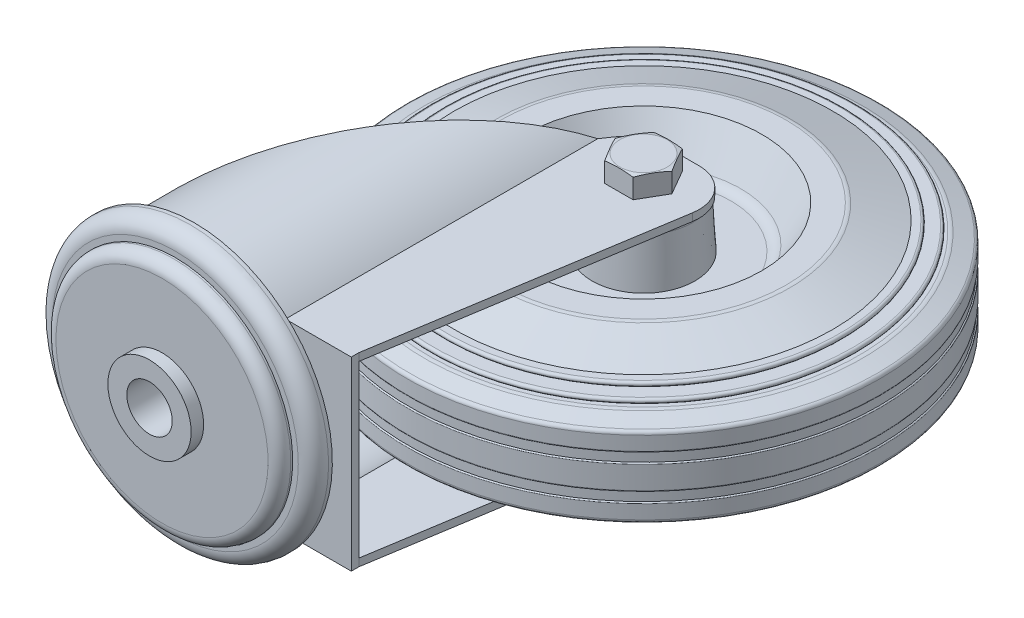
ISO-10303-21;
HEADER;
FILE_DESCRIPTION(('STEP AP214'),'2;1');
FILE_NAME('part.step','',(''),(''),'','','');
FILE_SCHEMA(('AUTOMOTIVE_DESIGN { 1 0 10303 214 1 1 1 1 }'));
ENDSEC;
DATA;
#1=APPLICATION_CONTEXT('core data for automotive mechanical design processes');
#2=APPLICATION_PROTOCOL_DEFINITION('international standard','automotive_design',2000,#1);
#3=PRODUCT_CONTEXT('',#1,'mechanical');
#4=PRODUCT('Part','Part','',(#3));
#5=PRODUCT_RELATED_PRODUCT_CATEGORY('part','',(#4));
#6=PRODUCT_DEFINITION_FORMATION('','',#4);
#7=PRODUCT_DEFINITION_CONTEXT('part definition',#1,'design');
#8=PRODUCT_DEFINITION('design','',#6,#7);
#9=PRODUCT_DEFINITION_SHAPE('','',#8);
#10=(LENGTH_UNIT() NAMED_UNIT(*) SI_UNIT(.MILLI.,.METRE.));
#11=(NAMED_UNIT(*) PLANE_ANGLE_UNIT() SI_UNIT($,.RADIAN.));
#12=(NAMED_UNIT(*) SI_UNIT($,.STERADIAN.) SOLID_ANGLE_UNIT());
#13=UNCERTAINTY_MEASURE_WITH_UNIT(LENGTH_MEASURE(1.E-05),#10,'distance_accuracy_value','');
#14=(GEOMETRIC_REPRESENTATION_CONTEXT(3) GLOBAL_UNCERTAINTY_ASSIGNED_CONTEXT((#13)) GLOBAL_UNIT_ASSIGNED_CONTEXT((#10,
#11,#12)) REPRESENTATION_CONTEXT('',''));
#15=CARTESIAN_POINT('',(0.,0.,0.));
#16=DIRECTION('',(0.,0.,1.));
#17=DIRECTION('',(1.,0.,0.));
#18=AXIS2_PLACEMENT_3D('',#15,#16,#17);
#19=CARTESIAN_POINT('',(57.,24.5,-13.8));
#20=DIRECTION('',(0.,1.,0.));
#21=DIRECTION('',(-1.,0.,0.));
#22=AXIS2_PLACEMENT_3D('',#19,#20,#21);
#23=PLANE('',#22);
#24=CARTESIAN_POINT('',(32.3000000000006,24.5,-93.4999999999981));
#25=DIRECTION('',(0.,1.,0.));
#26=DIRECTION('',(-1.,0.,0.));
#27=AXIS2_PLACEMENT_3D('',#24,#25,#26);
#28=CIRCLE('',#27,10.0000000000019);
#29=CARTESIAN_POINT('',(32.3,24.5,-103.5));
#30=VERTEX_POINT('',#29);
#31=CARTESIAN_POINT('',(24.0478569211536,24.5,-99.1481974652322));
#32=VERTEX_POINT('',#31);
#33=EDGE_CURVE('E580',#30,#32,#28,.T.);
#34=ORIENTED_EDGE('',*,*,#33,.T.);
#35=DIRECTION('',(-0.564819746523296,0.,0.82521430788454));
#36=VECTOR('',#35,1.);
#37=CARTESIAN_POINT('',(-5.22027352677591,24.5,-56.3868029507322));
#38=LINE('',#37,#36);
#39=CARTESIAN_POINT('',(22.1076909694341,24.5,-96.3135715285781));
#40=VERTEX_POINT('',#39);
#41=EDGE_CURVE('E575',#32,#40,#38,.T.);
#42=ORIENTED_EDGE('',*,*,#41,.T.);
#43=DIRECTION('',(0.,0.,1.));
#44=VECTOR('',#43,1.);
#45=CARTESIAN_POINT('',(22.1076909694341,24.5,-103.5));
#46=LINE('',#45,#44);
#47=CARTESIAN_POINT('',(22.1076909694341,24.5,-13.8));
#48=VERTEX_POINT('',#47);
#49=EDGE_CURVE('E563',#48,#40,#46,.F.);
#50=ORIENTED_EDGE('',*,*,#49,.F.);
#51=DIRECTION('',(1.,0.,0.));
#52=VECTOR('',#51,1.);
#53=CARTESIAN_POINT('',(7.,24.5,-13.8));
#54=LINE('',#53,#52);
#55=CARTESIAN_POINT('',(39.5,24.5,-13.8));
#56=VERTEX_POINT('',#55);
#57=EDGE_CURVE('E569',#48,#56,#54,.T.);
#58=ORIENTED_EDGE('',*,*,#57,.T.);
#59=DIRECTION('',(0.,0.,-1.));
#60=VECTOR('',#59,1.);
#61=CARTESIAN_POINT('',(39.5,24.5,-13.8));
#62=LINE('',#61,#60);
#63=CARTESIAN_POINT('',(39.5,24.5,-15.8));
#64=VERTEX_POINT('',#63);
#65=EDGE_CURVE('E592',#56,#64,#62,.T.);
#66=ORIENTED_EDGE('',*,*,#65,.T.);
#67=DIRECTION('',(0.156664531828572,0.,-0.987651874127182));
#68=VECTOR('',#67,1.);
#69=CARTESIAN_POINT('',(39.6200560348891,24.5,-16.5568628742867));
#70=LINE('',#69,#68);
#71=CARTESIAN_POINT('',(51.576518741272,24.5,-91.9333546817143));
#72=VERTEX_POINT('',#71);
#73=EDGE_CURVE('E589',#64,#72,#70,.T.);
#74=ORIENTED_EDGE('',*,*,#73,.T.);
#75=CARTESIAN_POINT('',(41.7,24.5,-93.5));
#76=DIRECTION('',(0.,1.,0.));
#77=DIRECTION('',(-1.,0.,0.));
#78=AXIS2_PLACEMENT_3D('',#75,#76,#77);
#79=CIRCLE('',#78,10.);
#80=CARTESIAN_POINT('',(41.7,24.5,-103.5));
#81=VERTEX_POINT('',#80);
#82=EDGE_CURVE('E586',#72,#81,#79,.T.);
#83=ORIENTED_EDGE('',*,*,#82,.T.);
#84=DIRECTION('',(-1.,0.,0.));
#85=VECTOR('',#84,1.);
#86=CARTESIAN_POINT('',(57.,24.5,-103.5));
#87=LINE('',#86,#85);
#88=EDGE_CURVE('E583',#81,#30,#87,.T.);
#89=ORIENTED_EDGE('',*,*,#88,.T.);
#90=EDGE_LOOP('',(#34,#42,#50,#58,#66,#74,#83,#89));
#91=FACE_BOUND('',#90,.T.);
#92=DIRECTION('',(-0.5,0.,0.866025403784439));
#93=VECTOR('',#92,1.);
#94=CARTESIAN_POINT('',(40.7516651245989,24.5,-86.9980746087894));
#95=LINE('',#94,#93);
#96=CARTESIAN_POINT('',(44.5055534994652,24.5,-93.5));
#97=VERTEX_POINT('',#96);
#98=CARTESIAN_POINT('',(40.7527767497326,24.5,-87.));
#99=VERTEX_POINT('',#98);
#100=EDGE_CURVE('E1007',#97,#99,#95,.T.);
#101=ORIENTED_EDGE('',*,*,#100,.T.);
#102=DIRECTION('',(-1.,0.,0.));
#103=VECTOR('',#102,1.);
#104=CARTESIAN_POINT('',(29.49,24.5,-87.));
#105=LINE('',#104,#103);
#106=CARTESIAN_POINT('',(33.2472232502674,24.5,-87.));
#107=VERTEX_POINT('',#106);
#108=EDGE_CURVE('E25',#99,#107,#105,.T.);
#109=ORIENTED_EDGE('',*,*,#108,.T.);
#110=DIRECTION('',(-0.5,0.,-0.866025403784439));
#111=VECTOR('',#110,1.);
#112=CARTESIAN_POINT('',(29.4933348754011,24.5,-93.5019253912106));
#113=LINE('',#112,#111);
#114=CARTESIAN_POINT('',(29.4944465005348,24.5,-93.5));
#115=VERTEX_POINT('',#114);
#116=EDGE_CURVE('E33',#107,#115,#113,.T.);
#117=ORIENTED_EDGE('',*,*,#116,.T.);
#118=DIRECTION('',(0.5,0.,-0.866025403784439));
#119=VECTOR('',#118,1.);
#120=CARTESIAN_POINT('',(29.4933348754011,24.5,-93.4980746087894));
#121=LINE('',#120,#119);
#122=CARTESIAN_POINT('',(33.2472232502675,24.5,-100.));
#123=VERTEX_POINT('',#122);
#124=EDGE_CURVE('E203',#115,#123,#121,.T.);
#125=ORIENTED_EDGE('',*,*,#124,.T.);
#126=DIRECTION('',(1.,0.,0.));
#127=VECTOR('',#126,1.);
#128=CARTESIAN_POINT('',(29.49,24.5,-100.));
#129=LINE('',#128,#127);
#130=CARTESIAN_POINT('',(40.7527767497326,24.5,-100.));
#131=VERTEX_POINT('',#130);
#132=EDGE_CURVE('E205',#123,#131,#129,.T.);
#133=ORIENTED_EDGE('',*,*,#132,.T.);
#134=DIRECTION('',(0.5,0.,0.866025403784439));
#135=VECTOR('',#134,1.);
#136=CARTESIAN_POINT('',(40.7516651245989,24.5,-100.001925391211));
#137=LINE('',#136,#135);
#138=EDGE_CURVE('E219',#131,#97,#137,.T.);
#139=ORIENTED_EDGE('',*,*,#138,.T.);
#140=EDGE_LOOP('',(#101,#109,#117,#125,#133,#139));
#141=FACE_BOUND('',#140,.T.);
#142=ADVANCED_FACE('F15',(#91,#141),#23,.T.);
#143=CARTESIAN_POINT('',(12.,22.5,-15.8));
#144=DIRECTION('',(0.,-1.,0.));
#145=DIRECTION('',(1.,0.,0.));
#146=AXIS2_PLACEMENT_3D('',#143,#144,#145);
#147=PLANE('',#146);
#148=DIRECTION('',(1.,0.,0.));
#149=VECTOR('',#148,1.);
#150=CARTESIAN_POINT('',(12.,22.5,-15.8));
#151=LINE('',#150,#149);
#152=CARTESIAN_POINT('',(21.3248681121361,22.5,-15.8));
#153=VERTEX_POINT('',#152);
#154=CARTESIAN_POINT('',(39.5,22.5,-15.8));
#155=VERTEX_POINT('',#154);
#156=EDGE_CURVE('E656',#153,#155,#151,.T.);
#157=ORIENTED_EDGE('',*,*,#156,.F.);
#158=DIRECTION('',(0.,0.,1.));
#159=VECTOR('',#158,1.);
#160=CARTESIAN_POINT('',(21.3248681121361,22.5,-102.5));
#161=LINE('',#160,#159);
#162=CARTESIAN_POINT('',(21.3248681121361,22.5,-95.1698497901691));
#163=VERTEX_POINT('',#162);
#164=EDGE_CURVE('E529',#163,#153,#161,.T.);
#165=ORIENTED_EDGE('',*,*,#164,.F.);
#166=DIRECTION('',(-0.564819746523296,0.,0.82521430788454));
#167=VECTOR('',#166,1.);
#168=CARTESIAN_POINT('',(-33.,22.5,-15.8));
#169=LINE('',#168,#167);
#170=CARTESIAN_POINT('',(24.0478569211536,22.5,-99.1481974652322));
#171=VERTEX_POINT('',#170);
#172=EDGE_CURVE('E635',#171,#163,#169,.T.);
#173=ORIENTED_EDGE('',*,*,#172,.F.);
#174=CARTESIAN_POINT('',(32.3000000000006,22.5,-93.4999999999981));
#175=DIRECTION('',(0.,-1.,0.));
#176=DIRECTION('',(1.,0.,0.));
#177=AXIS2_PLACEMENT_3D('',#174,#175,#176);
#178=CIRCLE('',#177,10.0000000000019);
#179=CARTESIAN_POINT('',(32.3,22.5,-103.5));
#180=VERTEX_POINT('',#179);
#181=EDGE_CURVE('E632',#180,#171,#178,.F.);
#182=ORIENTED_EDGE('',*,*,#181,.F.);
#183=DIRECTION('',(-1.,0.,0.));
#184=VECTOR('',#183,1.);
#185=CARTESIAN_POINT('',(32.3,22.5,-103.5));
#186=LINE('',#185,#184);
#187=CARTESIAN_POINT('',(41.7,22.5,-103.5));
#188=VERTEX_POINT('',#187);
#189=EDGE_CURVE('E629',#188,#180,#186,.T.);
#190=ORIENTED_EDGE('',*,*,#189,.F.);
#191=CARTESIAN_POINT('',(41.7,22.5,-93.5));
#192=DIRECTION('',(0.,-1.,0.));
#193=DIRECTION('',(1.,0.,0.));
#194=AXIS2_PLACEMENT_3D('',#191,#192,#193);
#195=CIRCLE('',#194,10.);
#196=CARTESIAN_POINT('',(51.576518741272,22.5,-91.9333546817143));
#197=VERTEX_POINT('',#196);
#198=EDGE_CURVE('E626',#197,#188,#195,.F.);
#199=ORIENTED_EDGE('',*,*,#198,.F.);
#200=DIRECTION('',(0.156664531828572,0.,-0.987651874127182));
#201=VECTOR('',#200,1.);
#202=CARTESIAN_POINT('',(51.576518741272,22.5,-91.9333546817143));
#203=LINE('',#202,#201);
#204=EDGE_CURVE('E623',#155,#197,#203,.T.);
#205=ORIENTED_EDGE('',*,*,#204,.F.);
#206=EDGE_LOOP('',(#157,#165,#173,#182,#190,#199,#205));
#207=FACE_BOUND('',#206,.T.);
#208=CARTESIAN_POINT('',(37.,22.5,-93.5));
#209=DIRECTION('',(0.,-1.,0.));
#210=DIRECTION('',(1.,0.,0.));
#211=AXIS2_PLACEMENT_3D('',#208,#209,#210);
#212=CIRCLE('',#211,7.5);
#213=CARTESIAN_POINT('',(44.5,22.5,-93.5));
#214=VERTEX_POINT('',#213);
#215=EDGE_CURVE('E522',#214,#214,#212,.F.);
#216=ORIENTED_EDGE('',*,*,#215,.T.);
#217=EDGE_LOOP('',(#216));
#218=FACE_BOUND('',#217,.T.);
#219=ADVANCED_FACE('F846',(#207,#218),#147,.T.);
#220=CARTESIAN_POINT('',(0.,0.,-13.));
#221=DIRECTION('',(0.,0.,-1.));
#222=DIRECTION('',(0.,-1.,0.));
#223=AXIS2_PLACEMENT_3D('',#220,#221,#222);
#224=PLANE('',#223);
#225=CARTESIAN_POINT('',(0.,0.,-13.));
#226=DIRECTION('',(0.,0.,1.));
#227=DIRECTION('',(0.,1.,0.));
#228=AXIS2_PLACEMENT_3D('',#225,#226,#227);
#229=CIRCLE('',#228,31.);
#230=CARTESIAN_POINT('',(0.,31.,-13.));
#231=VERTEX_POINT('',#230);
#232=EDGE_CURVE('E620',#231,#231,#229,.T.);
#233=ORIENTED_EDGE('',*,*,#232,.F.);
#234=EDGE_LOOP('',(#233));
#235=FACE_BOUND('',#234,.T.);
#236=CARTESIAN_POINT('',(0.,0.,-13.));
#237=DIRECTION('',(0.,0.,-1.));
#238=DIRECTION('',(0.,-1.,0.));
#239=AXIS2_PLACEMENT_3D('',#236,#237,#238);
#240=CIRCLE('',#239,6.);
#241=CARTESIAN_POINT('',(0.,-6.,-13.));
#242=VERTEX_POINT('',#241);
#243=EDGE_CURVE('E683',#242,#242,#240,.F.);
#244=ORIENTED_EDGE('',*,*,#243,.T.);
#245=EDGE_LOOP('',(#244));
#246=FACE_BOUND('',#245,.T.);
#247=ADVANCED_FACE('F1803',(#235,#246),#224,.T.);
#248=CARTESIAN_POINT('',(0.,0.,0.));
#249=DIRECTION('',(0.,0.,-1.));
#250=DIRECTION('',(0.,-1.,0.));
#251=AXIS2_PLACEMENT_3D('',#248,#249,#250);
#252=PLANE('',#251);
#253=CARTESIAN_POINT('',(0.,0.,0.));
#254=DIRECTION('',(0.,0.,1.));
#255=DIRECTION('',(1.,0.,0.));
#256=AXIS2_PLACEMENT_3D('',#253,#254,#255);
#257=CIRCLE('',#256,11.);
#258=CARTESIAN_POINT('',(11.,0.,0.));
#259=VERTEX_POINT('',#258);
#260=EDGE_CURVE('E690',#259,#259,#257,.T.);
#261=ORIENTED_EDGE('',*,*,#260,.T.);
#262=EDGE_LOOP('',(#261));
#263=FACE_BOUND('',#262,.T.);
#264=CARTESIAN_POINT('',(0.,0.,0.));
#265=DIRECTION('',(0.,0.,1.));
#266=DIRECTION('',(0.,1.,0.));
#267=AXIS2_PLACEMENT_3D('',#264,#265,#266);
#268=CIRCLE('',#267,6.);
#269=CARTESIAN_POINT('',(0.,6.,0.));
#270=VERTEX_POINT('',#269);
#271=EDGE_CURVE('E686',#270,#270,#268,.T.);
#272=ORIENTED_EDGE('',*,*,#271,.F.);
#273=EDGE_LOOP('',(#272));
#274=FACE_BOUND('',#273,.T.);
#275=ADVANCED_FACE('F1795',(#263,#274),#252,.F.);
#276=CARTESIAN_POINT('',(0.,0.,-103.5));
#277=DIRECTION('',(0.,0.,1.));
#278=DIRECTION('',(0.,1.,0.));
#279=AXIS2_PLACEMENT_3D('',#276,#277,#278);
#280=CYLINDRICAL_SURFACE('',#279,33.);
#281=CARTESIAN_POINT('',(0.,0.,-64.0137395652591));
#282=DIRECTION('',(-0.82521430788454,0.,-0.564819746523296));
#283=DIRECTION('',(-0.564819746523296,0.,0.82521430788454));
#284=AXIS2_PLACEMENT_3D('',#281,#282,#283);
#285=ELLIPSE('',#284,58.4257193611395,33.);
#286=CARTESIAN_POINT('',(22.1076909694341,-24.5,-96.3135715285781));
#287=VERTEX_POINT('',#286);
#288=EDGE_CURVE('E578',#287,#40,#285,.T.);
#289=ORIENTED_EDGE('',*,*,#288,.F.);
#290=DIRECTION('',(0.,0.,1.));
#291=VECTOR('',#290,1.);
#292=CARTESIAN_POINT('',(22.1076909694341,-24.5,-103.5));
#293=LINE('',#292,#291);
#294=CARTESIAN_POINT('',(22.1076909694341,-24.5,-13.8));
#295=VERTEX_POINT('',#294);
#296=EDGE_CURVE('E566',#295,#287,#293,.F.);
#297=ORIENTED_EDGE('',*,*,#296,.F.);
#298=CARTESIAN_POINT('',(0.,0.,-13.8));
#299=DIRECTION('',(0.,0.,-1.));
#300=DIRECTION('',(0.,-1.,0.));
#301=AXIS2_PLACEMENT_3D('',#298,#299,#300);
#302=CIRCLE('',#301,33.);
#303=EDGE_CURVE('E560',#48,#295,#302,.T.);
#304=ORIENTED_EDGE('',*,*,#303,.F.);
#305=ORIENTED_EDGE('',*,*,#49,.T.);
#306=EDGE_LOOP('',(#289,#297,#304,#305));
#307=FACE_BOUND('',#306,.T.);
#308=CARTESIAN_POINT('',(0.,0.,-11.8));
#309=DIRECTION('',(0.,0.,1.));
#310=DIRECTION('',(0.,1.,0.));
#311=AXIS2_PLACEMENT_3D('',#308,#309,#310);
#312=CIRCLE('',#311,33.);
#313=CARTESIAN_POINT('',(0.,33.,-11.8));
#314=VERTEX_POINT('',#313);
#315=EDGE_CURVE('E523',#314,#314,#312,.T.);
#316=ORIENTED_EDGE('',*,*,#315,.F.);
#317=EDGE_LOOP('',(#316));
#318=FACE_BOUND('',#317,.T.);
#319=ADVANCED_FACE('F349',(#307,#318),#280,.T.);
#320=CARTESIAN_POINT('',(57.,-24.5,-13.8));
#321=DIRECTION('',(0.,1.,0.));
#322=DIRECTION('',(-1.,0.,0.));
#323=AXIS2_PLACEMENT_3D('',#320,#321,#322);
#324=PLANE('',#323);
#325=CARTESIAN_POINT('',(37.,-24.5,-93.5));
#326=DIRECTION('',(0.,1.,0.));
#327=DIRECTION('',(0.,0.,-1.));
#328=AXIS2_PLACEMENT_3D('',#325,#326,#327);
#329=CIRCLE('',#328,6.2583333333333);
#330=CARTESIAN_POINT('',(37.,-24.5,-99.7583333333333));
#331=VERTEX_POINT('',#330);
#332=EDGE_CURVE('E526',#331,#331,#329,.T.);
#333=ORIENTED_EDGE('',*,*,#332,.T.);
#334=EDGE_LOOP('',(#333));
#335=FACE_BOUND('',#334,.T.);
#336=DIRECTION('',(-0.564819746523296,0.,0.82521430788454));
#337=VECTOR('',#336,1.);
#338=CARTESIAN_POINT('',(-5.22027352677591,-24.5,-56.3868029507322));
#339=LINE('',#338,#337);
#340=CARTESIAN_POINT('',(24.0478569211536,-24.5,-99.1481974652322));
#341=VERTEX_POINT('',#340);
#342=EDGE_CURVE('E542',#341,#287,#339,.T.);
#343=ORIENTED_EDGE('',*,*,#342,.F.);
#344=CARTESIAN_POINT('',(32.3000000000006,-24.5,-93.4999999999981));
#345=DIRECTION('',(0.,1.,0.));
#346=DIRECTION('',(-1.,0.,0.));
#347=AXIS2_PLACEMENT_3D('',#344,#345,#346);
#348=CIRCLE('',#347,10.0000000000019);
#349=CARTESIAN_POINT('',(32.3,-24.5,-103.5));
#350=VERTEX_POINT('',#349);
#351=EDGE_CURVE('E545',#350,#341,#348,.T.);
#352=ORIENTED_EDGE('',*,*,#351,.F.);
#353=DIRECTION('',(-1.,0.,0.));
#354=VECTOR('',#353,1.);
#355=CARTESIAN_POINT('',(57.,-24.5,-103.5));
#356=LINE('',#355,#354);
#357=CARTESIAN_POINT('',(41.7,-24.5,-103.5));
#358=VERTEX_POINT('',#357);
#359=EDGE_CURVE('E548',#358,#350,#356,.T.);
#360=ORIENTED_EDGE('',*,*,#359,.F.);
#361=CARTESIAN_POINT('',(41.7,-24.5,-93.5));
#362=DIRECTION('',(0.,1.,0.));
#363=DIRECTION('',(-1.,0.,0.));
#364=AXIS2_PLACEMENT_3D('',#361,#362,#363);
#365=CIRCLE('',#364,10.);
#366=CARTESIAN_POINT('',(51.576518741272,-24.5,-91.9333546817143));
#367=VERTEX_POINT('',#366);
#368=EDGE_CURVE('E551',#367,#358,#365,.T.);
#369=ORIENTED_EDGE('',*,*,#368,.F.);
#370=DIRECTION('',(0.156664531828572,0.,-0.987651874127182));
#371=VECTOR('',#370,1.);
#372=CARTESIAN_POINT('',(39.6200560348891,-24.5,-16.5568628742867));
#373=LINE('',#372,#371);
#374=CARTESIAN_POINT('',(39.5,-24.5,-15.8));
#375=VERTEX_POINT('',#374);
#376=EDGE_CURVE('E554',#375,#367,#373,.T.);
#377=ORIENTED_EDGE('',*,*,#376,.F.);
#378=DIRECTION('',(0.,0.,-1.));
#379=VECTOR('',#378,1.);
#380=CARTESIAN_POINT('',(39.5,-24.5,-13.8));
#381=LINE('',#380,#379);
#382=CARTESIAN_POINT('',(39.5,-24.5,-13.8));
#383=VERTEX_POINT('',#382);
#384=EDGE_CURVE('E557',#383,#375,#381,.T.);
#385=ORIENTED_EDGE('',*,*,#384,.F.);
#386=DIRECTION('',(1.,0.,0.));
#387=VECTOR('',#386,1.);
#388=CARTESIAN_POINT('',(7.,-24.5,-13.8));
#389=LINE('',#388,#387);
#390=EDGE_CURVE('E572',#295,#383,#389,.T.);
#391=ORIENTED_EDGE('',*,*,#390,.F.);
#392=ORIENTED_EDGE('',*,*,#296,.T.);
#393=EDGE_LOOP('',(#343,#352,#360,#369,#377,#385,#391,#392));
#394=FACE_BOUND('',#393,.T.);
#395=ADVANCED_FACE('F1778',(#335,#394),#324,.F.);
#396=CARTESIAN_POINT('',(12.,-22.5,-118.5));
#397=DIRECTION('',(0.,1.,0.));
#398=DIRECTION('',(0.,0.,-1.));
#399=AXIS2_PLACEMENT_3D('',#396,#397,#398);
#400=PLANE('',#399);
#401=CARTESIAN_POINT('',(37.,-22.5,-93.5));
#402=DIRECTION('',(0.,1.,0.));
#403=DIRECTION('',(0.,0.,-1.));
#404=AXIS2_PLACEMENT_3D('',#401,#402,#403);
#405=CIRCLE('',#404,7.5);
#406=CARTESIAN_POINT('',(37.,-22.5,-101.));
#407=VERTEX_POINT('',#406);
#408=EDGE_CURVE('E519',#407,#407,#405,.T.);
#409=ORIENTED_EDGE('',*,*,#408,.F.);
#410=EDGE_LOOP('',(#409));
#411=FACE_BOUND('',#410,.T.);
#412=CARTESIAN_POINT('',(41.7,-22.5,-93.5));
#413=DIRECTION('',(0.,1.,0.));
#414=DIRECTION('',(0.,0.,-1.));
#415=AXIS2_PLACEMENT_3D('',#412,#413,#414);
#416=CIRCLE('',#415,10.);
#417=CARTESIAN_POINT('',(41.7,-22.5,-103.5));
#418=VERTEX_POINT('',#417);
#419=CARTESIAN_POINT('',(51.576518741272,-22.5,-91.9333546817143));
#420=VERTEX_POINT('',#419);
#421=EDGE_CURVE('E641',#418,#420,#416,.F.);
#422=ORIENTED_EDGE('',*,*,#421,.F.);
#423=DIRECTION('',(1.,0.,0.));
#424=VECTOR('',#423,1.);
#425=CARTESIAN_POINT('',(32.3,-22.5,-103.5));
#426=LINE('',#425,#424);
#427=CARTESIAN_POINT('',(32.3000000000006,-22.5,-103.5));
#428=VERTEX_POINT('',#427);
#429=EDGE_CURVE('E644',#428,#418,#426,.T.);
#430=ORIENTED_EDGE('',*,*,#429,.F.);
#431=CARTESIAN_POINT('',(32.3000000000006,-22.5,-93.4999999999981));
#432=DIRECTION('',(0.,1.,0.));
#433=DIRECTION('',(0.,0.,-1.));
#434=AXIS2_PLACEMENT_3D('',#431,#432,#433);
#435=CIRCLE('',#434,10.0000000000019);
#436=CARTESIAN_POINT('',(24.0478569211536,-22.5,-99.1481974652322));
#437=VERTEX_POINT('',#436);
#438=EDGE_CURVE('E647',#437,#428,#435,.F.);
#439=ORIENTED_EDGE('',*,*,#438,.F.);
#440=DIRECTION('',(0.564819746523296,0.,-0.82521430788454));
#441=VECTOR('',#440,1.);
#442=CARTESIAN_POINT('',(-33.,-22.5,-15.8));
#443=LINE('',#442,#441);
#444=CARTESIAN_POINT('',(21.3248681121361,-22.5,-95.1698497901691));
#445=VERTEX_POINT('',#444);
#446=EDGE_CURVE('E650',#445,#437,#443,.T.);
#447=ORIENTED_EDGE('',*,*,#446,.F.);
#448=DIRECTION('',(0.,0.,1.));
#449=VECTOR('',#448,1.);
#450=CARTESIAN_POINT('',(21.3248681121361,-22.5,-102.5));
#451=LINE('',#450,#449);
#452=CARTESIAN_POINT('',(21.3248681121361,-22.5,-15.8));
#453=VERTEX_POINT('',#452);
#454=EDGE_CURVE('E536',#453,#445,#451,.F.);
#455=ORIENTED_EDGE('',*,*,#454,.F.);
#456=DIRECTION('',(1.,0.,0.));
#457=VECTOR('',#456,1.);
#458=CARTESIAN_POINT('',(12.,-22.5,-15.8));
#459=LINE('',#458,#457);
#460=CARTESIAN_POINT('',(39.5,-22.5,-15.8));
#461=VERTEX_POINT('',#460);
#462=EDGE_CURVE('E654',#453,#461,#459,.T.);
#463=ORIENTED_EDGE('',*,*,#462,.T.);
#464=DIRECTION('',(-0.156664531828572,0.,0.987651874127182));
#465=VECTOR('',#464,1.);
#466=CARTESIAN_POINT('',(51.576518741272,-22.5,-91.9333546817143));
#467=LINE('',#466,#465);
#468=EDGE_CURVE('E638',#420,#461,#467,.T.);
#469=ORIENTED_EDGE('',*,*,#468,.F.);
#470=EDGE_LOOP('',(#422,#430,#439,#447,#455,#463,#469));
#471=FACE_BOUND('',#470,.T.);
#472=ADVANCED_FACE('F1769',(#411,#471),#400,.T.);
#473=CARTESIAN_POINT('',(-33.,125.,-15.8));
#474=DIRECTION('',(-0.82521430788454,0.,-0.564819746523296));
#475=DIRECTION('',(-0.564819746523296,0.,0.82521430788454));
#476=AXIS2_PLACEMENT_3D('',#473,#474,#475);
#477=PLANE('',#476);
#478=DIRECTION('',(0.,-1.,0.));
#479=VECTOR('',#478,1.);
#480=CARTESIAN_POINT('',(24.0478569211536,125.,-99.1481974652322));
#481=LINE('',#480,#479);
#482=EDGE_CURVE('E597',#32,#171,#481,.T.);
#483=ORIENTED_EDGE('',*,*,#482,.T.);
#484=ORIENTED_EDGE('',*,*,#172,.T.);
#485=CARTESIAN_POINT('',(0.,0.,-64.0137395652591));
#486=DIRECTION('',(-0.82521430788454,0.,-0.564819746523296));
#487=DIRECTION('',(-0.564819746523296,0.,0.82521430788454));
#488=AXIS2_PLACEMENT_3D('',#485,#486,#487);
#489=ELLIPSE('',#488,54.8847666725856,31.);
#490=EDGE_CURVE('E617',#163,#445,#489,.F.);
#491=ORIENTED_EDGE('',*,*,#490,.T.);
#492=ORIENTED_EDGE('',*,*,#446,.T.);
#493=EDGE_CURVE('E600',#437,#341,#481,.T.);
#494=ORIENTED_EDGE('',*,*,#493,.T.);
#495=ORIENTED_EDGE('',*,*,#342,.T.);
#496=ORIENTED_EDGE('',*,*,#288,.T.);
#497=ORIENTED_EDGE('',*,*,#41,.F.);
#498=EDGE_LOOP('',(#483,#484,#491,#492,#494,#495,#496,#497));
#499=FACE_BOUND('',#498,.T.);
#500=ADVANCED_FACE('F1760',(#499),#477,.T.);
#501=CARTESIAN_POINT('',(32.3000000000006,125.,-93.4999999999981));
#502=DIRECTION('',(0.,-1.,0.));
#503=DIRECTION('',(1.,0.,0.));
#504=AXIS2_PLACEMENT_3D('',#501,#502,#503);
#505=CYLINDRICAL_SURFACE('',#504,10.0000000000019);
#506=DIRECTION('',(0.,-1.,0.));
#507=VECTOR('',#506,1.);
#508=CARTESIAN_POINT('',(32.3,125.,-103.5));
#509=LINE('',#508,#507);
#510=EDGE_CURVE('E601',#30,#180,#509,.T.);
#511=ORIENTED_EDGE('',*,*,#510,.T.);
#512=ORIENTED_EDGE('',*,*,#181,.T.);
#513=ORIENTED_EDGE('',*,*,#482,.F.);
#514=ORIENTED_EDGE('',*,*,#33,.F.);
#515=EDGE_LOOP('',(#511,#512,#513,#514));
#516=FACE_BOUND('',#515,.T.);
#517=ADVANCED_FACE('F1751',(#516),#505,.T.);
#518=ORIENTED_EDGE('',*,*,#493,.F.);
#519=ORIENTED_EDGE('',*,*,#438,.T.);
#520=EDGE_CURVE('E604',#428,#350,#509,.T.);
#521=ORIENTED_EDGE('',*,*,#520,.T.);
#522=ORIENTED_EDGE('',*,*,#351,.T.);
#523=EDGE_LOOP('',(#518,#519,#521,#522));
#524=FACE_BOUND('',#523,.T.);
#525=ADVANCED_FACE('F1742',(#524),#505,.T.);
#526=CARTESIAN_POINT('',(32.3,125.,-103.5));
#527=DIRECTION('',(0.,0.,-1.));
#528=DIRECTION('',(0.,-1.,0.));
#529=AXIS2_PLACEMENT_3D('',#526,#527,#528);
#530=PLANE('',#529);
#531=DIRECTION('',(0.,-1.,0.));
#532=VECTOR('',#531,1.);
#533=CARTESIAN_POINT('',(41.7,125.,-103.5));
#534=LINE('',#533,#532);
#535=EDGE_CURVE('E605',#81,#188,#534,.T.);
#536=ORIENTED_EDGE('',*,*,#535,.T.);
#537=ORIENTED_EDGE('',*,*,#189,.T.);
#538=ORIENTED_EDGE('',*,*,#510,.F.);
#539=ORIENTED_EDGE('',*,*,#88,.F.);
#540=EDGE_LOOP('',(#536,#537,#538,#539));
#541=FACE_BOUND('',#540,.T.);
#542=ADVANCED_FACE('F1732',(#541),#530,.T.);
#543=ORIENTED_EDGE('',*,*,#520,.F.);
#544=ORIENTED_EDGE('',*,*,#429,.T.);
#545=EDGE_CURVE('E608',#418,#358,#534,.T.);
#546=ORIENTED_EDGE('',*,*,#545,.T.);
#547=ORIENTED_EDGE('',*,*,#359,.T.);
#548=EDGE_LOOP('',(#543,#544,#546,#547));
#549=FACE_BOUND('',#548,.T.);
#550=ADVANCED_FACE('F1723',(#549),#530,.T.);
#551=CARTESIAN_POINT('',(41.7,125.,-93.5));
#552=DIRECTION('',(0.,-1.,0.));
#553=DIRECTION('',(1.,0.,0.));
#554=AXIS2_PLACEMENT_3D('',#551,#552,#553);
#555=CYLINDRICAL_SURFACE('',#554,10.);
#556=DIRECTION('',(0.,-1.,0.));
#557=VECTOR('',#556,1.);
#558=CARTESIAN_POINT('',(51.576518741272,125.,-91.9333546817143));
#559=LINE('',#558,#557);
#560=EDGE_CURVE('E609',#72,#197,#559,.T.);
#561=ORIENTED_EDGE('',*,*,#560,.T.);
#562=ORIENTED_EDGE('',*,*,#198,.T.);
#563=ORIENTED_EDGE('',*,*,#535,.F.);
#564=ORIENTED_EDGE('',*,*,#82,.F.);
#565=EDGE_LOOP('',(#561,#562,#563,#564));
#566=FACE_BOUND('',#565,.T.);
#567=ADVANCED_FACE('F1713',(#566),#555,.T.);
#568=ORIENTED_EDGE('',*,*,#545,.F.);
#569=ORIENTED_EDGE('',*,*,#421,.T.);
#570=EDGE_CURVE('E612',#420,#367,#559,.T.);
#571=ORIENTED_EDGE('',*,*,#570,.T.);
#572=ORIENTED_EDGE('',*,*,#368,.T.);
#573=EDGE_LOOP('',(#568,#569,#571,#572));
#574=FACE_BOUND('',#573,.T.);
#575=ADVANCED_FACE('F1704',(#574),#555,.T.);
#576=CARTESIAN_POINT('',(51.576518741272,125.,-91.9333546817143));
#577=DIRECTION('',(0.987651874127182,0.,0.156664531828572));
#578=DIRECTION('',(0.156664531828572,0.,-0.987651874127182));
#579=AXIS2_PLACEMENT_3D('',#576,#577,#578);
#580=PLANE('',#579);
#581=DIRECTION('',(0.,-1.,0.));
#582=VECTOR('',#581,1.);
#583=CARTESIAN_POINT('',(39.5,125.,-15.8));
#584=LINE('',#583,#582);
#585=EDGE_CURVE('E613',#64,#155,#584,.T.);
#586=ORIENTED_EDGE('',*,*,#585,.T.);
#587=ORIENTED_EDGE('',*,*,#204,.T.);
#588=ORIENTED_EDGE('',*,*,#560,.F.);
#589=ORIENTED_EDGE('',*,*,#73,.F.);
#590=EDGE_LOOP('',(#586,#587,#588,#589));
#591=FACE_BOUND('',#590,.T.);
#592=ADVANCED_FACE('F1694',(#591),#580,.T.);
#593=ORIENTED_EDGE('',*,*,#570,.F.);
#594=ORIENTED_EDGE('',*,*,#468,.T.);
#595=EDGE_CURVE('E616',#461,#375,#584,.T.);
#596=ORIENTED_EDGE('',*,*,#595,.T.);
#597=ORIENTED_EDGE('',*,*,#376,.T.);
#598=EDGE_LOOP('',(#593,#594,#596,#597));
#599=FACE_BOUND('',#598,.T.);
#600=ADVANCED_FACE('F1685',(#599),#580,.T.);
#601=CARTESIAN_POINT('',(0.,0.,-102.5));
#602=DIRECTION('',(0.,0.,1.));
#603=DIRECTION('',(0.,1.,0.));
#604=AXIS2_PLACEMENT_3D('',#601,#602,#603);
#605=CYLINDRICAL_SURFACE('',#604,31.);
#606=ORIENTED_EDGE('',*,*,#232,.T.);
#607=EDGE_LOOP('',(#606));
#608=FACE_BOUND('',#607,.T.);
#609=ORIENTED_EDGE('',*,*,#490,.F.);
#610=ORIENTED_EDGE('',*,*,#164,.T.);
#611=CARTESIAN_POINT('',(0.,0.,-15.8));
#612=DIRECTION('',(0.,0.,-1.));
#613=DIRECTION('',(0.,-1.,0.));
#614=AXIS2_PLACEMENT_3D('',#611,#612,#613);
#615=CIRCLE('',#614,31.);
#616=EDGE_CURVE('E539',#153,#453,#615,.T.);
#617=ORIENTED_EDGE('',*,*,#616,.T.);
#618=ORIENTED_EDGE('',*,*,#454,.T.);
#619=EDGE_LOOP('',(#609,#610,#617,#618));
#620=FACE_BOUND('',#619,.T.);
#621=ADVANCED_FACE('F1675',(#608,#620),#605,.F.);
#622=CARTESIAN_POINT('',(7.,24.5,-13.8));
#623=DIRECTION('',(0.,0.,-1.));
#624=DIRECTION('',(0.,-1.,0.));
#625=AXIS2_PLACEMENT_3D('',#622,#623,#624);
#626=PLANE('',#625);
#627=DIRECTION('',(0.,-1.,0.));
#628=VECTOR('',#627,1.);
#629=CARTESIAN_POINT('',(39.5,24.5,-13.8));
#630=LINE('',#629,#628);
#631=EDGE_CURVE('E595',#56,#383,#630,.T.);
#632=ORIENTED_EDGE('',*,*,#631,.F.);
#633=ORIENTED_EDGE('',*,*,#57,.F.);
#634=ORIENTED_EDGE('',*,*,#303,.T.);
#635=ORIENTED_EDGE('',*,*,#390,.T.);
#636=EDGE_LOOP('',(#632,#633,#634,#635));
#637=FACE_BOUND('',#636,.T.);
#638=ADVANCED_FACE('F1663',(#637),#626,.F.);
#639=CARTESIAN_POINT('',(39.5,125.,-15.8));
#640=DIRECTION('',(1.,0.,0.));
#641=DIRECTION('',(0.,1.,0.));
#642=AXIS2_PLACEMENT_3D('',#639,#640,#641);
#643=PLANE('',#642);
#644=ORIENTED_EDGE('',*,*,#631,.T.);
#645=ORIENTED_EDGE('',*,*,#384,.T.);
#646=ORIENTED_EDGE('',*,*,#595,.F.);
#647=DIRECTION('',(0.,1.,0.));
#648=VECTOR('',#647,1.);
#649=CARTESIAN_POINT('',(39.5,125.,-15.8));
#650=LINE('',#649,#648);
#651=EDGE_CURVE('E104',#461,#155,#650,.T.);
#652=ORIENTED_EDGE('',*,*,#651,.T.);
#653=ORIENTED_EDGE('',*,*,#585,.F.);
#654=ORIENTED_EDGE('',*,*,#65,.F.);
#655=EDGE_LOOP('',(#644,#645,#646,#652,#653,#654));
#656=FACE_BOUND('',#655,.T.);
#657=ADVANCED_FACE('F1653',(#656),#643,.T.);
#658=CARTESIAN_POINT('',(12.,-22.5,-15.8));
#659=DIRECTION('',(0.,0.,-1.));
#660=DIRECTION('',(0.,-1.,0.));
#661=AXIS2_PLACEMENT_3D('',#658,#659,#660);
#662=PLANE('',#661);
#663=ORIENTED_EDGE('',*,*,#462,.F.);
#664=ORIENTED_EDGE('',*,*,#616,.F.);
#665=ORIENTED_EDGE('',*,*,#156,.T.);
#666=ORIENTED_EDGE('',*,*,#651,.F.);
#667=EDGE_LOOP('',(#663,#664,#665,#666));
#668=FACE_BOUND('',#667,.T.);
#669=ADVANCED_FACE('F1643',(#668),#662,.T.);
#670=CARTESIAN_POINT('',(-36.5,0.,-11.8));
#671=DIRECTION('',(0.,0.,1.));
#672=DIRECTION('',(0.,1.,0.));
#673=AXIS2_PLACEMENT_3D('',#670,#671,#672);
#674=PLANE('',#673);
#675=CARTESIAN_POINT('',(0.,0.,-11.8));
#676=DIRECTION('',(0.,0.,1.));
#677=DIRECTION('',(0.,1.,0.));
#678=AXIS2_PLACEMENT_3D('',#675,#676,#677);
#679=CIRCLE('',#678,36.5);
#680=CARTESIAN_POINT('',(0.,36.5,-11.8));
#681=VERTEX_POINT('',#680);
#682=EDGE_CURVE('E680',#681,#681,#679,.T.);
#683=ORIENTED_EDGE('',*,*,#682,.F.);
#684=EDGE_LOOP('',(#683));
#685=FACE_BOUND('',#684,.T.);
#686=ORIENTED_EDGE('',*,*,#315,.T.);
#687=EDGE_LOOP('',(#686));
#688=FACE_BOUND('',#687,.T.);
#689=ADVANCED_FACE('F1633',(#685,#688),#674,.F.);
#690=CARTESIAN_POINT('',(-9.125,0.,-3.3));
#691=DIRECTION('',(0.,0.,-1.));
#692=DIRECTION('',(0.,-1.,0.));
#693=AXIS2_PLACEMENT_3D('',#690,#691,#692);
#694=PLANE('',#693);
#695=CARTESIAN_POINT('',(0.,0.,-3.3));
#696=DIRECTION('',(0.,0.,-1.));
#697=DIRECTION('',(-1.,0.,0.));
#698=AXIS2_PLACEMENT_3D('',#695,#696,#697);
#699=CIRCLE('',#698,11.);
#700=CARTESIAN_POINT('',(-11.,0.,-3.3));
#701=VERTEX_POINT('',#700);
#702=EDGE_CURVE('E9',#701,#701,#699,.F.);
#703=ORIENTED_EDGE('',*,*,#702,.F.);
#704=EDGE_LOOP('',(#703));
#705=FACE_BOUND('',#704,.T.);
#706=CARTESIAN_POINT('',(0.,0.,-3.3));
#707=DIRECTION('',(0.,0.,1.));
#708=DIRECTION('',(0.,1.,0.));
#709=AXIS2_PLACEMENT_3D('',#706,#707,#708);
#710=CIRCLE('',#709,28.025);
#711=CARTESIAN_POINT('',(0.,28.025,-3.3));
#712=VERTEX_POINT('',#711);
#713=EDGE_CURVE('E533',#712,#712,#710,.T.);
#714=ORIENTED_EDGE('',*,*,#713,.T.);
#715=EDGE_LOOP('',(#714));
#716=FACE_BOUND('',#715,.T.);
#717=ADVANCED_FACE('F1623',(#705,#716),#694,.F.);
#718=CARTESIAN_POINT('',(0.,0.,-6.29999999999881));
#719=DIRECTION('',(0.,0.,1.));
#720=DIRECTION('',(0.,1.,0.));
#721=AXIS2_PLACEMENT_3D('',#718,#719,#720);
#722=TOROIDAL_SURFACE('',#721,28.0250000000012,2.99999999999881);
#723=ORIENTED_EDGE('',*,*,#713,.F.);
#724=EDGE_LOOP('',(#723));
#725=FACE_BOUND('',#724,.T.);
#726=CARTESIAN_POINT('',(0.,0.,-6.3));
#727=DIRECTION('',(0.,0.,1.));
#728=DIRECTION('',(0.,1.,0.));
#729=AXIS2_PLACEMENT_3D('',#726,#727,#728);
#730=CIRCLE('',#729,31.025);
#731=CARTESIAN_POINT('',(0.,31.025,-6.3));
#732=VERTEX_POINT('',#731);
#733=EDGE_CURVE('E668',#732,#732,#730,.T.);
#734=ORIENTED_EDGE('',*,*,#733,.T.);
#735=EDGE_LOOP('',(#734));
#736=FACE_BOUND('',#735,.T.);
#737=ADVANCED_FACE('F1613',(#725,#736),#722,.T.);
#738=CARTESIAN_POINT('',(0.,0.,-11.8));
#739=DIRECTION('',(0.,0.,1.));
#740=DIRECTION('',(0.,1.,0.));
#741=AXIS2_PLACEMENT_3D('',#738,#739,#740);
#742=CYLINDRICAL_SURFACE('',#741,31.025);
#743=ORIENTED_EDGE('',*,*,#733,.F.);
#744=EDGE_LOOP('',(#743));
#745=FACE_BOUND('',#744,.T.);
#746=CARTESIAN_POINT('',(0.,0.,-6.8));
#747=DIRECTION('',(0.,0.,1.));
#748=DIRECTION('',(0.,1.,0.));
#749=AXIS2_PLACEMENT_3D('',#746,#747,#748);
#750=CIRCLE('',#749,31.025);
#751=CARTESIAN_POINT('',(0.,31.025,-6.8));
#752=VERTEX_POINT('',#751);
#753=EDGE_CURVE('E671',#752,#752,#750,.T.);
#754=ORIENTED_EDGE('',*,*,#753,.T.);
#755=EDGE_LOOP('',(#754));
#756=FACE_BOUND('',#755,.T.);
#757=ADVANCED_FACE('F1603',(#745,#756),#742,.T.);
#758=CARTESIAN_POINT('',(-31.025,0.,-6.8));
#759=DIRECTION('',(0.,0.,-1.));
#760=DIRECTION('',(0.,-1.,0.));
#761=AXIS2_PLACEMENT_3D('',#758,#759,#760);
#762=PLANE('',#761);
#763=ORIENTED_EDGE('',*,*,#753,.F.);
#764=EDGE_LOOP('',(#763));
#765=FACE_BOUND('',#764,.T.);
#766=CARTESIAN_POINT('',(0.,0.,-6.8));
#767=DIRECTION('',(0.,0.,1.));
#768=DIRECTION('',(0.,1.,0.));
#769=AXIS2_PLACEMENT_3D('',#766,#767,#768);
#770=CIRCLE('',#769,32.5);
#771=CARTESIAN_POINT('',(0.,32.5,-6.8));
#772=VERTEX_POINT('',#771);
#773=EDGE_CURVE('E674',#772,#772,#770,.T.);
#774=ORIENTED_EDGE('',*,*,#773,.T.);
#775=EDGE_LOOP('',(#774));
#776=FACE_BOUND('',#775,.T.);
#777=ADVANCED_FACE('F1593',(#765,#776),#762,.F.);
#778=CARTESIAN_POINT('',(0.,0.,-10.8));
#779=DIRECTION('',(0.,0.,1.));
#780=DIRECTION('',(0.,1.,0.));
#781=AXIS2_PLACEMENT_3D('',#778,#779,#780);
#782=TOROIDAL_SURFACE('',#781,32.4999999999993,4.00000000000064);
#783=ORIENTED_EDGE('',*,*,#773,.F.);
#784=EDGE_LOOP('',(#783));
#785=FACE_BOUND('',#784,.T.);
#786=CARTESIAN_POINT('',(0.,0.,-10.8));
#787=DIRECTION('',(0.,0.,1.));
#788=DIRECTION('',(0.,1.,0.));
#789=AXIS2_PLACEMENT_3D('',#786,#787,#788);
#790=CIRCLE('',#789,36.5);
#791=CARTESIAN_POINT('',(0.,36.5,-10.8));
#792=VERTEX_POINT('',#791);
#793=EDGE_CURVE('E677',#792,#792,#790,.T.);
#794=ORIENTED_EDGE('',*,*,#793,.T.);
#795=EDGE_LOOP('',(#794));
#796=FACE_BOUND('',#795,.T.);
#797=ADVANCED_FACE('F1583',(#785,#796),#782,.T.);
#798=CARTESIAN_POINT('',(0.,0.,-11.8));
#799=DIRECTION('',(0.,0.,1.));
#800=DIRECTION('',(0.,1.,0.));
#801=AXIS2_PLACEMENT_3D('',#798,#799,#800);
#802=CYLINDRICAL_SURFACE('',#801,36.5);
#803=ORIENTED_EDGE('',*,*,#793,.F.);
#804=EDGE_LOOP('',(#803));
#805=FACE_BOUND('',#804,.T.);
#806=ORIENTED_EDGE('',*,*,#682,.T.);
#807=EDGE_LOOP('',(#806));
#808=FACE_BOUND('',#807,.T.);
#809=ADVANCED_FACE('F1572',(#805,#808),#802,.T.);
#810=CARTESIAN_POINT('',(0.,0.,-20.));
#811=DIRECTION('',(0.,0.,1.));
#812=DIRECTION('',(0.,1.,0.));
#813=AXIS2_PLACEMENT_3D('',#810,#811,#812);
#814=CYLINDRICAL_SURFACE('',#813,6.);
#815=ORIENTED_EDGE('',*,*,#243,.F.);
#816=EDGE_LOOP('',(#815));
#817=FACE_BOUND('',#816,.T.);
#818=ORIENTED_EDGE('',*,*,#271,.T.);
#819=EDGE_LOOP('',(#818));
#820=FACE_BOUND('',#819,.T.);
#821=ADVANCED_FACE('F397',(#817,#820),#814,.F.);
#822=CARTESIAN_POINT('',(37.,-19.,-93.5));
#823=DIRECTION('',(0.,1.,0.));
#824=DIRECTION('',(-1.,0.,0.));
#825=AXIS2_PLACEMENT_3D('',#822,#823,#824);
#826=CYLINDRICAL_SURFACE('',#825,62.5);
#827=CARTESIAN_POINT('',(37.,3.,-93.5));
#828=DIRECTION('',(0.,1.,0.));
#829=DIRECTION('',(-1.,0.,0.));
#830=AXIS2_PLACEMENT_3D('',#827,#828,#829);
#831=CIRCLE('',#830,62.5);
#832=CARTESIAN_POINT('',(-25.5,3.00000000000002,-93.5));
#833=VERTEX_POINT('',#832);
#834=EDGE_CURVE('E813',#833,#833,#831,.T.);
#835=ORIENTED_EDGE('',*,*,#834,.F.);
#836=EDGE_LOOP('',(#835));
#837=FACE_BOUND('',#836,.T.);
#838=CARTESIAN_POINT('',(37.,-3.,-93.5));
#839=DIRECTION('',(0.,1.,0.));
#840=DIRECTION('',(-1.,0.,0.));
#841=AXIS2_PLACEMENT_3D('',#838,#839,#840);
#842=CIRCLE('',#841,62.5);
#843=CARTESIAN_POINT('',(-25.5,-2.99999999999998,-93.5));
#844=VERTEX_POINT('',#843);
#845=EDGE_CURVE('E816',#844,#844,#842,.T.);
#846=ORIENTED_EDGE('',*,*,#845,.T.);
#847=EDGE_LOOP('',(#846));
#848=FACE_BOUND('',#847,.T.);
#849=ADVANCED_FACE('F864',(#837,#848),#826,.T.);
#850=CARTESIAN_POINT('',(37.,-3.0000000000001,-93.5));
#851=DIRECTION('',(0.,1.,0.));
#852=DIRECTION('',(-1.,0.,0.));
#853=AXIS2_PLACEMENT_3D('',#850,#851,#852);
#854=TOROIDAL_SURFACE('',#853,62.2,0.299999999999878);
#855=ORIENTED_EDGE('',*,*,#845,.F.);
#856=EDGE_LOOP('',(#855));
#857=FACE_BOUND('',#856,.T.);
#858=CARTESIAN_POINT('',(37.,-3.3,-93.5));
#859=DIRECTION('',(0.,1.,0.));
#860=DIRECTION('',(-1.,0.,0.));
#861=AXIS2_PLACEMENT_3D('',#858,#859,#860);
#862=CIRCLE('',#861,62.2);
#863=CARTESIAN_POINT('',(-25.2,-3.29999999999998,-93.5));
#864=VERTEX_POINT('',#863);
#865=EDGE_CURVE('E711',#864,#864,#862,.T.);
#866=ORIENTED_EDGE('',*,*,#865,.T.);
#867=EDGE_LOOP('',(#866));
#868=FACE_BOUND('',#867,.T.);
#869=ADVANCED_FACE('F17',(#857,#868),#854,.T.);
#870=CARTESIAN_POINT('',(37.,-19.,-93.5));
#871=DIRECTION('',(0.,1.,0.));
#872=DIRECTION('',(-1.,0.,0.));
#873=AXIS2_PLACEMENT_3D('',#870,#871,#872);
#874=CYLINDRICAL_SURFACE('',#873,62.2);
#875=ORIENTED_EDGE('',*,*,#865,.F.);
#876=EDGE_LOOP('',(#875));
#877=FACE_BOUND('',#876,.T.);
#878=CARTESIAN_POINT('',(37.,-5.7,-93.5));
#879=DIRECTION('',(0.,1.,0.));
#880=DIRECTION('',(-1.,0.,0.));
#881=AXIS2_PLACEMENT_3D('',#878,#879,#880);
#882=CIRCLE('',#881,62.2);
#883=CARTESIAN_POINT('',(-25.2,-5.69999999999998,-93.5));
#884=VERTEX_POINT('',#883);
#885=EDGE_CURVE('E714',#884,#884,#882,.T.);
#886=ORIENTED_EDGE('',*,*,#885,.T.);
#887=EDGE_LOOP('',(#886));
#888=FACE_BOUND('',#887,.T.);
#889=ADVANCED_FACE('F863',(#877,#888),#874,.T.);
#890=CARTESIAN_POINT('',(37.,-5.99999999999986,-93.5));
#891=DIRECTION('',(0.,1.,0.));
#892=DIRECTION('',(-1.,0.,0.));
#893=AXIS2_PLACEMENT_3D('',#890,#891,#892);
#894=TOROIDAL_SURFACE('',#893,62.2,0.299999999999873);
#895=ORIENTED_EDGE('',*,*,#885,.F.);
#896=EDGE_LOOP('',(#895));
#897=FACE_BOUND('',#896,.T.);
#898=CARTESIAN_POINT('',(37.,-6.,-93.5));
#899=DIRECTION('',(0.,1.,0.));
#900=DIRECTION('',(-1.,0.,0.));
#901=AXIS2_PLACEMENT_3D('',#898,#899,#900);
#902=CIRCLE('',#901,62.5);
#903=CARTESIAN_POINT('',(-25.5,-5.99999999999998,-93.5));
#904=VERTEX_POINT('',#903);
#905=EDGE_CURVE('E717',#904,#904,#902,.T.);
#906=ORIENTED_EDGE('',*,*,#905,.T.);
#907=EDGE_LOOP('',(#906));
#908=FACE_BOUND('',#907,.T.);
#909=ADVANCED_FACE('F870',(#897,#908),#894,.T.);
#910=CARTESIAN_POINT('',(37.,-19.,-93.5));
#911=DIRECTION('',(0.,1.,0.));
#912=DIRECTION('',(-1.,0.,0.));
#913=AXIS2_PLACEMENT_3D('',#910,#911,#912);
#914=CYLINDRICAL_SURFACE('',#913,62.5);
#915=ORIENTED_EDGE('',*,*,#905,.F.);
#916=EDGE_LOOP('',(#915));
#917=FACE_BOUND('',#916,.T.);
#918=CARTESIAN_POINT('',(37.,-9.67851659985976,-93.5));
#919=DIRECTION('',(0.,1.,0.));
#920=DIRECTION('',(-1.,0.,0.));
#921=AXIS2_PLACEMENT_3D('',#918,#919,#920);
#922=CIRCLE('',#921,62.5);
#923=CARTESIAN_POINT('',(-25.5,-9.67851659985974,-93.5));
#924=VERTEX_POINT('',#923);
#925=EDGE_CURVE('E720',#924,#924,#922,.T.);
#926=ORIENTED_EDGE('',*,*,#925,.T.);
#927=EDGE_LOOP('',(#926));
#928=FACE_BOUND('',#927,.T.);
#929=ADVANCED_FACE('F882',(#917,#928),#914,.T.);
#930=CARTESIAN_POINT('',(37.,-9.67851659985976,-93.5));
#931=DIRECTION('',(0.,1.,0.));
#932=DIRECTION('',(-1.,0.,0.));
#933=AXIS2_PLACEMENT_3D('',#930,#931,#932);
#934=TOROIDAL_SURFACE('',#933,61.4999999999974,1.00000000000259);
#935=ORIENTED_EDGE('',*,*,#925,.F.);
#936=EDGE_LOOP('',(#935));
#937=FACE_BOUND('',#936,.T.);
#938=CARTESIAN_POINT('',(37.,-10.6240351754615,-93.5));
#939=DIRECTION('',(0.,1.,0.));
#940=DIRECTION('',(-1.,0.,0.));
#941=AXIS2_PLACEMENT_3D('',#938,#939,#940);
#942=CIRCLE('',#941,61.8255681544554);
#943=CARTESIAN_POINT('',(-24.8255681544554,-10.6240351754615,-93.5));
#944=VERTEX_POINT('',#943);
#945=EDGE_CURVE('E723',#944,#944,#942,.T.);
#946=ORIENTED_EDGE('',*,*,#945,.T.);
#947=EDGE_LOOP('',(#946));
#948=FACE_BOUND('',#947,.T.);
#949=ADVANCED_FACE('F888',(#937,#948),#934,.T.);
#950=CARTESIAN_POINT('',(37.,-11.9991272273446,-93.5));
#951=DIRECTION('',(0.,1.,0.));
#952=DIRECTION('',(-1.,0.,0.));
#953=AXIS2_PLACEMENT_3D('',#950,#951,#952);
#954=CONICAL_SURFACE('',#953,57.8320108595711,1.23918376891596);
#955=ORIENTED_EDGE('',*,*,#945,.F.);
#956=EDGE_LOOP('',(#955));
#957=FACE_BOUND('',#956,.T.);
#958=CARTESIAN_POINT('',(37.,-11.9991272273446,-93.5));
#959=DIRECTION('',(0.,1.,0.));
#960=DIRECTION('',(-1.,0.,0.));
#961=AXIS2_PLACEMENT_3D('',#958,#959,#960);
#962=CIRCLE('',#961,57.8320108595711);
#963=CARTESIAN_POINT('',(-20.8320108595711,-11.9991272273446,-93.5));
#964=VERTEX_POINT('',#963);
#965=EDGE_CURVE('E726',#964,#964,#962,.T.);
#966=ORIENTED_EDGE('',*,*,#965,.T.);
#967=EDGE_LOOP('',(#966));
#968=FACE_BOUND('',#967,.T.);
#969=ADVANCED_FACE('F894',(#957,#968),#954,.T.);
#970=CARTESIAN_POINT('',(37.,-9.16257150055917,-93.5));
#971=DIRECTION('',(0.,1.,0.));
#972=DIRECTION('',(-1.,0.,0.));
#973=AXIS2_PLACEMENT_3D('',#970,#971,#972);
#974=TOROIDAL_SURFACE('',#973,56.8553063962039,2.99999999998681);
#975=ORIENTED_EDGE('',*,*,#965,.F.);
#976=EDGE_LOOP('',(#975));
#977=FACE_BOUND('',#976,.T.);
#978=CARTESIAN_POINT('',(37.,-12.162571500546,-93.5));
#979=DIRECTION('',(0.,1.,0.));
#980=DIRECTION('',(-1.,0.,0.));
#981=AXIS2_PLACEMENT_3D('',#978,#979,#980);
#982=CIRCLE('',#981,56.8553063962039);
#983=CARTESIAN_POINT('',(-19.8553063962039,-12.162571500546,-93.5));
#984=VERTEX_POINT('',#983);
#985=EDGE_CURVE('E729',#984,#984,#982,.T.);
#986=ORIENTED_EDGE('',*,*,#985,.T.);
#987=EDGE_LOOP('',(#986));
#988=FACE_BOUND('',#987,.T.);
#989=ADVANCED_FACE('F900',(#977,#988),#974,.T.);
#990=CARTESIAN_POINT('',(92.518000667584,-12.162571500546,-93.5));
#991=DIRECTION('',(0.,1.,0.));
#992=DIRECTION('',(-1.,0.,0.));
#993=AXIS2_PLACEMENT_3D('',#990,#991,#992);
#994=PLANE('',#993);
#995=ORIENTED_EDGE('',*,*,#985,.F.);
#996=EDGE_LOOP('',(#995));
#997=FACE_BOUND('',#996,.T.);
#998=CARTESIAN_POINT('',(37.,-12.162571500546,-93.5));
#999=DIRECTION('',(0.,1.,0.));
#1000=DIRECTION('',(-1.,0.,0.));
#1001=AXIS2_PLACEMENT_3D('',#998,#999,#1000);
#1002=CIRCLE('',#1001,55.518000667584);
#1003=CARTESIAN_POINT('',(-18.518000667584,-12.162571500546,-93.5));
#1004=VERTEX_POINT('',#1003);
#1005=EDGE_CURVE('E732',#1004,#1004,#1002,.T.);
#1006=ORIENTED_EDGE('',*,*,#1005,.T.);
#1007=EDGE_LOOP('',(#1006));
#1008=FACE_BOUND('',#1007,.T.);
#1009=ADVANCED_FACE('F906',(#997,#1008),#994,.F.);
#1010=CARTESIAN_POINT('',(37.,-12.7959048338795,-93.5));
#1011=DIRECTION('',(0.,1.,0.));
#1012=DIRECTION('',(-1.,0.,0.));
#1013=AXIS2_PLACEMENT_3D('',#1010,#1011,#1012);
#1014=TOROIDAL_SURFACE('',#1013,55.5180006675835,0.6333333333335);
#1015=ORIENTED_EDGE('',*,*,#1005,.F.);
#1016=EDGE_LOOP('',(#1015));
#1017=FACE_BOUND('',#1016,.T.);
#1018=CARTESIAN_POINT('',(37.,-13.429238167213,-93.5));
#1019=DIRECTION('',(0.,1.,0.));
#1020=DIRECTION('',(-1.,0.,0.));
#1021=AXIS2_PLACEMENT_3D('',#1018,#1019,#1020);
#1022=CIRCLE('',#1021,55.518000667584);
#1023=CARTESIAN_POINT('',(-18.518000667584,-13.429238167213,-93.5));
#1024=VERTEX_POINT('',#1023);
#1025=EDGE_CURVE('E735',#1024,#1024,#1022,.T.);
#1026=ORIENTED_EDGE('',*,*,#1025,.T.);
#1027=EDGE_LOOP('',(#1026));
#1028=FACE_BOUND('',#1027,.T.);
#1029=ADVANCED_FACE('F912',(#1017,#1028),#1014,.T.);
#1030=CARTESIAN_POINT('',(88.839333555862,-13.429238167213,-93.5));
#1031=DIRECTION('',(0.,1.,0.));
#1032=DIRECTION('',(-1.,0.,0.));
#1033=AXIS2_PLACEMENT_3D('',#1030,#1031,#1032);
#1034=PLANE('',#1033);
#1035=ORIENTED_EDGE('',*,*,#1025,.F.);
#1036=EDGE_LOOP('',(#1035));
#1037=FACE_BOUND('',#1036,.T.);
#1038=CARTESIAN_POINT('',(37.,-13.429238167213,-93.5));
#1039=DIRECTION('',(0.,1.,0.));
#1040=DIRECTION('',(-1.,0.,0.));
#1041=AXIS2_PLACEMENT_3D('',#1038,#1039,#1040);
#1042=CIRCLE('',#1041,51.839333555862);
#1043=CARTESIAN_POINT('',(-14.839333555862,-13.429238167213,-93.5));
#1044=VERTEX_POINT('',#1043);
#1045=EDGE_CURVE('E738',#1044,#1044,#1042,.T.);
#1046=ORIENTED_EDGE('',*,*,#1045,.T.);
#1047=EDGE_LOOP('',(#1046));
#1048=FACE_BOUND('',#1047,.T.);
#1049=ADVANCED_FACE('F918',(#1037,#1048),#1034,.F.);
#1050=CARTESIAN_POINT('',(37.,-14.062571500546,-93.5));
#1051=DIRECTION('',(0.,1.,0.));
#1052=DIRECTION('',(-1.,0.,0.));
#1053=AXIS2_PLACEMENT_3D('',#1050,#1051,#1052);
#1054=TOROIDAL_SURFACE('',#1053,51.839333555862,0.633333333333);
#1055=ORIENTED_EDGE('',*,*,#1045,.F.);
#1056=EDGE_LOOP('',(#1055));
#1057=FACE_BOUND('',#1056,.T.);
#1058=CARTESIAN_POINT('',(37.,-14.695904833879,-93.5));
#1059=DIRECTION('',(0.,1.,0.));
#1060=DIRECTION('',(-1.,0.,0.));
#1061=AXIS2_PLACEMENT_3D('',#1058,#1059,#1060);
#1062=CIRCLE('',#1061,51.839333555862);
#1063=CARTESIAN_POINT('',(-14.839333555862,-14.695904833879,-93.5));
#1064=VERTEX_POINT('',#1063);
#1065=EDGE_CURVE('E741',#1064,#1064,#1062,.T.);
#1066=ORIENTED_EDGE('',*,*,#1065,.T.);
#1067=EDGE_LOOP('',(#1066));
#1068=FACE_BOUND('',#1067,.T.);
#1069=ADVANCED_FACE('F924',(#1057,#1068),#1054,.T.);
#1070=CARTESIAN_POINT('',(87.,-14.695904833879,-93.5));
#1071=DIRECTION('',(0.,1.,0.));
#1072=DIRECTION('',(-1.,0.,0.));
#1073=AXIS2_PLACEMENT_3D('',#1070,#1071,#1072);
#1074=PLANE('',#1073);
#1075=ORIENTED_EDGE('',*,*,#1065,.F.);
#1076=EDGE_LOOP('',(#1075));
#1077=FACE_BOUND('',#1076,.T.);
#1078=CARTESIAN_POINT('',(37.,-14.695904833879,-93.5));
#1079=DIRECTION('',(0.,1.,0.));
#1080=DIRECTION('',(-1.,0.,0.));
#1081=AXIS2_PLACEMENT_3D('',#1078,#1079,#1080);
#1082=CIRCLE('',#1081,50.);
#1083=CARTESIAN_POINT('',(-13.,-14.695904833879,-93.5));
#1084=VERTEX_POINT('',#1083);
#1085=EDGE_CURVE('E744',#1084,#1084,#1082,.T.);
#1086=ORIENTED_EDGE('',*,*,#1085,.T.);
#1087=EDGE_LOOP('',(#1086));
#1088=FACE_BOUND('',#1087,.T.);
#1089=ADVANCED_FACE('F930',(#1077,#1088),#1074,.F.);
#1090=CARTESIAN_POINT('',(37.,-18.5865557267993,-93.5));
#1091=DIRECTION('',(0.,1.,0.));
#1092=DIRECTION('',(-1.,0.,0.));
#1093=AXIS2_PLACEMENT_3D('',#1090,#1091,#1092);
#1094=CONICAL_SURFACE('',#1093,38.7007293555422,1.23918376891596);
#1095=ORIENTED_EDGE('',*,*,#1085,.F.);
#1096=EDGE_LOOP('',(#1095));
#1097=FACE_BOUND('',#1096,.T.);
#1098=CARTESIAN_POINT('',(37.,-18.5865557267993,-93.5));
#1099=DIRECTION('',(0.,1.,0.));
#1100=DIRECTION('',(-1.,0.,0.));
#1101=AXIS2_PLACEMENT_3D('',#1098,#1099,#1100);
#1102=CIRCLE('',#1101,38.7007293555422);
#1103=CARTESIAN_POINT('',(-1.7007293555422,-18.5865557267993,-93.5));
#1104=VERTEX_POINT('',#1103);
#1105=EDGE_CURVE('E747',#1104,#1104,#1102,.T.);
#1106=ORIENTED_EDGE('',*,*,#1105,.T.);
#1107=EDGE_LOOP('',(#1106));
#1108=FACE_BOUND('',#1107,.T.);
#1109=ADVANCED_FACE('F936',(#1097,#1108),#1094,.T.);
#1110=CARTESIAN_POINT('',(37.,-15.7500000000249,-93.5));
#1111=DIRECTION('',(0.,1.,0.));
#1112=DIRECTION('',(-1.,0.,0.));
#1113=AXIS2_PLACEMENT_3D('',#1110,#1111,#1112);
#1114=TOROIDAL_SURFACE('',#1113,37.7240248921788,2.99999999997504);
#1115=ORIENTED_EDGE('',*,*,#1105,.F.);
#1116=EDGE_LOOP('',(#1115));
#1117=FACE_BOUND('',#1116,.T.);
#1118=CARTESIAN_POINT('',(37.,-18.75,-93.5));
#1119=DIRECTION('',(0.,1.,0.));
#1120=DIRECTION('',(-1.,0.,0.));
#1121=AXIS2_PLACEMENT_3D('',#1118,#1119,#1120);
#1122=CIRCLE('',#1121,37.7240248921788);
#1123=CARTESIAN_POINT('',(-0.7240248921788,-18.75,-93.5));
#1124=VERTEX_POINT('',#1123);
#1125=EDGE_CURVE('E750',#1124,#1124,#1122,.T.);
#1126=ORIENTED_EDGE('',*,*,#1125,.T.);
#1127=EDGE_LOOP('',(#1126));
#1128=FACE_BOUND('',#1127,.T.);
#1129=ADVANCED_FACE('F942',(#1117,#1128),#1114,.T.);
#1130=CARTESIAN_POINT('',(68.25,-18.75,-93.5));
#1131=DIRECTION('',(0.,1.,0.));
#1132=DIRECTION('',(-1.,0.,0.));
#1133=AXIS2_PLACEMENT_3D('',#1130,#1131,#1132);
#1134=PLANE('',#1133);
#1135=ORIENTED_EDGE('',*,*,#1125,.F.);
#1136=EDGE_LOOP('',(#1135));
#1137=FACE_BOUND('',#1136,.T.);
#1138=CARTESIAN_POINT('',(37.,-18.75,-93.5));
#1139=DIRECTION('',(0.,1.,0.));
#1140=DIRECTION('',(-1.,0.,0.));
#1141=AXIS2_PLACEMENT_3D('',#1138,#1139,#1140);
#1142=CIRCLE('',#1141,31.25);
#1143=CARTESIAN_POINT('',(5.75,-18.75,-93.5));
#1144=VERTEX_POINT('',#1143);
#1145=EDGE_CURVE('E753',#1144,#1144,#1142,.T.);
#1146=ORIENTED_EDGE('',*,*,#1145,.T.);
#1147=EDGE_LOOP('',(#1146));
#1148=FACE_BOUND('',#1147,.T.);
#1149=ADVANCED_FACE('F948',(#1137,#1148),#1134,.F.);
#1150=CARTESIAN_POINT('',(37.,-9.10000000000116,-93.5));
#1151=DIRECTION('',(0.,-1.,0.));
#1152=DIRECTION('',(1.,0.,0.));
#1153=AXIS2_PLACEMENT_3D('',#1150,#1151,#1152);
#1154=CONICAL_SURFACE('',#1153,25.6785699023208,0.523598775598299);
#1155=ORIENTED_EDGE('',*,*,#1145,.F.);
#1156=EDGE_LOOP('',(#1155));
#1157=FACE_BOUND('',#1156,.T.);
#1158=CARTESIAN_POINT('',(37.,-9.10000000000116,-93.5));
#1159=DIRECTION('',(0.,1.,0.));
#1160=DIRECTION('',(-1.,0.,0.));
#1161=AXIS2_PLACEMENT_3D('',#1158,#1159,#1160);
#1162=CIRCLE('',#1161,25.6785699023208);
#1163=CARTESIAN_POINT('',(11.3214300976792,-9.10000000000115,-93.5));
#1164=VERTEX_POINT('',#1163);
#1165=EDGE_CURVE('E756',#1164,#1164,#1162,.T.);
#1166=ORIENTED_EDGE('',*,*,#1165,.T.);
#1167=EDGE_LOOP('',(#1166));
#1168=FACE_BOUND('',#1167,.T.);
#1169=ADVANCED_FACE('F857',(#1157,#1168),#1154,.F.);
#1170=CARTESIAN_POINT('',(37.,-10.6000000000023,-93.5));
#1171=DIRECTION('',(0.,1.,0.));
#1172=DIRECTION('',(-1.,0.,0.));
#1173=AXIS2_PLACEMENT_3D('',#1170,#1171,#1172);
#1174=TOROIDAL_SURFACE('',#1173,23.0804936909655,3.00000000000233);
#1175=ORIENTED_EDGE('',*,*,#1165,.F.);
#1176=EDGE_LOOP('',(#1175));
#1177=FACE_BOUND('',#1176,.T.);
#1178=CARTESIAN_POINT('',(37.,-7.6,-93.5));
#1179=DIRECTION('',(0.,1.,0.));
#1180=DIRECTION('',(-1.,0.,0.));
#1181=AXIS2_PLACEMENT_3D('',#1178,#1179,#1180);
#1182=CIRCLE('',#1181,23.0804936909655);
#1183=CARTESIAN_POINT('',(13.9195063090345,-7.59999999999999,-93.5));
#1184=VERTEX_POINT('',#1183);
#1185=EDGE_CURVE('E759',#1184,#1184,#1182,.T.);
#1186=ORIENTED_EDGE('',*,*,#1185,.T.);
#1187=EDGE_LOOP('',(#1186));
#1188=FACE_BOUND('',#1187,.T.);
#1189=ADVANCED_FACE('F843',(#1177,#1188),#1174,.F.);
#1190=CARTESIAN_POINT('',(44.5,-7.6,-93.5));
#1191=DIRECTION('',(0.,1.,0.));
#1192=DIRECTION('',(-1.,0.,0.));
#1193=AXIS2_PLACEMENT_3D('',#1190,#1191,#1192);
#1194=PLANE('',#1193);
#1195=ORIENTED_EDGE('',*,*,#1185,.F.);
#1196=EDGE_LOOP('',(#1195));
#1197=FACE_BOUND('',#1196,.T.);
#1198=CARTESIAN_POINT('',(37.,-7.6,-93.5));
#1199=DIRECTION('',(0.,1.,0.));
#1200=DIRECTION('',(-1.,0.,0.));
#1201=AXIS2_PLACEMENT_3D('',#1198,#1199,#1200);
#1202=CIRCLE('',#1201,13.597448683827);
#1203=CARTESIAN_POINT('',(23.402551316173,-7.6,-93.5));
#1204=VERTEX_POINT('',#1203);
#1205=EDGE_CURVE('E819',#1204,#1204,#1202,.F.);
#1206=ORIENTED_EDGE('',*,*,#1205,.F.);
#1207=EDGE_LOOP('',(#1206));
#1208=FACE_BOUND('',#1207,.T.);
#1209=ADVANCED_FACE('F831',(#1197,#1208),#1194,.F.);
#1210=CARTESIAN_POINT('',(37.,-20.5785039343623,-93.5));
#1211=DIRECTION('',(0.,1.,0.));
#1212=DIRECTION('',(-1.,0.,0.));
#1213=AXIS2_PLACEMENT_3D('',#1210,#1211,#1212);
#1214=CONICAL_SURFACE('',#1213,12.917274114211,0.0523598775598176);
#1215=CARTESIAN_POINT('',(37.,-20.5785039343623,-93.5));
#1216=DIRECTION('',(0.,1.,0.));
#1217=DIRECTION('',(-1.,0.,0.));
#1218=AXIS2_PLACEMENT_3D('',#1215,#1216,#1217);
#1219=CIRCLE('',#1218,12.917274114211);
#1220=CARTESIAN_POINT('',(24.082725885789,-20.5785039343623,-93.5));
#1221=VERTEX_POINT('',#1220);
#1222=EDGE_CURVE('E692',#1221,#1221,#1219,.T.);
#1223=ORIENTED_EDGE('',*,*,#1222,.T.);
#1224=EDGE_LOOP('',(#1223));
#1225=FACE_BOUND('',#1224,.T.);
#1226=ORIENTED_EDGE('',*,*,#1205,.T.);
#1227=EDGE_LOOP('',(#1226));
#1228=FACE_BOUND('',#1227,.T.);
#1229=ADVANCED_FACE('F839',(#1225,#1228),#1214,.T.);
#1230=CARTESIAN_POINT('',(37.,-20.4999999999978,-93.5));
#1231=DIRECTION('',(0.,1.,0.));
#1232=DIRECTION('',(-1.,0.,0.));
#1233=AXIS2_PLACEMENT_3D('',#1230,#1231,#1232);
#1234=TOROIDAL_SURFACE('',#1233,11.4193298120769,1.50000000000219);
#1235=ORIENTED_EDGE('',*,*,#1222,.F.);
#1236=EDGE_LOOP('',(#1235));
#1237=FACE_BOUND('',#1236,.T.);
#1238=CARTESIAN_POINT('',(37.,-22.,-93.5));
#1239=DIRECTION('',(0.,1.,0.));
#1240=DIRECTION('',(-1.,0.,0.));
#1241=AXIS2_PLACEMENT_3D('',#1238,#1239,#1240);
#1242=CIRCLE('',#1241,11.4193298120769);
#1243=CARTESIAN_POINT('',(25.5806701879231,-22.,-93.5));
#1244=VERTEX_POINT('',#1243);
#1245=EDGE_CURVE('E696',#1244,#1244,#1242,.T.);
#1246=ORIENTED_EDGE('',*,*,#1245,.T.);
#1247=EDGE_LOOP('',(#1246));
#1248=FACE_BOUND('',#1247,.T.);
#1249=ADVANCED_FACE('F855',(#1237,#1248),#1234,.T.);
#1250=CARTESIAN_POINT('',(44.5,-22.,-93.5));
#1251=DIRECTION('',(0.,1.,0.));
#1252=DIRECTION('',(-1.,0.,0.));
#1253=AXIS2_PLACEMENT_3D('',#1250,#1251,#1252);
#1254=PLANE('',#1253);
#1255=ORIENTED_EDGE('',*,*,#1245,.F.);
#1256=EDGE_LOOP('',(#1255));
#1257=FACE_BOUND('',#1256,.T.);
#1258=CARTESIAN_POINT('',(37.,-22.,-93.5));
#1259=DIRECTION('',(0.,1.,0.));
#1260=DIRECTION('',(-1.,0.,0.));
#1261=AXIS2_PLACEMENT_3D('',#1258,#1259,#1260);
#1262=CIRCLE('',#1261,7.5);
#1263=CARTESIAN_POINT('',(29.5,-22.,-93.5));
#1264=VERTEX_POINT('',#1263);
#1265=EDGE_CURVE('E689',#1264,#1264,#1262,.T.);
#1266=ORIENTED_EDGE('',*,*,#1265,.T.);
#1267=EDGE_LOOP('',(#1266));
#1268=FACE_BOUND('',#1267,.T.);
#1269=ADVANCED_FACE('F356',(#1257,#1268),#1254,.F.);
#1270=CARTESIAN_POINT('',(37.,-20.3,-93.5));
#1271=DIRECTION('',(0.,1.,0.));
#1272=DIRECTION('',(0.,0.,-1.));
#1273=AXIS2_PLACEMENT_3D('',#1270,#1271,#1272);
#1274=CYLINDRICAL_SURFACE('',#1273,7.5);
#1275=ORIENTED_EDGE('',*,*,#408,.T.);
#1276=EDGE_LOOP('',(#1275));
#1277=FACE_BOUND('',#1276,.T.);
#1278=ORIENTED_EDGE('',*,*,#1265,.F.);
#1279=EDGE_LOOP('',(#1278));
#1280=FACE_BOUND('',#1279,.T.);
#1281=ADVANCED_FACE('F352',(#1277,#1280),#1274,.T.);
#1282=CARTESIAN_POINT('',(37.,3.00000000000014,-93.5));
#1283=DIRECTION('',(0.,1.,0.));
#1284=DIRECTION('',(-1.,0.,0.));
#1285=AXIS2_PLACEMENT_3D('',#1282,#1283,#1284);
#1286=TOROIDAL_SURFACE('',#1285,62.2,0.299999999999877);
#1287=CARTESIAN_POINT('',(37.,3.3,-93.5));
#1288=DIRECTION('',(0.,1.,0.));
#1289=DIRECTION('',(-1.,0.,0.));
#1290=AXIS2_PLACEMENT_3D('',#1287,#1288,#1289);
#1291=CIRCLE('',#1290,62.2);
#1292=CARTESIAN_POINT('',(-25.2,3.30000000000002,-93.5));
#1293=VERTEX_POINT('',#1292);
#1294=EDGE_CURVE('E810',#1293,#1293,#1291,.T.);
#1295=ORIENTED_EDGE('',*,*,#1294,.F.);
#1296=EDGE_LOOP('',(#1295));
#1297=FACE_BOUND('',#1296,.T.);
#1298=ORIENTED_EDGE('',*,*,#834,.T.);
#1299=EDGE_LOOP('',(#1298));
#1300=FACE_BOUND('',#1299,.T.);
#1301=ADVANCED_FACE('F355',(#1297,#1300),#1286,.T.);
#1302=CARTESIAN_POINT('',(37.,-19.,-93.5));
#1303=DIRECTION('',(0.,1.,0.));
#1304=DIRECTION('',(-1.,0.,0.));
#1305=AXIS2_PLACEMENT_3D('',#1302,#1303,#1304);
#1306=CYLINDRICAL_SURFACE('',#1305,62.2);
#1307=CARTESIAN_POINT('',(37.,5.7,-93.5));
#1308=DIRECTION('',(0.,1.,0.));
#1309=DIRECTION('',(-1.,0.,0.));
#1310=AXIS2_PLACEMENT_3D('',#1307,#1308,#1309);
#1311=CIRCLE('',#1310,62.2);
#1312=CARTESIAN_POINT('',(-25.2,5.70000000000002,-93.5));
#1313=VERTEX_POINT('',#1312);
#1314=EDGE_CURVE('E807',#1313,#1313,#1311,.T.);
#1315=ORIENTED_EDGE('',*,*,#1314,.F.);
#1316=EDGE_LOOP('',(#1315));
#1317=FACE_BOUND('',#1316,.T.);
#1318=ORIENTED_EDGE('',*,*,#1294,.T.);
#1319=EDGE_LOOP('',(#1318));
#1320=FACE_BOUND('',#1319,.T.);
#1321=ADVANCED_FACE('F1417',(#1317,#1320),#1306,.T.);
#1322=CARTESIAN_POINT('',(37.,5.99999999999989,-93.5));
#1323=DIRECTION('',(0.,1.,0.));
#1324=DIRECTION('',(-1.,0.,0.));
#1325=AXIS2_PLACEMENT_3D('',#1322,#1323,#1324);
#1326=TOROIDAL_SURFACE('',#1325,62.2,0.299999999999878);
#1327=CARTESIAN_POINT('',(37.,6.,-93.5));
#1328=DIRECTION('',(0.,1.,0.));
#1329=DIRECTION('',(-1.,0.,0.));
#1330=AXIS2_PLACEMENT_3D('',#1327,#1328,#1329);
#1331=CIRCLE('',#1330,62.5);
#1332=CARTESIAN_POINT('',(-25.5,6.00000000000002,-93.5));
#1333=VERTEX_POINT('',#1332);
#1334=EDGE_CURVE('E804',#1333,#1333,#1331,.T.);
#1335=ORIENTED_EDGE('',*,*,#1334,.F.);
#1336=EDGE_LOOP('',(#1335));
#1337=FACE_BOUND('',#1336,.T.);
#1338=ORIENTED_EDGE('',*,*,#1314,.T.);
#1339=EDGE_LOOP('',(#1338));
#1340=FACE_BOUND('',#1339,.T.);
#1341=ADVANCED_FACE('F1407',(#1337,#1340),#1326,.T.);
#1342=CARTESIAN_POINT('',(37.,-19.,-93.5));
#1343=DIRECTION('',(0.,1.,0.));
#1344=DIRECTION('',(-1.,0.,0.));
#1345=AXIS2_PLACEMENT_3D('',#1342,#1343,#1344);
#1346=CYLINDRICAL_SURFACE('',#1345,62.5);
#1347=CARTESIAN_POINT('',(37.,9.6785165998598,-93.5));
#1348=DIRECTION('',(0.,1.,0.));
#1349=DIRECTION('',(-1.,0.,0.));
#1350=AXIS2_PLACEMENT_3D('',#1347,#1348,#1349);
#1351=CIRCLE('',#1350,62.5);
#1352=CARTESIAN_POINT('',(-25.5,9.67851659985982,-93.5));
#1353=VERTEX_POINT('',#1352);
#1354=EDGE_CURVE('E801',#1353,#1353,#1351,.T.);
#1355=ORIENTED_EDGE('',*,*,#1354,.F.);
#1356=EDGE_LOOP('',(#1355));
#1357=FACE_BOUND('',#1356,.T.);
#1358=ORIENTED_EDGE('',*,*,#1334,.T.);
#1359=EDGE_LOOP('',(#1358));
#1360=FACE_BOUND('',#1359,.T.);
#1361=ADVANCED_FACE('F1397',(#1357,#1360),#1346,.T.);
#1362=CARTESIAN_POINT('',(37.,9.6785165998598,-93.5));
#1363=DIRECTION('',(0.,1.,0.));
#1364=DIRECTION('',(-1.,0.,0.));
#1365=AXIS2_PLACEMENT_3D('',#1362,#1363,#1364);
#1366=TOROIDAL_SURFACE('',#1365,61.4999999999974,1.00000000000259);
#1367=CARTESIAN_POINT('',(37.,10.6240351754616,-93.5));
#1368=DIRECTION('',(0.,1.,0.));
#1369=DIRECTION('',(-1.,0.,0.));
#1370=AXIS2_PLACEMENT_3D('',#1367,#1368,#1369);
#1371=CIRCLE('',#1370,61.8255681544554);
#1372=CARTESIAN_POINT('',(-24.8255681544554,10.6240351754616,-93.5));
#1373=VERTEX_POINT('',#1372);
#1374=EDGE_CURVE('E798',#1373,#1373,#1371,.T.);
#1375=ORIENTED_EDGE('',*,*,#1374,.F.);
#1376=EDGE_LOOP('',(#1375));
#1377=FACE_BOUND('',#1376,.T.);
#1378=ORIENTED_EDGE('',*,*,#1354,.T.);
#1379=EDGE_LOOP('',(#1378));
#1380=FACE_BOUND('',#1379,.T.);
#1381=ADVANCED_FACE('F1387',(#1377,#1380),#1366,.T.);
#1382=CARTESIAN_POINT('',(37.,10.6240351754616,-93.5));
#1383=DIRECTION('',(0.,-1.,0.));
#1384=DIRECTION('',(1.,0.,0.));
#1385=AXIS2_PLACEMENT_3D('',#1382,#1383,#1384);
#1386=CONICAL_SURFACE('',#1385,61.8255681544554,1.23918376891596);
#1387=CARTESIAN_POINT('',(37.,11.9991272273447,-93.5));
#1388=DIRECTION('',(0.,1.,0.));
#1389=DIRECTION('',(-1.,0.,0.));
#1390=AXIS2_PLACEMENT_3D('',#1387,#1388,#1389);
#1391=CIRCLE('',#1390,57.8320108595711);
#1392=CARTESIAN_POINT('',(-20.8320108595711,11.9991272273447,-93.5));
#1393=VERTEX_POINT('',#1392);
#1394=EDGE_CURVE('E795',#1393,#1393,#1391,.T.);
#1395=ORIENTED_EDGE('',*,*,#1394,.F.);
#1396=EDGE_LOOP('',(#1395));
#1397=FACE_BOUND('',#1396,.T.);
#1398=ORIENTED_EDGE('',*,*,#1374,.T.);
#1399=EDGE_LOOP('',(#1398));
#1400=FACE_BOUND('',#1399,.T.);
#1401=ADVANCED_FACE('F1377',(#1397,#1400),#1386,.T.);
#1402=CARTESIAN_POINT('',(37.,9.16257150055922,-93.5));
#1403=DIRECTION('',(0.,1.,0.));
#1404=DIRECTION('',(-1.,0.,0.));
#1405=AXIS2_PLACEMENT_3D('',#1402,#1403,#1404);
#1406=TOROIDAL_SURFACE('',#1405,56.8553063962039,2.9999999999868);
#1407=CARTESIAN_POINT('',(37.,12.162571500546,-93.5));
#1408=DIRECTION('',(0.,1.,0.));
#1409=DIRECTION('',(-1.,0.,0.));
#1410=AXIS2_PLACEMENT_3D('',#1407,#1408,#1409);
#1411=CIRCLE('',#1410,56.8553063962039);
#1412=CARTESIAN_POINT('',(-19.8553063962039,12.162571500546,-93.5));
#1413=VERTEX_POINT('',#1412);
#1414=EDGE_CURVE('E792',#1413,#1413,#1411,.T.);
#1415=ORIENTED_EDGE('',*,*,#1414,.F.);
#1416=EDGE_LOOP('',(#1415));
#1417=FACE_BOUND('',#1416,.T.);
#1418=ORIENTED_EDGE('',*,*,#1394,.T.);
#1419=EDGE_LOOP('',(#1418));
#1420=FACE_BOUND('',#1419,.T.);
#1421=ADVANCED_FACE('F1367',(#1417,#1420),#1406,.T.);
#1422=CARTESIAN_POINT('',(93.8553063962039,12.162571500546,-93.5));
#1423=DIRECTION('',(0.,-1.,0.));
#1424=DIRECTION('',(1.,0.,0.));
#1425=AXIS2_PLACEMENT_3D('',#1422,#1423,#1424);
#1426=PLANE('',#1425);
#1427=CARTESIAN_POINT('',(37.,12.162571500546,-93.5));
#1428=DIRECTION('',(0.,1.,0.));
#1429=DIRECTION('',(-1.,0.,0.));
#1430=AXIS2_PLACEMENT_3D('',#1427,#1428,#1429);
#1431=CIRCLE('',#1430,55.518000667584);
#1432=CARTESIAN_POINT('',(-18.518000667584,12.162571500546,-93.5));
#1433=VERTEX_POINT('',#1432);
#1434=EDGE_CURVE('E789',#1433,#1433,#1431,.T.);
#1435=ORIENTED_EDGE('',*,*,#1434,.F.);
#1436=EDGE_LOOP('',(#1435));
#1437=FACE_BOUND('',#1436,.T.);
#1438=ORIENTED_EDGE('',*,*,#1414,.T.);
#1439=EDGE_LOOP('',(#1438));
#1440=FACE_BOUND('',#1439,.T.);
#1441=ADVANCED_FACE('F1357',(#1437,#1440),#1426,.F.);
#1442=CARTESIAN_POINT('',(37.,12.7959048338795,-93.5));
#1443=DIRECTION('',(0.,1.,0.));
#1444=DIRECTION('',(-1.,0.,0.));
#1445=AXIS2_PLACEMENT_3D('',#1442,#1443,#1444);
#1446=TOROIDAL_SURFACE('',#1445,55.5180006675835,0.6333333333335);
#1447=CARTESIAN_POINT('',(37.,13.429238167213,-93.5));
#1448=DIRECTION('',(0.,1.,0.));
#1449=DIRECTION('',(-1.,0.,0.));
#1450=AXIS2_PLACEMENT_3D('',#1447,#1448,#1449);
#1451=CIRCLE('',#1450,55.518000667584);
#1452=CARTESIAN_POINT('',(-18.518000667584,13.429238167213,-93.5));
#1453=VERTEX_POINT('',#1452);
#1454=EDGE_CURVE('E786',#1453,#1453,#1451,.T.);
#1455=ORIENTED_EDGE('',*,*,#1454,.F.);
#1456=EDGE_LOOP('',(#1455));
#1457=FACE_BOUND('',#1456,.T.);
#1458=ORIENTED_EDGE('',*,*,#1434,.T.);
#1459=EDGE_LOOP('',(#1458));
#1460=FACE_BOUND('',#1459,.T.);
#1461=ADVANCED_FACE('F1347',(#1457,#1460),#1446,.T.);
#1462=CARTESIAN_POINT('',(92.518000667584,13.429238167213,-93.5));
#1463=DIRECTION('',(0.,-1.,0.));
#1464=DIRECTION('',(1.,0.,0.));
#1465=AXIS2_PLACEMENT_3D('',#1462,#1463,#1464);
#1466=PLANE('',#1465);
#1467=CARTESIAN_POINT('',(37.,13.429238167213,-93.5));
#1468=DIRECTION('',(0.,1.,0.));
#1469=DIRECTION('',(-1.,0.,0.));
#1470=AXIS2_PLACEMENT_3D('',#1467,#1468,#1469);
#1471=CIRCLE('',#1470,51.839333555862);
#1472=CARTESIAN_POINT('',(-14.839333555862,13.429238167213,-93.5));
#1473=VERTEX_POINT('',#1472);
#1474=EDGE_CURVE('E783',#1473,#1473,#1471,.T.);
#1475=ORIENTED_EDGE('',*,*,#1474,.F.);
#1476=EDGE_LOOP('',(#1475));
#1477=FACE_BOUND('',#1476,.T.);
#1478=ORIENTED_EDGE('',*,*,#1454,.T.);
#1479=EDGE_LOOP('',(#1478));
#1480=FACE_BOUND('',#1479,.T.);
#1481=ADVANCED_FACE('F1337',(#1477,#1480),#1466,.F.);
#1482=CARTESIAN_POINT('',(37.,14.062571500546,-93.5));
#1483=DIRECTION('',(0.,1.,0.));
#1484=DIRECTION('',(-1.,0.,0.));
#1485=AXIS2_PLACEMENT_3D('',#1482,#1483,#1484);
#1486=TOROIDAL_SURFACE('',#1485,51.839333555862,0.633333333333);
#1487=CARTESIAN_POINT('',(37.,14.695904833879,-93.5));
#1488=DIRECTION('',(0.,1.,0.));
#1489=DIRECTION('',(-1.,0.,0.));
#1490=AXIS2_PLACEMENT_3D('',#1487,#1488,#1489);
#1491=CIRCLE('',#1490,51.839333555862);
#1492=CARTESIAN_POINT('',(-14.839333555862,14.695904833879,-93.5));
#1493=VERTEX_POINT('',#1492);
#1494=EDGE_CURVE('E780',#1493,#1493,#1491,.T.);
#1495=ORIENTED_EDGE('',*,*,#1494,.F.);
#1496=EDGE_LOOP('',(#1495));
#1497=FACE_BOUND('',#1496,.T.);
#1498=ORIENTED_EDGE('',*,*,#1474,.T.);
#1499=EDGE_LOOP('',(#1498));
#1500=FACE_BOUND('',#1499,.T.);
#1501=ADVANCED_FACE('F1327',(#1497,#1500),#1486,.T.);
#1502=CARTESIAN_POINT('',(88.839333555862,14.695904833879,-93.5));
#1503=DIRECTION('',(0.,-1.,0.));
#1504=DIRECTION('',(1.,0.,0.));
#1505=AXIS2_PLACEMENT_3D('',#1502,#1503,#1504);
#1506=PLANE('',#1505);
#1507=CARTESIAN_POINT('',(37.,14.695904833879,-93.5));
#1508=DIRECTION('',(0.,1.,0.));
#1509=DIRECTION('',(-1.,0.,0.));
#1510=AXIS2_PLACEMENT_3D('',#1507,#1508,#1509);
#1511=CIRCLE('',#1510,50.);
#1512=CARTESIAN_POINT('',(-13.,14.695904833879,-93.5));
#1513=VERTEX_POINT('',#1512);
#1514=EDGE_CURVE('E777',#1513,#1513,#1511,.T.);
#1515=ORIENTED_EDGE('',*,*,#1514,.F.);
#1516=EDGE_LOOP('',(#1515));
#1517=FACE_BOUND('',#1516,.T.);
#1518=ORIENTED_EDGE('',*,*,#1494,.T.);
#1519=EDGE_LOOP('',(#1518));
#1520=FACE_BOUND('',#1519,.T.);
#1521=ADVANCED_FACE('F1317',(#1517,#1520),#1506,.F.);
#1522=CARTESIAN_POINT('',(37.,14.695904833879,-93.5));
#1523=DIRECTION('',(0.,-1.,0.));
#1524=DIRECTION('',(1.,0.,0.));
#1525=AXIS2_PLACEMENT_3D('',#1522,#1523,#1524);
#1526=CONICAL_SURFACE('',#1525,50.,1.23918376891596);
#1527=CARTESIAN_POINT('',(37.,18.5865557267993,-93.5));
#1528=DIRECTION('',(0.,1.,0.));
#1529=DIRECTION('',(-1.,0.,0.));
#1530=AXIS2_PLACEMENT_3D('',#1527,#1528,#1529);
#1531=CIRCLE('',#1530,38.7007293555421);
#1532=CARTESIAN_POINT('',(-1.70072935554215,18.5865557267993,-93.5));
#1533=VERTEX_POINT('',#1532);
#1534=EDGE_CURVE('E774',#1533,#1533,#1531,.T.);
#1535=ORIENTED_EDGE('',*,*,#1534,.F.);
#1536=EDGE_LOOP('',(#1535));
#1537=FACE_BOUND('',#1536,.T.);
#1538=ORIENTED_EDGE('',*,*,#1514,.T.);
#1539=EDGE_LOOP('',(#1538));
#1540=FACE_BOUND('',#1539,.T.);
#1541=ADVANCED_FACE('F1307',(#1537,#1540),#1526,.T.);
#1542=CARTESIAN_POINT('',(37.,15.7500000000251,-93.5));
#1543=DIRECTION('',(0.,1.,0.));
#1544=DIRECTION('',(-1.,0.,0.));
#1545=AXIS2_PLACEMENT_3D('',#1542,#1543,#1544);
#1546=TOROIDAL_SURFACE('',#1545,37.7240248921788,2.99999999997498);
#1547=CARTESIAN_POINT('',(37.,18.75,-93.5));
#1548=DIRECTION('',(0.,1.,0.));
#1549=DIRECTION('',(-1.,0.,0.));
#1550=AXIS2_PLACEMENT_3D('',#1547,#1548,#1549);
#1551=CIRCLE('',#1550,37.7240248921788);
#1552=CARTESIAN_POINT('',(-0.7240248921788,18.75,-93.5));
#1553=VERTEX_POINT('',#1552);
#1554=EDGE_CURVE('E771',#1553,#1553,#1551,.T.);
#1555=ORIENTED_EDGE('',*,*,#1554,.F.);
#1556=EDGE_LOOP('',(#1555));
#1557=FACE_BOUND('',#1556,.T.);
#1558=ORIENTED_EDGE('',*,*,#1534,.T.);
#1559=EDGE_LOOP('',(#1558));
#1560=FACE_BOUND('',#1559,.T.);
#1561=ADVANCED_FACE('F1297',(#1557,#1560),#1546,.T.);
#1562=CARTESIAN_POINT('',(74.7240248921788,18.75,-93.5));
#1563=DIRECTION('',(0.,-1.,0.));
#1564=DIRECTION('',(1.,0.,0.));
#1565=AXIS2_PLACEMENT_3D('',#1562,#1563,#1564);
#1566=PLANE('',#1565);
#1567=CARTESIAN_POINT('',(37.,18.75,-93.5));
#1568=DIRECTION('',(0.,1.,0.));
#1569=DIRECTION('',(-1.,0.,0.));
#1570=AXIS2_PLACEMENT_3D('',#1567,#1568,#1569);
#1571=CIRCLE('',#1570,31.25);
#1572=CARTESIAN_POINT('',(5.75,18.75,-93.5));
#1573=VERTEX_POINT('',#1572);
#1574=EDGE_CURVE('E768',#1573,#1573,#1571,.T.);
#1575=ORIENTED_EDGE('',*,*,#1574,.F.);
#1576=EDGE_LOOP('',(#1575));
#1577=FACE_BOUND('',#1576,.T.);
#1578=ORIENTED_EDGE('',*,*,#1554,.T.);
#1579=EDGE_LOOP('',(#1578));
#1580=FACE_BOUND('',#1579,.T.);
#1581=ADVANCED_FACE('F1287',(#1577,#1580),#1566,.F.);
#1582=CARTESIAN_POINT('',(37.,18.75,-93.5));
#1583=DIRECTION('',(0.,1.,0.));
#1584=DIRECTION('',(-1.,0.,0.));
#1585=AXIS2_PLACEMENT_3D('',#1582,#1583,#1584);
#1586=CONICAL_SURFACE('',#1585,31.25,0.523598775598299);
#1587=CARTESIAN_POINT('',(37.,9.10000000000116,-93.5));
#1588=DIRECTION('',(0.,1.,0.));
#1589=DIRECTION('',(-1.,0.,0.));
#1590=AXIS2_PLACEMENT_3D('',#1587,#1588,#1589);
#1591=CIRCLE('',#1590,25.6785699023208);
#1592=CARTESIAN_POINT('',(11.3214300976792,9.10000000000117,-93.5));
#1593=VERTEX_POINT('',#1592);
#1594=EDGE_CURVE('E765',#1593,#1593,#1591,.T.);
#1595=ORIENTED_EDGE('',*,*,#1594,.F.);
#1596=EDGE_LOOP('',(#1595));
#1597=FACE_BOUND('',#1596,.T.);
#1598=ORIENTED_EDGE('',*,*,#1574,.T.);
#1599=EDGE_LOOP('',(#1598));
#1600=FACE_BOUND('',#1599,.T.);
#1601=ADVANCED_FACE('F840',(#1597,#1600),#1586,.F.);
#1602=CARTESIAN_POINT('',(37.,10.6000000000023,-93.5));
#1603=DIRECTION('',(0.,1.,0.));
#1604=DIRECTION('',(-1.,0.,0.));
#1605=AXIS2_PLACEMENT_3D('',#1602,#1603,#1604);
#1606=TOROIDAL_SURFACE('',#1605,23.0804936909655,3.00000000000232);
#1607=CARTESIAN_POINT('',(37.,7.6,-93.5));
#1608=DIRECTION('',(0.,1.,0.));
#1609=DIRECTION('',(-1.,0.,0.));
#1610=AXIS2_PLACEMENT_3D('',#1607,#1608,#1609);
#1611=CIRCLE('',#1610,23.0804936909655);
#1612=CARTESIAN_POINT('',(13.9195063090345,7.60000000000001,-93.5));
#1613=VERTEX_POINT('',#1612);
#1614=EDGE_CURVE('E762',#1613,#1613,#1611,.T.);
#1615=ORIENTED_EDGE('',*,*,#1614,.F.);
#1616=EDGE_LOOP('',(#1615));
#1617=FACE_BOUND('',#1616,.T.);
#1618=ORIENTED_EDGE('',*,*,#1594,.T.);
#1619=EDGE_LOOP('',(#1618));
#1620=FACE_BOUND('',#1619,.T.);
#1621=ADVANCED_FACE('F828',(#1617,#1620),#1606,.F.);
#1622=CARTESIAN_POINT('',(60.0804936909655,7.6,-93.5));
#1623=DIRECTION('',(0.,-1.,0.));
#1624=DIRECTION('',(1.,0.,0.));
#1625=AXIS2_PLACEMENT_3D('',#1622,#1623,#1624);
#1626=PLANE('',#1625);
#1627=ORIENTED_EDGE('',*,*,#1614,.T.);
#1628=EDGE_LOOP('',(#1627));
#1629=FACE_BOUND('',#1628,.T.);
#1630=CARTESIAN_POINT('',(37.,7.6,-93.5));
#1631=DIRECTION('',(0.,-1.,0.));
#1632=DIRECTION('',(1.,0.,0.));
#1633=AXIS2_PLACEMENT_3D('',#1630,#1631,#1632);
#1634=CIRCLE('',#1633,13.597448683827);
#1635=CARTESIAN_POINT('',(50.597448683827,7.6,-93.5));
#1636=VERTEX_POINT('',#1635);
#1637=EDGE_CURVE('E518',#1636,#1636,#1634,.F.);
#1638=ORIENTED_EDGE('',*,*,#1637,.F.);
#1639=EDGE_LOOP('',(#1638));
#1640=FACE_BOUND('',#1639,.T.);
#1641=ADVANCED_FACE('F826',(#1629,#1640),#1626,.F.);
#1642=CARTESIAN_POINT('',(37.,0.,-93.5));
#1643=DIRECTION('',(0.,-1.,0.));
#1644=DIRECTION('',(1.,0.,0.));
#1645=AXIS2_PLACEMENT_3D('',#1642,#1643,#1644);
#1646=CONICAL_SURFACE('',#1645,13.995747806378,0.0523598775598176);
#1647=CARTESIAN_POINT('',(37.,20.5785039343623,-93.5));
#1648=DIRECTION('',(0.,1.,0.));
#1649=DIRECTION('',(-1.,0.,0.));
#1650=AXIS2_PLACEMENT_3D('',#1647,#1648,#1649);
#1651=CIRCLE('',#1650,12.917274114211);
#1652=CARTESIAN_POINT('',(24.082725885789,20.5785039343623,-93.5));
#1653=VERTEX_POINT('',#1652);
#1654=EDGE_CURVE('E708',#1653,#1653,#1651,.T.);
#1655=ORIENTED_EDGE('',*,*,#1654,.F.);
#1656=EDGE_LOOP('',(#1655));
#1657=FACE_BOUND('',#1656,.T.);
#1658=ORIENTED_EDGE('',*,*,#1637,.T.);
#1659=EDGE_LOOP('',(#1658));
#1660=FACE_BOUND('',#1659,.T.);
#1661=ADVANCED_FACE('F824',(#1657,#1660),#1646,.T.);
#1662=CARTESIAN_POINT('',(37.,20.4999999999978,-93.5));
#1663=DIRECTION('',(0.,1.,0.));
#1664=DIRECTION('',(-1.,0.,0.));
#1665=AXIS2_PLACEMENT_3D('',#1662,#1663,#1664);
#1666=TOROIDAL_SURFACE('',#1665,11.4193298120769,1.50000000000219);
#1667=CARTESIAN_POINT('',(37.,22.,-93.5));
#1668=DIRECTION('',(0.,1.,0.));
#1669=DIRECTION('',(-1.,0.,0.));
#1670=AXIS2_PLACEMENT_3D('',#1667,#1668,#1669);
#1671=CIRCLE('',#1670,11.4193298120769);
#1672=CARTESIAN_POINT('',(25.5806701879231,22.,-93.5));
#1673=VERTEX_POINT('',#1672);
#1674=EDGE_CURVE('E701',#1673,#1673,#1671,.T.);
#1675=ORIENTED_EDGE('',*,*,#1674,.F.);
#1676=EDGE_LOOP('',(#1675));
#1677=FACE_BOUND('',#1676,.T.);
#1678=ORIENTED_EDGE('',*,*,#1654,.T.);
#1679=EDGE_LOOP('',(#1678));
#1680=FACE_BOUND('',#1679,.T.);
#1681=ADVANCED_FACE('F836',(#1677,#1680),#1666,.T.);
#1682=CARTESIAN_POINT('',(48.4193298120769,22.,-93.5));
#1683=DIRECTION('',(0.,-1.,0.));
#1684=DIRECTION('',(1.,0.,0.));
#1685=AXIS2_PLACEMENT_3D('',#1682,#1683,#1684);
#1686=PLANE('',#1685);
#1687=CARTESIAN_POINT('',(37.,22.,-93.5));
#1688=DIRECTION('',(0.,-1.,0.));
#1689=DIRECTION('',(1.,0.,0.));
#1690=AXIS2_PLACEMENT_3D('',#1687,#1688,#1689);
#1691=CIRCLE('',#1690,7.5);
#1692=CARTESIAN_POINT('',(44.5,22.,-93.5));
#1693=VERTEX_POINT('',#1692);
#1694=EDGE_CURVE('E984',#1693,#1693,#1691,.T.);
#1695=ORIENTED_EDGE('',*,*,#1694,.T.);
#1696=EDGE_LOOP('',(#1695));
#1697=FACE_BOUND('',#1696,.T.);
#1698=ORIENTED_EDGE('',*,*,#1674,.T.);
#1699=EDGE_LOOP('',(#1698));
#1700=FACE_BOUND('',#1699,.T.);
#1701=ADVANCED_FACE('F967',(#1697,#1700),#1686,.F.);
#1702=ORIENTED_EDGE('',*,*,#215,.F.);
#1703=EDGE_LOOP('',(#1702));
#1704=FACE_BOUND('',#1703,.T.);
#1705=ORIENTED_EDGE('',*,*,#1694,.F.);
#1706=EDGE_LOOP('',(#1705));
#1707=FACE_BOUND('',#1706,.T.);
#1708=ADVANCED_FACE('F304',(#1704,#1707),#1274,.T.);
#1709=CARTESIAN_POINT('',(33.,-35.5,-93.5));
#1710=DIRECTION('',(0.,1.,0.));
#1711=DIRECTION('',(0.,0.,-1.));
#1712=AXIS2_PLACEMENT_3D('',#1709,#1710,#1711);
#1713=PLANE('',#1712);
#1714=CARTESIAN_POINT('',(37.,-35.5,-93.5));
#1715=DIRECTION('',(0.,1.,0.));
#1716=DIRECTION('',(0.,0.,-1.));
#1717=AXIS2_PLACEMENT_3D('',#1714,#1715,#1716);
#1718=CIRCLE('',#1717,4.);
#1719=CARTESIAN_POINT('',(37.,-35.5,-97.5));
#1720=VERTEX_POINT('',#1719);
#1721=EDGE_CURVE('E1014',#1720,#1720,#1718,.T.);
#1722=ORIENTED_EDGE('',*,*,#1721,.F.);
#1723=EDGE_LOOP('',(#1722));
#1724=FACE_BOUND('',#1723,.T.);
#1725=ADVANCED_FACE('F301',(#1724),#1713,.F.);
#1726=CARTESIAN_POINT('',(37.,-35.5,-93.5));
#1727=DIRECTION('',(0.,1.,0.));
#1728=DIRECTION('',(0.,0.,-1.));
#1729=AXIS2_PLACEMENT_3D('',#1726,#1727,#1728);
#1730=CYLINDRICAL_SURFACE('',#1729,4.);
#1731=ORIENTED_EDGE('',*,*,#1721,.T.);
#1732=EDGE_LOOP('',(#1731));
#1733=FACE_BOUND('',#1732,.T.);
#1734=CARTESIAN_POINT('',(37.,-32.5,-93.5));
#1735=DIRECTION('',(0.,1.,0.));
#1736=DIRECTION('',(0.,0.,-1.));
#1737=AXIS2_PLACEMENT_3D('',#1734,#1735,#1736);
#1738=CIRCLE('',#1737,4.);
#1739=CARTESIAN_POINT('',(37.,-32.5,-97.5));
#1740=VERTEX_POINT('',#1739);
#1741=EDGE_CURVE('E998',#1740,#1740,#1738,.T.);
#1742=ORIENTED_EDGE('',*,*,#1741,.F.);
#1743=EDGE_LOOP('',(#1742));
#1744=FACE_BOUND('',#1743,.T.);
#1745=ADVANCED_FACE('F303',(#1733,#1744),#1730,.T.);
#1746=CARTESIAN_POINT('',(33.,-32.5,-93.5));
#1747=DIRECTION('',(0.,1.,0.));
#1748=DIRECTION('',(0.,0.,-1.));
#1749=AXIS2_PLACEMENT_3D('',#1746,#1747,#1748);
#1750=PLANE('',#1749);
#1751=CARTESIAN_POINT('',(37.,-32.5,-93.5));
#1752=DIRECTION('',(0.,1.,0.));
#1753=DIRECTION('',(0.,0.,-1.));
#1754=AXIS2_PLACEMENT_3D('',#1751,#1752,#1753);
#1755=CIRCLE('',#1754,5.815);
#1756=CARTESIAN_POINT('',(37.,-32.5,-99.315));
#1757=VERTEX_POINT('',#1756);
#1758=EDGE_CURVE('E1025',#1757,#1757,#1755,.T.);
#1759=ORIENTED_EDGE('',*,*,#1758,.F.);
#1760=EDGE_LOOP('',(#1759));
#1761=FACE_BOUND('',#1760,.T.);
#1762=ORIENTED_EDGE('',*,*,#1741,.T.);
#1763=EDGE_LOOP('',(#1762));
#1764=FACE_BOUND('',#1763,.T.);
#1765=ADVANCED_FACE('F333',(#1761,#1764),#1750,.F.);
#1766=CARTESIAN_POINT('',(37.,-33.3,-93.5));
#1767=DIRECTION('',(0.,1.,0.));
#1768=DIRECTION('',(0.,0.,-1.));
#1769=AXIS2_PLACEMENT_3D('',#1766,#1767,#1768);
#1770=CYLINDRICAL_SURFACE('',#1769,5.815);
#1771=CARTESIAN_POINT('',(37.,-30.,-93.5));
#1772=DIRECTION('',(0.,1.,0.));
#1773=DIRECTION('',(0.,0.,-1.));
#1774=AXIS2_PLACEMENT_3D('',#1771,#1772,#1773);
#1775=CIRCLE('',#1774,5.815);
#1776=CARTESIAN_POINT('',(37.,-30.,-99.315));
#1777=VERTEX_POINT('',#1776);
#1778=EDGE_CURVE('E1029',#1777,#1777,#1775,.T.);
#1779=ORIENTED_EDGE('',*,*,#1778,.F.);
#1780=EDGE_LOOP('',(#1779));
#1781=FACE_BOUND('',#1780,.T.);
#1782=ORIENTED_EDGE('',*,*,#1758,.T.);
#1783=EDGE_LOOP('',(#1782));
#1784=FACE_BOUND('',#1783,.T.);
#1785=ADVANCED_FACE('F1225',(#1781,#1784),#1770,.T.);
#1786=CARTESIAN_POINT('',(31.185,-30.,-93.5));
#1787=DIRECTION('',(0.,1.,0.));
#1788=DIRECTION('',(0.,0.,-1.));
#1789=AXIS2_PLACEMENT_3D('',#1786,#1787,#1788);
#1790=PLANE('',#1789);
#1791=CARTESIAN_POINT('',(37.,-30.,-93.5));
#1792=DIRECTION('',(0.,1.,0.));
#1793=DIRECTION('',(0.,0.,-1.));
#1794=AXIS2_PLACEMENT_3D('',#1791,#1792,#1793);
#1795=CIRCLE('',#1794,6.2583333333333);
#1796=CARTESIAN_POINT('',(37.,-30.,-99.7583333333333));
#1797=VERTEX_POINT('',#1796);
#1798=EDGE_CURVE('E1928',#1797,#1797,#1795,.T.);
#1799=ORIENTED_EDGE('',*,*,#1798,.F.);
#1800=EDGE_LOOP('',(#1799));
#1801=FACE_BOUND('',#1800,.T.);
#1802=ORIENTED_EDGE('',*,*,#1778,.T.);
#1803=EDGE_LOOP('',(#1802));
#1804=FACE_BOUND('',#1803,.T.);
#1805=ADVANCED_FACE('F464',(#1801,#1804),#1790,.F.);
#1806=CARTESIAN_POINT('',(37.,-30.,-93.5));
#1807=DIRECTION('',(0.,1.,0.));
#1808=DIRECTION('',(0.,0.,-1.));
#1809=AXIS2_PLACEMENT_3D('',#1806,#1807,#1808);
#1810=CONICAL_SURFACE('',#1809,6.2583333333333,1.30899693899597);
#1811=CARTESIAN_POINT('',(46.917217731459,-28.4996976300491,-87.));
#1812=CARTESIAN_POINT('',(46.6224462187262,-28.5657390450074,-87.));
#1813=CARTESIAN_POINT('',(46.3274900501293,-28.6309710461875,-87.));
#1814=CARTESIAN_POINT('',(45.7371177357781,-28.7593793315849,-87.));
#1815=CARTESIAN_POINT('',(45.4417015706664,-28.8225555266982,-87.));
#1816=CARTESIAN_POINT('',(44.8500526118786,-28.9464705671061,-87.));
#1817=CARTESIAN_POINT('',(44.5538193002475,-29.0072069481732,-87.));
#1818=CARTESIAN_POINT('',(43.9607353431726,-29.1255851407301,-87.));
#1819=CARTESIAN_POINT('',(43.663884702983,-29.183226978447,-87.));
#1820=CARTESIAN_POINT('',(43.071832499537,-29.2942340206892,-87.));
#1821=CARTESIAN_POINT('',(42.7766366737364,-29.3476296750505,-87.));
#1822=CARTESIAN_POINT('',(42.1854392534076,-29.449748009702,-87.));
#1823=CARTESIAN_POINT('',(41.8894376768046,-29.4984707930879,-87.));
#1824=CARTESIAN_POINT('',(41.2965724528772,-29.5901441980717,-87.));
#1825=CARTESIAN_POINT('',(40.999708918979,-29.6330955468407,-87.));
#1826=CARTESIAN_POINT('',(40.4050375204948,-29.7119585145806,-87.));
#1827=CARTESIAN_POINT('',(40.1072296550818,-29.7478701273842,-87.));
#1828=CARTESIAN_POINT('',(39.5073135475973,-29.8116345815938,-87.));
#1829=CARTESIAN_POINT('',(39.2051949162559,-29.8393911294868,-87.));
#1830=CARTESIAN_POINT('',(38.600200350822,-29.8849292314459,-87.));
#1831=CARTESIAN_POINT('',(38.2973244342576,-29.9027110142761,-87.));
#1832=CARTESIAN_POINT('',(37.691254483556,-29.9272623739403,-87.));
#1833=CARTESIAN_POINT('',(37.3880606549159,-29.934036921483,-87.));
#1834=CARTESIAN_POINT('',(36.7816324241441,-29.9361575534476,-87.));
#1835=CARTESIAN_POINT('',(36.4783980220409,-29.9315036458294,-87.));
#1836=CARTESIAN_POINT('',(35.87120833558,-29.9110290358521,-87.));
#1837=CARTESIAN_POINT('',(35.5672544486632,-29.8951677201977,-87.));
#1838=CARTESIAN_POINT('',(34.9600628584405,-29.8531825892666,-87.));
#1839=CARTESIAN_POINT('',(34.6568251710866,-29.8270585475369,-87.));
#1840=CARTESIAN_POINT('',(34.0510681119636,-29.7658650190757,-87.));
#1841=CARTESIAN_POINT('',(33.7485493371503,-29.7307897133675,-87.));
#1842=CARTESIAN_POINT('',(33.1444849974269,-29.6531500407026,-87.));
#1843=CARTESIAN_POINT('',(32.8429394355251,-29.6105856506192,-87.));
#1844=CARTESIAN_POINT('',(32.2606635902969,-29.5223383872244,-87.));
#1845=CARTESIAN_POINT('',(31.9798733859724,-29.4770469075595,-87.));
#1846=CARTESIAN_POINT('',(31.4190325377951,-29.3820753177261,-87.));
#1847=CARTESIAN_POINT('',(31.1389819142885,-29.3323950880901,-87.));
#1848=CARTESIAN_POINT('',(30.5795177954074,-29.2294488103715,-87.));
#1849=CARTESIAN_POINT('',(30.3001043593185,-29.1761824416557,-87.));
#1850=CARTESIAN_POINT('',(29.7418508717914,-29.0667183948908,-87.));
#1851=CARTESIAN_POINT('',(29.463010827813,-29.0105206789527,-87.));
#1852=CARTESIAN_POINT('',(28.6271045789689,-28.838326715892,-87.));
#1853=CARTESIAN_POINT('',(28.0707760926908,-28.7187529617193,-87.));
#1854=CARTESIAN_POINT('',(26.9595973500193,-28.4731391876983,-87.));
#1855=CARTESIAN_POINT('',(26.4047470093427,-28.3470995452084,-87.));
#1856=CARTESIAN_POINT('',(25.3015718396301,-28.0917302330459,-87.));
#1857=CARTESIAN_POINT('',(24.7532366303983,-27.9624452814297,-87.));
#1858=CARTESIAN_POINT('',(23.6573306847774,-27.7006411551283,-87.));
#1859=CARTESIAN_POINT('',(23.1097599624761,-27.5681219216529,-87.));
#1860=CARTESIAN_POINT('',(22.0158771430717,-27.3008581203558,-87.));
#1861=CARTESIAN_POINT('',(21.4695643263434,-27.1661164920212,-87.));
#1862=CARTESIAN_POINT('',(20.3774142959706,-26.8947943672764,-87.));
#1863=CARTESIAN_POINT('',(19.8315770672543,-26.7582139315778,-87.));
#1864=CARTESIAN_POINT('',(19.2859056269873,-26.6209822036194,-87.));
#1865=B_SPLINE_CURVE_WITH_KNOTS('',3,(#1811,#1812,#1813,#1814,#1815,#1816,#1817,#1818,#1819,
#1820,#1821,#1822,#1823,#1824,#1825,#1826,#1827,#1828,#1829,#1830,#1831,#1832,#1833,#1834,#1835,
#1836,#1837,#1838,#1839,#1840,#1841,#1842,#1843,#1844,#1845,#1846,#1847,#1848,#1849,#1850,#1851,
#1852,#1853,#1854,#1855,#1856,#1857,#1858,#1859,#1860,#1861,#1862,#1863,#1864),.UNSPECIFIED.,
.F.,.F.,(4,2,2,2,2,2,2,2,2,2,2,2,2,2,2,2,2,2,2,2,2,2,2,2,2,2,4),(0.,0.906240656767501,
1.8125205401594,2.71969386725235,3.62685950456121,4.52678786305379,5.42669636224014,
6.32649137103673,7.22628716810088,8.13631594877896,9.04632385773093,9.95592070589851,
10.8655169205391,11.7784263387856,12.6913559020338,13.6048804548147,14.5184078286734,
15.3716253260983,16.224866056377,17.0781831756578,17.9315113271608,19.6385456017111,
21.3454803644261,23.0355774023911,24.7257051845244,26.4137528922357,28.101745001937),.UNSPECIFIED.);
#1866=CARTESIAN_POINT('',(40.7527767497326,-29.6658083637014,-87.));
#1867=VERTEX_POINT('',#1866);
#1868=CARTESIAN_POINT('',(33.2472232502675,-29.6658083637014,-87.));
#1869=VERTEX_POINT('',#1868);
#1870=EDGE_CURVE('E367',#1867,#1869,#1865,.T.);
#1871=ORIENTED_EDGE('',*,*,#1870,.T.);
#1872=CARTESIAN_POINT('',(36.3693144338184,-28.481805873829,-81.5923794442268));
#1873=CARTESIAN_POINT('',(36.2152529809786,-28.5510015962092,-81.8592217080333));
#1874=CARTESIAN_POINT('',(36.0610923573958,-28.6193314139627,-82.1262357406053));
#1875=CARTESIAN_POINT('',(35.7525207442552,-28.7537639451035,-82.6606974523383));
#1876=CARTESIAN_POINT('',(35.5981097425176,-28.8198665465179,-82.9281451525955));
#1877=CARTESIAN_POINT('',(35.2887178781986,-28.9494608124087,-83.4640275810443));
#1878=CARTESIAN_POINT('',(35.1337364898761,-29.0129474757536,-83.7324632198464));
#1879=CARTESIAN_POINT('',(34.8234334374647,-29.1365002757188,-84.2699238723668));
#1880=CARTESIAN_POINT('',(34.6681117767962,-29.1965664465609,-84.5389488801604));
#1881=CARTESIAN_POINT('',(34.3590168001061,-29.3116939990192,-85.074317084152));
#1882=CARTESIAN_POINT('',(34.2052484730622,-29.3668086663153,-85.340651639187));
#1883=CARTESIAN_POINT('',(33.8972680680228,-29.4718220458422,-85.8740893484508));
#1884=CARTESIAN_POINT('',(33.7430560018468,-29.5217208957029,-86.1411924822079));
#1885=CARTESIAN_POINT('',(33.4342473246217,-29.614999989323,-86.6760648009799));
#1886=CARTESIAN_POINT('',(33.27965106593,-29.6583848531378,-86.943833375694));
#1887=CARTESIAN_POINT('',(32.9699469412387,-29.7372073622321,-87.4802566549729));
#1888=CARTESIAN_POINT('',(32.8148390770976,-29.772645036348,-87.7489113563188));
#1889=CARTESIAN_POINT('',(32.5025859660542,-29.8343202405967,-88.2897496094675));
#1890=CARTESIAN_POINT('',(32.3454358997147,-29.860461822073,-88.5619415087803));
#1891=CARTESIAN_POINT('',(32.0307670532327,-29.9015822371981,-89.1069639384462));
#1892=CARTESIAN_POINT('',(31.8732482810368,-29.9165613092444,-89.3797944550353));
#1893=CARTESIAN_POINT('',(31.5579638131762,-29.934384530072,-89.9258831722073));
#1894=CARTESIAN_POINT('',(31.4001980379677,-29.9372231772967,-90.1991415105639));
#1895=CARTESIAN_POINT('',(31.0847366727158,-29.9305519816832,-90.7455366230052));
#1896=CARTESIAN_POINT('',(30.9270410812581,-29.9210424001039,-91.0186733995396));
#1897=CARTESIAN_POINT('',(30.6101708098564,-29.8901507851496,-91.5675088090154));
#1898=CARTESIAN_POINT('',(30.450999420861,-29.8686365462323,-91.8432017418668));
#1899=CARTESIAN_POINT('',(30.1330914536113,-29.8149691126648,-92.3938344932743));
#1900=CARTESIAN_POINT('',(29.9743549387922,-29.7828144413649,-92.6687742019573));
#1901=CARTESIAN_POINT('',(29.657409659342,-29.7095156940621,-93.2177395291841));
#1902=CARTESIAN_POINT('',(29.4992009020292,-29.6683714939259,-93.4917651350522));
#1903=CARTESIAN_POINT('',(29.1833705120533,-29.5787052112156,-94.0387994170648));
#1904=CARTESIAN_POINT('',(29.0257486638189,-29.530186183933,-94.3118084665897));
#1905=CARTESIAN_POINT('',(28.8683834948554,-29.4787673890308,-94.5843729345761));
#1906=B_SPLINE_CURVE_WITH_KNOTS('',3,(#1872,#1873,#1874,#1875,#1876,#1877,#1878,#1879,#1880,
#1881,#1882,#1883,#1884,#1885,#1886,#1887,#1888,#1889,#1890,#1891,#1892,#1893,#1894,#1895,#1896,
#1897,#1898,#1899,#1900,#1901,#1902,#1903,#1904,#1905),.UNSPECIFIED.,.F.,.F.,(4,2,2,2,2,2,2,2,2,
2,2,2,2,2,2,2,4),(0.,0.947395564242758,1.8948386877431,2.844016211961,3.79318423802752,
4.73045753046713,5.66770608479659,6.60428672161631,7.54086396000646,8.48684509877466,
9.43280603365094,10.3791955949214,11.3255651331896,12.2825686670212,13.2397050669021,
14.1968546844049,15.1536088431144),.UNSPECIFIED.);
#1907=CARTESIAN_POINT('',(29.4944465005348,-29.6658083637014,-93.5));
#1908=VERTEX_POINT('',#1907);
#1909=EDGE_CURVE('E448',#1869,#1908,#1906,.T.);
#1910=ORIENTED_EDGE('',*,*,#1909,.T.);
#1911=CARTESIAN_POINT('',(27.948114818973,-29.147525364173,-90.8216749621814));
#1912=CARTESIAN_POINT('',(28.0850850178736,-29.2007288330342,-91.0589143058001));
#1913=CARTESIAN_POINT('',(28.2221965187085,-29.252521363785,-91.2963983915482));
#1914=CARTESIAN_POINT('',(28.4967633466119,-29.3525410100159,-91.7719620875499));
#1915=CARTESIAN_POINT('',(28.6342187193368,-29.4007676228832,-92.0100417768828));
#1916=CARTESIAN_POINT('',(28.9098309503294,-29.4930086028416,-92.4874161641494));
#1917=CARTESIAN_POINT('',(29.0479887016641,-29.5370124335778,-92.7267124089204));
#1918=CARTESIAN_POINT('',(29.3246901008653,-29.6197354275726,-93.2059732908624));
#1919=CARTESIAN_POINT('',(29.4632337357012,-29.6584547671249,-93.4459379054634));
#1920=CARTESIAN_POINT('',(29.8759578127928,-29.7641714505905,-94.1607969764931));
#1921=CARTESIAN_POINT('',(30.1507742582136,-29.8219649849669,-94.6367930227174));
#1922=CARTESIAN_POINT('',(30.5637611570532,-29.8837463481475,-95.3521073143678));
#1923=CARTESIAN_POINT('',(30.7014756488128,-29.9001864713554,-95.5906358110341));
#1924=CARTESIAN_POINT('',(30.9771042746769,-29.9240236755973,-96.0680385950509));
#1925=CARTESIAN_POINT('',(31.1150184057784,-29.9314208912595,-96.3069128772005));
#1926=CARTESIAN_POINT('',(31.3910277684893,-29.9367824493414,-96.7849751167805));
#1927=CARTESIAN_POINT('',(31.5291230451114,-29.9347375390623,-97.0241631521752));
#1928=CARTESIAN_POINT('',(31.8051996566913,-29.9213046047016,-97.5023418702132));
#1929=CARTESIAN_POINT('',(31.9431809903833,-29.9099164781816,-97.7413325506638));
#1930=CARTESIAN_POINT('',(32.2190471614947,-29.8783576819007,-98.2191467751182));
#1931=CARTESIAN_POINT('',(32.3569317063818,-29.8581769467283,-98.4579698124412));
#1932=CARTESIAN_POINT('',(32.6323517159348,-29.8099440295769,-98.935011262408));
#1933=CARTESIAN_POINT('',(32.7698871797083,-29.7818918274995,-99.1732296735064));
#1934=CARTESIAN_POINT('',(33.0463196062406,-29.718580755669,-99.6520246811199));
#1935=CARTESIAN_POINT('',(33.1852115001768,-29.6832343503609,-99.8925924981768));
#1936=CARTESIAN_POINT('',(33.4625922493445,-29.6066671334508,-100.373030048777));
#1937=CARTESIAN_POINT('',(33.6010810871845,-29.5654460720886,-100.612899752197));
#1938=CARTESIAN_POINT('',(33.8773539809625,-29.478250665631,-101.091418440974));
#1939=CARTESIAN_POINT('',(34.0151389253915,-29.4322874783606,-101.330068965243));
#1940=CARTESIAN_POINT('',(34.2903379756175,-29.3363711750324,-101.80672770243));
#1941=CARTESIAN_POINT('',(34.427752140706,-29.2864187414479,-102.044736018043));
#1942=CARTESIAN_POINT('',(34.5650113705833,-29.2348843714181,-102.282475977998));
#1943=B_SPLINE_CURVE_WITH_KNOTS('',3,(#1911,#1912,#1913,#1914,#1915,#1916,#1917,#1918,#1919,
#1920,#1921,#1922,#1923,#1924,#1925,#1926,#1927,#1928,#1929,#1930,#1931,#1932,#1933,#1934,#1935,
#1936,#1937,#1938,#1939,#1940,#1941,#1942),.UNSPECIFIED.,.F.,.F.,(4,2,2,2,2,2,2,2,2,2,2,2,2,2,2,
4),(0.,0.837185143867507,1.67448806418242,2.51382861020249,3.35314114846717,5.01020176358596,
5.8378354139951,6.66545674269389,7.49388926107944,8.32233086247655,9.15172333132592,
9.98111791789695,10.8211142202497,11.6611462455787,12.4992449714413,13.3372006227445),.UNSPECIFIED.);
#1944=CARTESIAN_POINT('',(33.2472232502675,-29.6658083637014,-100.));
#1945=VERTEX_POINT('',#1944);
#1946=EDGE_CURVE('E440',#1908,#1945,#1943,.T.);
#1947=ORIENTED_EDGE('',*,*,#1946,.T.);
#1948=CARTESIAN_POINT('',(46.917217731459,-28.4996976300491,-100.));
#1949=CARTESIAN_POINT('',(46.6224462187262,-28.5657390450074,-100.));
#1950=CARTESIAN_POINT('',(46.3274900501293,-28.6309710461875,-100.));
#1951=CARTESIAN_POINT('',(45.7371177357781,-28.7593793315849,-100.));
#1952=CARTESIAN_POINT('',(45.4417015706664,-28.8225555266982,-100.));
#1953=CARTESIAN_POINT('',(44.8500526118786,-28.9464705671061,-100.));
#1954=CARTESIAN_POINT('',(44.5538193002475,-29.0072069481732,-100.));
#1955=CARTESIAN_POINT('',(43.9607353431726,-29.1255851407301,-100.));
#1956=CARTESIAN_POINT('',(43.663884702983,-29.183226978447,-100.));
#1957=CARTESIAN_POINT('',(43.071832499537,-29.2942340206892,-100.));
#1958=CARTESIAN_POINT('',(42.7766366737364,-29.3476296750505,-100.));
#1959=CARTESIAN_POINT('',(42.1854392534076,-29.449748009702,-100.));
#1960=CARTESIAN_POINT('',(41.8894376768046,-29.4984707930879,-100.));
#1961=CARTESIAN_POINT('',(41.2965724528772,-29.5901441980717,-100.));
#1962=CARTESIAN_POINT('',(40.999708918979,-29.6330955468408,-100.));
#1963=CARTESIAN_POINT('',(40.4050375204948,-29.7119585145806,-100.));
#1964=CARTESIAN_POINT('',(40.1072296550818,-29.7478701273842,-100.));
#1965=CARTESIAN_POINT('',(39.5073135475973,-29.8116345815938,-100.));
#1966=CARTESIAN_POINT('',(39.2051949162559,-29.8393911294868,-100.));
#1967=CARTESIAN_POINT('',(38.600200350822,-29.8849292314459,-100.));
#1968=CARTESIAN_POINT('',(38.2973244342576,-29.9027110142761,-100.));
#1969=CARTESIAN_POINT('',(37.691254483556,-29.9272623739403,-100.));
#1970=CARTESIAN_POINT('',(37.3880606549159,-29.934036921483,-100.));
#1971=CARTESIAN_POINT('',(36.7816324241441,-29.9361575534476,-100.));
#1972=CARTESIAN_POINT('',(36.4783980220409,-29.9315036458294,-100.));
#1973=CARTESIAN_POINT('',(35.87120833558,-29.9110290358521,-100.));
#1974=CARTESIAN_POINT('',(35.5672544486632,-29.8951677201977,-100.));
#1975=CARTESIAN_POINT('',(34.9600628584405,-29.8531825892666,-100.));
#1976=CARTESIAN_POINT('',(34.6568251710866,-29.8270585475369,-100.));
#1977=CARTESIAN_POINT('',(34.0510681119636,-29.7658650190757,-100.));
#1978=CARTESIAN_POINT('',(33.7485493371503,-29.7307897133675,-100.));
#1979=CARTESIAN_POINT('',(33.1444849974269,-29.6531500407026,-100.));
#1980=CARTESIAN_POINT('',(32.8429394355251,-29.6105856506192,-100.));
#1981=CARTESIAN_POINT('',(32.2606635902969,-29.5223383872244,-100.));
#1982=CARTESIAN_POINT('',(31.9798733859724,-29.4770469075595,-100.));
#1983=CARTESIAN_POINT('',(31.4190325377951,-29.3820753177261,-100.));
#1984=CARTESIAN_POINT('',(31.1389819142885,-29.3323950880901,-100.));
#1985=CARTESIAN_POINT('',(30.5795177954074,-29.2294488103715,-100.));
#1986=CARTESIAN_POINT('',(30.3001043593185,-29.1761824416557,-100.));
#1987=CARTESIAN_POINT('',(29.7418508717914,-29.0667183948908,-100.));
#1988=CARTESIAN_POINT('',(29.463010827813,-29.0105206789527,-100.));
#1989=CARTESIAN_POINT('',(28.6271045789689,-28.838326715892,-100.));
#1990=CARTESIAN_POINT('',(28.0707760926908,-28.7187529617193,-100.));
#1991=CARTESIAN_POINT('',(26.9595973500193,-28.4731391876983,-100.));
#1992=CARTESIAN_POINT('',(26.4047470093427,-28.3470995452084,-100.));
#1993=CARTESIAN_POINT('',(25.3015718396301,-28.0917302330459,-100.));
#1994=CARTESIAN_POINT('',(24.7532366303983,-27.9624452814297,-100.));
#1995=CARTESIAN_POINT('',(23.6573306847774,-27.7006411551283,-100.));
#1996=CARTESIAN_POINT('',(23.1097599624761,-27.5681219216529,-100.));
#1997=CARTESIAN_POINT('',(22.0158771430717,-27.3008581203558,-100.));
#1998=CARTESIAN_POINT('',(21.4695643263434,-27.1661164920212,-100.));
#1999=CARTESIAN_POINT('',(20.3774142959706,-26.8947943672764,-100.));
#2000=CARTESIAN_POINT('',(19.8315770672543,-26.7582139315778,-100.));
#2001=CARTESIAN_POINT('',(19.2859056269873,-26.6209822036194,-100.));
#2002=B_SPLINE_CURVE_WITH_KNOTS('',3,(#1948,#1949,#1950,#1951,#1952,#1953,#1954,#1955,#1956,
#1957,#1958,#1959,#1960,#1961,#1962,#1963,#1964,#1965,#1966,#1967,#1968,#1969,#1970,#1971,#1972,
#1973,#1974,#1975,#1976,#1977,#1978,#1979,#1980,#1981,#1982,#1983,#1984,#1985,#1986,#1987,#1988,
#1989,#1990,#1991,#1992,#1993,#1994,#1995,#1996,#1997,#1998,#1999,#2000,#2001),.UNSPECIFIED.,
.F.,.F.,(4,2,2,2,2,2,2,2,2,2,2,2,2,2,2,2,2,2,2,2,2,2,2,2,2,2,4),(0.,0.906240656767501,
1.8125205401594,2.71969386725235,3.62685950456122,4.52678786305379,5.42669636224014,
6.32649137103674,7.22628716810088,8.13631594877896,9.04632385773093,9.95592070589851,
10.8655169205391,11.7784263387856,12.6913559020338,13.6048804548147,14.5184078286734,
15.3716253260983,16.224866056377,17.0781831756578,17.9315113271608,19.6385456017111,
21.3454803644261,23.0355774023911,24.7257051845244,26.4137528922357,28.101745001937),.UNSPECIFIED.);
#2003=CARTESIAN_POINT('',(40.7527767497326,-29.6658083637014,-100.));
#2004=VERTEX_POINT('',#2003);
#2005=EDGE_CURVE('E449',#1945,#2004,#2002,.F.);
#2006=ORIENTED_EDGE('',*,*,#2005,.T.);
#2007=CARTESIAN_POINT('',(40.1265634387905,-29.4787182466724,-101.084633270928));
#2008=CARTESIAN_POINT('',(40.2839284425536,-29.5301389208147,-100.812069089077));
#2009=CARTESIAN_POINT('',(40.4415501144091,-29.5786600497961,-100.539060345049));
#2010=CARTESIAN_POINT('',(40.7573801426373,-29.6683310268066,-99.9920266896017));
#2011=CARTESIAN_POINT('',(40.9155887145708,-29.7094778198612,-99.7180014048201));
#2012=CARTESIAN_POINT('',(41.2325337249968,-29.7827823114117,-99.1690365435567));
#2013=CARTESIAN_POINT('',(41.3912701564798,-29.8149401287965,-98.894096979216));
#2014=CARTESIAN_POINT('',(41.7091779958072,-29.8686143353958,-98.3434644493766));
#2015=CARTESIAN_POINT('',(41.8683493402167,-29.8901322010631,-98.0677715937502));
#2016=CARTESIAN_POINT('',(42.1852194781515,-29.9210313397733,-97.5189364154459));
#2017=CARTESIAN_POINT('',(42.3429149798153,-29.9305448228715,-97.245799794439));
#2018=CARTESIAN_POINT('',(42.658376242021,-29.9372239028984,-96.699404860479));
#2019=CARTESIAN_POINT('',(42.8161420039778,-29.9343892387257,-96.426146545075));
#2020=CARTESIAN_POINT('',(43.1314264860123,-29.9165737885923,-95.8800578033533));
#2021=CARTESIAN_POINT('',(43.288945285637,-29.9015985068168,-95.607227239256));
#2022=CARTESIAN_POINT('',(43.6036142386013,-29.8604852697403,-95.0622046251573));
#2023=CARTESIAN_POINT('',(43.7607643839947,-29.8343470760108,-94.7900125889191));
#2024=CARTESIAN_POINT('',(44.0730177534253,-29.772678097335,-94.2491738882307));
#2025=CARTESIAN_POINT('',(44.228125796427,-29.7372432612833,-93.9805188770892));
#2026=CARTESIAN_POINT('',(44.5378302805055,-29.6584259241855,-93.4440949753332));
#2027=CARTESIAN_POINT('',(44.6924267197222,-29.6150433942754,-93.1763260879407));
#2028=CARTESIAN_POINT('',(45.0012357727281,-29.5217685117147,-92.6414531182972));
#2029=CARTESIAN_POINT('',(45.1554480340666,-29.4718715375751,-92.3743496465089));
#2030=CARTESIAN_POINT('',(45.4634288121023,-29.3668615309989,-91.8409112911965));
#2031=CARTESIAN_POINT('',(45.6171973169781,-29.3117483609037,-91.5745764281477));
#2032=CARTESIAN_POINT('',(45.9262927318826,-29.1966234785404,-91.0392074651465));
#2033=CARTESIAN_POINT('',(46.0816146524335,-29.1365584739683,-90.7701820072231));
#2034=CARTESIAN_POINT('',(46.3919182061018,-29.0130077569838,-90.2327204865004));
#2035=CARTESIAN_POINT('',(46.546899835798,-28.9495220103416,-89.964284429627));
#2036=CARTESIAN_POINT('',(46.8562921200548,-28.8199294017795,-89.4284012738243));
#2037=CARTESIAN_POINT('',(47.010703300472,-28.753827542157,-89.1609532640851));
#2038=CARTESIAN_POINT('',(47.3192752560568,-28.6193963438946,-88.6264909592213));
#2039=CARTESIAN_POINT('',(47.4734360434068,-28.551067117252,-88.3594766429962));
#2040=CARTESIAN_POINT('',(47.627497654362,-28.4818719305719,-88.0926341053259));
#2041=B_SPLINE_CURVE_WITH_KNOTS('',3,(#2007,#2008,#2009,#2010,#2011,#2012,#2013,#2014,#2015,
#2016,#2017,#2018,#2019,#2020,#2021,#2022,#2023,#2024,#2025,#2026,#2027,#2028,#2029,#2030,#2031,
#2032,#2033,#2034,#2035,#2036,#2037,#2038,#2039,#2040),.UNSPECIFIED.,.F.,.F.,(4,2,2,2,2,2,2,2,2,
2,2,2,2,2,2,2,4),(0.,0.95675408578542,1.91390361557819,2.8710404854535,3.82804450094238,
4.77441386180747,5.72080323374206,6.66676378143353,7.61274453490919,8.54932185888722,
9.4859025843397,10.4231513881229,11.3604249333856,12.3095938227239,13.2587722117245,
14.2062159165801,15.1536120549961),.UNSPECIFIED.);
#2042=CARTESIAN_POINT('',(44.5055534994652,-29.6658083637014,-93.5));
#2043=VERTEX_POINT('',#2042);
#2044=EDGE_CURVE('E477',#2004,#2043,#2041,.T.);
#2045=ORIENTED_EDGE('',*,*,#2044,.T.);
#2046=CARTESIAN_POINT('',(45.823519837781,-29.2348174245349,-95.7827846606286));
#2047=CARTESIAN_POINT('',(45.6862611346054,-29.2863530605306,-95.5450456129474));
#2048=CARTESIAN_POINT('',(45.5488475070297,-29.3363069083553,-95.3070382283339));
#2049=CARTESIAN_POINT('',(45.2736495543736,-29.4322264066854,-94.8303813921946));
#2050=CARTESIAN_POINT('',(45.1358651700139,-29.4781913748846,-94.591731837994));
#2051=CARTESIAN_POINT('',(44.8595933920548,-29.565390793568,-94.1132150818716));
#2052=CARTESIAN_POINT('',(44.721105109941,-29.6066140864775,-93.8733463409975));
#2053=CARTESIAN_POINT('',(44.4437254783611,-29.6831862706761,-93.3929107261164));
#2054=CARTESIAN_POINT('',(44.3048341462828,-29.718535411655,-93.1523438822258));
#2055=CARTESIAN_POINT('',(44.0284028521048,-29.7818524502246,-92.6735508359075));
#2056=CARTESIAN_POINT('',(43.8908679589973,-29.809907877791,-92.4353334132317));
#2057=CARTESIAN_POINT('',(43.6154490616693,-29.8581477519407,-91.958293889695));
#2058=CARTESIAN_POINT('',(43.4775650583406,-29.8783322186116,-91.7194717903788));
#2059=CARTESIAN_POINT('',(43.2016999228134,-29.9098988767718,-91.2416593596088));
#2060=CARTESIAN_POINT('',(43.0637190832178,-29.9212911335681,-91.0026695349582));
#2061=CARTESIAN_POINT('',(42.7876433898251,-29.9347325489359,-90.5244924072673));
#2062=CARTESIAN_POINT('',(42.6495485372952,-29.9367818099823,-90.2853051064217));
#2063=CARTESIAN_POINT('',(42.3735397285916,-29.9314289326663,-89.8072438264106));
#2064=CARTESIAN_POINT('',(42.2356257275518,-29.924036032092,-89.5683697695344));
#2065=CARTESIAN_POINT('',(41.9599972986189,-29.9002072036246,-89.0909673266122));
#2066=CARTESIAN_POINT('',(41.8222828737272,-29.8837711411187,-88.8524389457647));
#2067=CARTESIAN_POINT('',(41.4092961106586,-29.822001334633,-88.1371248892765));
#2068=CARTESIAN_POINT('',(41.134479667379,-29.7642146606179,-87.6611288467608));
#2069=CARTESIAN_POINT('',(40.7217556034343,-29.6585068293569,-86.9462697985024));
#2070=CARTESIAN_POINT('',(40.5832119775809,-29.6197902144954,-86.7063051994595));
#2071=CARTESIAN_POINT('',(40.3065106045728,-29.5370722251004,-86.2270443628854));
#2072=CARTESIAN_POINT('',(40.1683528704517,-29.4930706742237,-85.987748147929));
#2073=CARTESIAN_POINT('',(39.8927406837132,-29.4008338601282,-85.5103738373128));
#2074=CARTESIAN_POINT('',(39.7552853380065,-29.3526091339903,-85.2722941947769));
#2075=CARTESIAN_POINT('',(39.4807185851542,-29.2525929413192,-84.7967306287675));
#2076=CARTESIAN_POINT('',(39.3436071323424,-29.2008019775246,-84.5592466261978));
#2077=CARTESIAN_POINT('',(39.2066369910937,-29.147599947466,-84.3220073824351));
#2078=B_SPLINE_CURVE_WITH_KNOTS('',3,(#2046,#2047,#2048,#2049,#2050,#2051,#2052,#2053,#2054,
#2055,#2056,#2057,#2058,#2059,#2060,#2061,#2062,#2063,#2064,#2065,#2066,#2067,#2068,#2069,#2070,
#2071,#2072,#2073,#2074,#2075,#2076,#2077),.UNSPECIFIED.,.F.,.F.,(4,2,2,2,2,2,2,2,2,2,2,2,2,2,2,
4),(0.,0.837953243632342,1.67604953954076,2.51607926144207,3.3560732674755,4.18546544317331,
5.01485550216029,5.84329466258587,6.67172473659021,7.49934493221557,8.32697744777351,
9.9840357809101,10.8233471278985,11.6626864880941,12.4999882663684,13.3371722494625),.UNSPECIFIED.);
#2079=EDGE_CURVE('E471',#2043,#1867,#2078,.T.);
#2080=ORIENTED_EDGE('',*,*,#2079,.T.);
#2081=EDGE_LOOP('',(#1871,#1910,#1947,#2006,#2045,#2080));
#2082=FACE_BOUND('',#2081,.T.);
#2083=ORIENTED_EDGE('',*,*,#1798,.T.);
#2084=EDGE_LOOP('',(#2083));
#2085=FACE_BOUND('',#2084,.T.);
#2086=ADVANCED_FACE('F460',(#2082,#2085),#1810,.T.);
#2087=CARTESIAN_POINT('',(33.2472232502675,-35.5,-100.));
#2088=DIRECTION('',(0.,0.,1.));
#2089=DIRECTION('',(-1.,0.,0.));
#2090=AXIS2_PLACEMENT_3D('',#2087,#2088,#2089);
#2091=PLANE('',#2090);
#2092=DIRECTION('',(0.,1.,0.));
#2093=VECTOR('',#2092,1.);
#2094=CARTESIAN_POINT('',(40.7527767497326,-35.5,-100.));
#2095=LINE('',#2094,#2093);
#2096=CARTESIAN_POINT('',(40.7527767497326,-24.8341916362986,-100.));
#2097=VERTEX_POINT('',#2096);
#2098=EDGE_CURVE('E501',#2004,#2097,#2095,.T.);
#2099=ORIENTED_EDGE('',*,*,#2098,.F.);
#2100=ORIENTED_EDGE('',*,*,#2005,.F.);
#2101=DIRECTION('',(0.,1.,0.));
#2102=VECTOR('',#2101,1.);
#2103=CARTESIAN_POINT('',(33.2472232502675,-35.5,-100.));
#2104=LINE('',#2103,#2102);
#2105=CARTESIAN_POINT('',(33.2472232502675,-24.8341916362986,-100.));
#2106=VERTEX_POINT('',#2105);
#2107=EDGE_CURVE('E510',#1945,#2106,#2104,.T.);
#2108=ORIENTED_EDGE('',*,*,#2107,.T.);
#2109=CARTESIAN_POINT('',(46.917217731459,-26.0003023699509,-100.));
#2110=CARTESIAN_POINT('',(46.6224462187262,-25.9342609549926,-100.));
#2111=CARTESIAN_POINT('',(46.3274900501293,-25.8690289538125,-100.));
#2112=CARTESIAN_POINT('',(45.7371177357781,-25.7406206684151,-100.));
#2113=CARTESIAN_POINT('',(45.4417015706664,-25.6774444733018,-100.));
#2114=CARTESIAN_POINT('',(44.8500526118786,-25.5535294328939,-100.));
#2115=CARTESIAN_POINT('',(44.5538193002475,-25.4927930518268,-100.));
#2116=CARTESIAN_POINT('',(43.9607353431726,-25.3744148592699,-100.));
#2117=CARTESIAN_POINT('',(43.663884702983,-25.316773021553,-100.));
#2118=CARTESIAN_POINT('',(43.071832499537,-25.2057659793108,-100.));
#2119=CARTESIAN_POINT('',(42.7766366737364,-25.1523703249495,-100.));
#2120=CARTESIAN_POINT('',(42.1854392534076,-25.0502519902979,-100.));
#2121=CARTESIAN_POINT('',(41.8894376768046,-25.0015292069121,-100.));
#2122=CARTESIAN_POINT('',(41.2965724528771,-24.9098558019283,-100.));
#2123=CARTESIAN_POINT('',(40.999708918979,-24.8669044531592,-100.));
#2124=CARTESIAN_POINT('',(40.4050375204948,-24.7880414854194,-100.));
#2125=CARTESIAN_POINT('',(40.1072296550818,-24.7521298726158,-100.));
#2126=CARTESIAN_POINT('',(39.5073135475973,-24.6883654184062,-100.));
#2127=CARTESIAN_POINT('',(39.2051949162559,-24.6606088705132,-100.));
#2128=CARTESIAN_POINT('',(38.600200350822,-24.6150707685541,-100.));
#2129=CARTESIAN_POINT('',(38.2973244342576,-24.5972889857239,-100.));
#2130=CARTESIAN_POINT('',(37.691254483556,-24.5727376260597,-100.));
#2131=CARTESIAN_POINT('',(37.3880606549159,-24.565963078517,-100.));
#2132=CARTESIAN_POINT('',(36.7816324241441,-24.5638424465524,-100.));
#2133=CARTESIAN_POINT('',(36.4783980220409,-24.5684963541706,-100.));
#2134=CARTESIAN_POINT('',(35.87120833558,-24.5889709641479,-100.));
#2135=CARTESIAN_POINT('',(35.5672544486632,-24.6048322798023,-100.));
#2136=CARTESIAN_POINT('',(34.9600628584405,-24.6468174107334,-100.));
#2137=CARTESIAN_POINT('',(34.6568251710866,-24.6729414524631,-100.));
#2138=CARTESIAN_POINT('',(34.0510681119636,-24.7341349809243,-100.));
#2139=CARTESIAN_POINT('',(33.7485493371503,-24.7692102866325,-100.));
#2140=CARTESIAN_POINT('',(33.1444849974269,-24.8468499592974,-100.));
#2141=CARTESIAN_POINT('',(32.8429394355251,-24.8894143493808,-100.));
#2142=CARTESIAN_POINT('',(32.2606635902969,-24.9776616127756,-100.));
#2143=CARTESIAN_POINT('',(31.9798733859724,-25.0229530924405,-100.));
#2144=CARTESIAN_POINT('',(31.4190325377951,-25.1179246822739,-100.));
#2145=CARTESIAN_POINT('',(31.1389819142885,-25.1676049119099,-100.));
#2146=CARTESIAN_POINT('',(30.5795177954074,-25.2705511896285,-100.));
#2147=CARTESIAN_POINT('',(30.3001043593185,-25.3238175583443,-100.));
#2148=CARTESIAN_POINT('',(29.7418508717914,-25.4332816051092,-100.));
#2149=CARTESIAN_POINT('',(29.463010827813,-25.4894793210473,-100.));
#2150=CARTESIAN_POINT('',(28.6271045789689,-25.661673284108,-100.));
#2151=CARTESIAN_POINT('',(28.0707760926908,-25.7812470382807,-100.));
#2152=CARTESIAN_POINT('',(26.9595973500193,-26.0268608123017,-100.));
#2153=CARTESIAN_POINT('',(26.4047470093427,-26.1529004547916,-100.));
#2154=CARTESIAN_POINT('',(25.3015718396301,-26.4082697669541,-100.));
#2155=CARTESIAN_POINT('',(24.7532366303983,-26.5375547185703,-100.));
#2156=CARTESIAN_POINT('',(23.6573306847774,-26.7993588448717,-100.));
#2157=CARTESIAN_POINT('',(23.1097599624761,-26.9318780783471,-100.));
#2158=CARTESIAN_POINT('',(22.0158771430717,-27.1991418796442,-100.));
#2159=CARTESIAN_POINT('',(21.4695643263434,-27.3338835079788,-100.));
#2160=CARTESIAN_POINT('',(20.3774142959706,-27.6052056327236,-100.));
#2161=CARTESIAN_POINT('',(19.8315770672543,-27.7417860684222,-100.));
#2162=CARTESIAN_POINT('',(19.2859056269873,-27.8790177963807,-100.));
#2163=B_SPLINE_CURVE_WITH_KNOTS('',3,(#2109,#2110,#2111,#2112,#2113,#2114,#2115,#2116,#2117,
#2118,#2119,#2120,#2121,#2122,#2123,#2124,#2125,#2126,#2127,#2128,#2129,#2130,#2131,#2132,#2133,
#2134,#2135,#2136,#2137,#2138,#2139,#2140,#2141,#2142,#2143,#2144,#2145,#2146,#2147,#2148,#2149,
#2150,#2151,#2152,#2153,#2154,#2155,#2156,#2157,#2158,#2159,#2160,#2161,#2162),.UNSPECIFIED.,
.F.,.F.,(4,2,2,2,2,2,2,2,2,2,2,2,2,2,2,2,2,2,2,2,2,2,2,2,2,2,4),(0.,0.906240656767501,
1.8125205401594,2.71969386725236,3.62685950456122,4.5267878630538,5.42669636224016,
6.32649137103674,7.22628716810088,8.13631594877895,9.04632385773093,9.95592070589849,
10.8655169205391,11.7784263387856,12.6913559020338,13.6048804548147,14.5184078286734,
15.3716253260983,16.224866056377,17.0781831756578,17.9315113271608,19.6385456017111,
21.3454803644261,23.0355774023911,24.7257051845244,26.4137528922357,28.101745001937),.UNSPECIFIED.);
#2164=EDGE_CURVE('E411',#2097,#2106,#2163,.T.);
#2165=ORIENTED_EDGE('',*,*,#2164,.F.);
#2166=EDGE_LOOP('',(#2099,#2100,#2108,#2165));
#2167=FACE_BOUND('',#2166,.T.);
#2168=ADVANCED_FACE('F435',(#2167),#2091,.F.);
#2169=CARTESIAN_POINT('',(40.7527767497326,-35.5,-100.));
#2170=DIRECTION('',(-0.866025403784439,0.,0.5));
#2171=DIRECTION('',(-0.5,0.,-0.866025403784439));
#2172=AXIS2_PLACEMENT_3D('',#2169,#2170,#2171);
#2173=PLANE('',#2172);
#2174=DIRECTION('',(0.,1.,0.));
#2175=VECTOR('',#2174,1.);
#2176=CARTESIAN_POINT('',(44.5055534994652,-35.5,-93.5));
#2177=LINE('',#2176,#2175);
#2178=CARTESIAN_POINT('',(44.5055534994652,-24.8341916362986,-93.5));
#2179=VERTEX_POINT('',#2178);
#2180=EDGE_CURVE('E496',#2043,#2179,#2177,.T.);
#2181=ORIENTED_EDGE('',*,*,#2180,.F.);
#2182=ORIENTED_EDGE('',*,*,#2044,.F.);
#2183=ORIENTED_EDGE('',*,*,#2098,.T.);
#2184=CARTESIAN_POINT('',(47.627497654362,-26.0181280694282,-88.0926341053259));
#2185=CARTESIAN_POINT('',(47.4734360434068,-25.948932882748,-88.3594766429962));
#2186=CARTESIAN_POINT('',(47.3192752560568,-25.8806036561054,-88.6264909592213));
#2187=CARTESIAN_POINT('',(47.010703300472,-25.746172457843,-89.1609532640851));
#2188=CARTESIAN_POINT('',(46.8562921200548,-25.6800705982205,-89.4284012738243));
#2189=CARTESIAN_POINT('',(46.546899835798,-25.5504779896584,-89.964284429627));
#2190=CARTESIAN_POINT('',(46.3919182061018,-25.4869922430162,-90.2327204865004));
#2191=CARTESIAN_POINT('',(46.0816146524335,-25.3634415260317,-90.7701820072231));
#2192=CARTESIAN_POINT('',(45.9262927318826,-25.3033765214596,-91.0392074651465));
#2193=CARTESIAN_POINT('',(45.6171973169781,-25.1882516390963,-91.5745764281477));
#2194=CARTESIAN_POINT('',(45.4634288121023,-25.1331384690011,-91.8409112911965));
#2195=CARTESIAN_POINT('',(45.1554480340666,-25.0281284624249,-92.3743496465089));
#2196=CARTESIAN_POINT('',(45.0012357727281,-24.9782314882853,-92.6414531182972));
#2197=CARTESIAN_POINT('',(44.6924267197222,-24.8849566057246,-93.1763260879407));
#2198=CARTESIAN_POINT('',(44.5378302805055,-24.8415740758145,-93.4440949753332));
#2199=CARTESIAN_POINT('',(44.228125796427,-24.7627567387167,-93.9805188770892));
#2200=CARTESIAN_POINT('',(44.0730177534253,-24.727321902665,-94.2491738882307));
#2201=CARTESIAN_POINT('',(43.7607643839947,-24.6656529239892,-94.7900125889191));
#2202=CARTESIAN_POINT('',(43.6036142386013,-24.6395147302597,-95.0622046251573));
#2203=CARTESIAN_POINT('',(43.288945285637,-24.5984014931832,-95.607227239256));
#2204=CARTESIAN_POINT('',(43.1314264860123,-24.5834262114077,-95.8800578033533));
#2205=CARTESIAN_POINT('',(42.8161420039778,-24.5656107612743,-96.426146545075));
#2206=CARTESIAN_POINT('',(42.658376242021,-24.5627760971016,-96.699404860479));
#2207=CARTESIAN_POINT('',(42.3429149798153,-24.5694551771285,-97.245799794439));
#2208=CARTESIAN_POINT('',(42.1852194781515,-24.5789686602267,-97.5189364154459));
#2209=CARTESIAN_POINT('',(41.8683493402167,-24.6098677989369,-98.0677715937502));
#2210=CARTESIAN_POINT('',(41.7091779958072,-24.6313856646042,-98.3434644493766));
#2211=CARTESIAN_POINT('',(41.3912701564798,-24.6850598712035,-98.894096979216));
#2212=CARTESIAN_POINT('',(41.2325337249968,-24.7172176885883,-99.1690365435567));
#2213=CARTESIAN_POINT('',(40.9155887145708,-24.7905221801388,-99.7180014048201));
#2214=CARTESIAN_POINT('',(40.7573801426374,-24.8316689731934,-99.9920266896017));
#2215=CARTESIAN_POINT('',(40.4415501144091,-24.9213399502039,-100.539060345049));
#2216=CARTESIAN_POINT('',(40.2839284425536,-24.9698610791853,-100.812069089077));
#2217=CARTESIAN_POINT('',(40.1265634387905,-25.0212817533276,-101.084633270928));
#2218=B_SPLINE_CURVE_WITH_KNOTS('',3,(#2184,#2185,#2186,#2187,#2188,#2189,#2190,#2191,#2192,
#2193,#2194,#2195,#2196,#2197,#2198,#2199,#2200,#2201,#2202,#2203,#2204,#2205,#2206,#2207,#2208,
#2209,#2210,#2211,#2212,#2213,#2214,#2215,#2216,#2217),.UNSPECIFIED.,.F.,.F.,(4,2,2,2,2,2,2,2,2,
2,2,2,2,2,2,2,4),(0.,0.947396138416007,1.89483984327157,2.84401823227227,3.7931871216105,
4.73046066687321,5.66770947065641,6.60429019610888,7.54086752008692,8.48684827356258,
9.43280882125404,10.3791981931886,11.3255675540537,12.2825715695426,13.2397084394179,
14.1968579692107,15.1536120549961),.UNSPECIFIED.);
#2219=EDGE_CURVE('E405',#2179,#2097,#2218,.T.);
#2220=ORIENTED_EDGE('',*,*,#2219,.F.);
#2221=EDGE_LOOP('',(#2181,#2182,#2183,#2220));
#2222=FACE_BOUND('',#2221,.T.);
#2223=ADVANCED_FACE('F483',(#2222),#2173,.F.);
#2224=CARTESIAN_POINT('',(44.5055534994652,-35.5,-93.5));
#2225=DIRECTION('',(-0.866025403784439,0.,-0.5));
#2226=DIRECTION('',(0.5,0.,-0.866025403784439));
#2227=AXIS2_PLACEMENT_3D('',#2224,#2225,#2226);
#2228=PLANE('',#2227);
#2229=DIRECTION('',(0.,1.,0.));
#2230=VECTOR('',#2229,1.);
#2231=CARTESIAN_POINT('',(40.7527767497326,-35.5,-87.));
#2232=LINE('',#2231,#2230);
#2233=CARTESIAN_POINT('',(40.7527767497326,-24.8341916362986,-87.));
#2234=VERTEX_POINT('',#2233);
#2235=EDGE_CURVE('E95',#1867,#2234,#2232,.T.);
#2236=ORIENTED_EDGE('',*,*,#2235,.F.);
#2237=ORIENTED_EDGE('',*,*,#2079,.F.);
#2238=ORIENTED_EDGE('',*,*,#2180,.T.);
#2239=CARTESIAN_POINT('',(39.2066369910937,-25.352400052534,-84.3220073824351));
#2240=CARTESIAN_POINT('',(39.3436071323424,-25.2991980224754,-84.5592466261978));
#2241=CARTESIAN_POINT('',(39.4807185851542,-25.2474070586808,-84.7967306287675));
#2242=CARTESIAN_POINT('',(39.7552853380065,-25.1473908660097,-85.2722941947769));
#2243=CARTESIAN_POINT('',(39.8927406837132,-25.0991661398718,-85.5103738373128));
#2244=CARTESIAN_POINT('',(40.1683528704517,-25.0069293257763,-85.987748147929));
#2245=CARTESIAN_POINT('',(40.3065106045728,-24.9629277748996,-86.2270443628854));
#2246=CARTESIAN_POINT('',(40.5832119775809,-24.8802097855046,-86.7063051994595));
#2247=CARTESIAN_POINT('',(40.7217556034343,-24.8414931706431,-86.9462697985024));
#2248=CARTESIAN_POINT('',(41.134479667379,-24.7357853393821,-87.6611288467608));
#2249=CARTESIAN_POINT('',(41.4092961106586,-24.677998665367,-88.1371248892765));
#2250=CARTESIAN_POINT('',(41.8222828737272,-24.6162288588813,-88.8524389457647));
#2251=CARTESIAN_POINT('',(41.9599972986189,-24.5997927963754,-89.0909673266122));
#2252=CARTESIAN_POINT('',(42.2356257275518,-24.575963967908,-89.5683697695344));
#2253=CARTESIAN_POINT('',(42.3735397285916,-24.5685710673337,-89.8072438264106));
#2254=CARTESIAN_POINT('',(42.6495485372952,-24.5632181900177,-90.2853051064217));
#2255=CARTESIAN_POINT('',(42.7876433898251,-24.5652674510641,-90.5244924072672));
#2256=CARTESIAN_POINT('',(43.0637190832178,-24.5787088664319,-91.0026695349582));
#2257=CARTESIAN_POINT('',(43.2016999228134,-24.5901011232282,-91.2416593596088));
#2258=CARTESIAN_POINT('',(43.4775650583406,-24.6216677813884,-91.7194717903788));
#2259=CARTESIAN_POINT('',(43.6154490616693,-24.6418522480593,-91.958293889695));
#2260=CARTESIAN_POINT('',(43.8908679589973,-24.690092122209,-92.4353334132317));
#2261=CARTESIAN_POINT('',(44.0284028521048,-24.7181475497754,-92.6735508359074));
#2262=CARTESIAN_POINT('',(44.3048341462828,-24.781464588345,-93.1523438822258));
#2263=CARTESIAN_POINT('',(44.4437254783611,-24.8168137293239,-93.3929107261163));
#2264=CARTESIAN_POINT('',(44.721105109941,-24.8933859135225,-93.8733463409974));
#2265=CARTESIAN_POINT('',(44.8595933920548,-24.9346092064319,-94.1132150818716));
#2266=CARTESIAN_POINT('',(45.1358651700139,-25.0218086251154,-94.591731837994));
#2267=CARTESIAN_POINT('',(45.2736495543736,-25.0677735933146,-94.8303813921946));
#2268=CARTESIAN_POINT('',(45.5488475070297,-25.1636930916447,-95.3070382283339));
#2269=CARTESIAN_POINT('',(45.6862611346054,-25.2136469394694,-95.5450456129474));
#2270=CARTESIAN_POINT('',(45.823519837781,-25.2651825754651,-95.7827846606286));
#2271=B_SPLINE_CURVE_WITH_KNOTS('',3,(#2239,#2240,#2241,#2242,#2243,#2244,#2245,#2246,#2247,
#2248,#2249,#2250,#2251,#2252,#2253,#2254,#2255,#2256,#2257,#2258,#2259,#2260,#2261,#2262,#2263,
#2264,#2265,#2266,#2267,#2268,#2269,#2270),.UNSPECIFIED.,.F.,.F.,(4,2,2,2,2,2,2,2,2,2,2,2,2,2,2,
4),(0.,0.837183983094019,1.67448576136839,2.51382512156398,3.35313646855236,5.01019480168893,
5.83782731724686,6.66544751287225,7.49387758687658,8.32231674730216,9.15170680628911,
9.98109898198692,10.8210929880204,11.6611227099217,12.4992190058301,13.3371722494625),.UNSPECIFIED.);
#2272=EDGE_CURVE('E384',#2234,#2179,#2271,.T.);
#2273=ORIENTED_EDGE('',*,*,#2272,.F.);
#2274=EDGE_LOOP('',(#2236,#2237,#2238,#2273));
#2275=FACE_BOUND('',#2274,.T.);
#2276=ADVANCED_FACE('F362',(#2275),#2228,.F.);
#2277=CARTESIAN_POINT('',(40.7527767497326,-35.5,-87.));
#2278=DIRECTION('',(0.,0.,-1.));
#2279=DIRECTION('',(0.,-1.,0.));
#2280=AXIS2_PLACEMENT_3D('',#2277,#2278,#2279);
#2281=PLANE('',#2280);
#2282=DIRECTION('',(0.,1.,0.));
#2283=VECTOR('',#2282,1.);
#2284=CARTESIAN_POINT('',(33.2472232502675,-35.5,-87.));
#2285=LINE('',#2284,#2283);
#2286=CARTESIAN_POINT('',(33.2472232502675,-24.8341916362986,-87.));
#2287=VERTEX_POINT('',#2286);
#2288=EDGE_CURVE('E90',#1869,#2287,#2285,.T.);
#2289=ORIENTED_EDGE('',*,*,#2288,.F.);
#2290=ORIENTED_EDGE('',*,*,#1870,.F.);
#2291=ORIENTED_EDGE('',*,*,#2235,.T.);
#2292=CARTESIAN_POINT('',(46.917217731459,-26.0003023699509,-87.));
#2293=CARTESIAN_POINT('',(46.6224462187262,-25.9342609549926,-87.));
#2294=CARTESIAN_POINT('',(46.3274900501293,-25.8690289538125,-87.));
#2295=CARTESIAN_POINT('',(45.7371177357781,-25.7406206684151,-87.));
#2296=CARTESIAN_POINT('',(45.4417015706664,-25.6774444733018,-87.));
#2297=CARTESIAN_POINT('',(44.8500526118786,-25.5535294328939,-87.));
#2298=CARTESIAN_POINT('',(44.5538193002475,-25.4927930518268,-87.));
#2299=CARTESIAN_POINT('',(43.9607353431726,-25.3744148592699,-87.));
#2300=CARTESIAN_POINT('',(43.663884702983,-25.316773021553,-87.));
#2301=CARTESIAN_POINT('',(43.071832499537,-25.2057659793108,-87.));
#2302=CARTESIAN_POINT('',(42.7766366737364,-25.1523703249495,-87.));
#2303=CARTESIAN_POINT('',(42.1854392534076,-25.0502519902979,-87.));
#2304=CARTESIAN_POINT('',(41.8894376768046,-25.0015292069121,-87.));
#2305=CARTESIAN_POINT('',(41.2965724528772,-24.9098558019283,-87.));
#2306=CARTESIAN_POINT('',(40.999708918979,-24.8669044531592,-87.));
#2307=CARTESIAN_POINT('',(40.4050375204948,-24.7880414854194,-87.));
#2308=CARTESIAN_POINT('',(40.1072296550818,-24.7521298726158,-87.));
#2309=CARTESIAN_POINT('',(39.5073135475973,-24.6883654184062,-87.));
#2310=CARTESIAN_POINT('',(39.2051949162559,-24.6606088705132,-87.));
#2311=CARTESIAN_POINT('',(38.600200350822,-24.6150707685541,-87.));
#2312=CARTESIAN_POINT('',(38.2973244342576,-24.5972889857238,-87.));
#2313=CARTESIAN_POINT('',(37.691254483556,-24.5727376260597,-87.));
#2314=CARTESIAN_POINT('',(37.3880606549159,-24.565963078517,-87.));
#2315=CARTESIAN_POINT('',(36.7816324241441,-24.5638424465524,-87.));
#2316=CARTESIAN_POINT('',(36.4783980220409,-24.5684963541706,-87.));
#2317=CARTESIAN_POINT('',(35.87120833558,-24.5889709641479,-87.));
#2318=CARTESIAN_POINT('',(35.5672544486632,-24.6048322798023,-87.));
#2319=CARTESIAN_POINT('',(34.9600628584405,-24.6468174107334,-87.));
#2320=CARTESIAN_POINT('',(34.6568251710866,-24.6729414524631,-87.));
#2321=CARTESIAN_POINT('',(34.0510681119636,-24.7341349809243,-87.));
#2322=CARTESIAN_POINT('',(33.7485493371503,-24.7692102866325,-87.));
#2323=CARTESIAN_POINT('',(33.1444849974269,-24.8468499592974,-87.));
#2324=CARTESIAN_POINT('',(32.8429394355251,-24.8894143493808,-87.));
#2325=CARTESIAN_POINT('',(32.2606635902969,-24.9776616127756,-87.));
#2326=CARTESIAN_POINT('',(31.9798733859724,-25.0229530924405,-87.));
#2327=CARTESIAN_POINT('',(31.4190325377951,-25.1179246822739,-87.));
#2328=CARTESIAN_POINT('',(31.1389819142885,-25.1676049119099,-87.));
#2329=CARTESIAN_POINT('',(30.5795177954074,-25.2705511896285,-87.));
#2330=CARTESIAN_POINT('',(30.3001043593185,-25.3238175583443,-87.));
#2331=CARTESIAN_POINT('',(29.7418508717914,-25.4332816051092,-87.));
#2332=CARTESIAN_POINT('',(29.463010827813,-25.4894793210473,-87.));
#2333=CARTESIAN_POINT('',(28.6271045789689,-25.661673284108,-87.));
#2334=CARTESIAN_POINT('',(28.0707760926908,-25.7812470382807,-87.));
#2335=CARTESIAN_POINT('',(26.9595973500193,-26.0268608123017,-87.));
#2336=CARTESIAN_POINT('',(26.4047470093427,-26.1529004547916,-87.));
#2337=CARTESIAN_POINT('',(25.3015718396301,-26.4082697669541,-87.));
#2338=CARTESIAN_POINT('',(24.7532366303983,-26.5375547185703,-87.));
#2339=CARTESIAN_POINT('',(23.6573306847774,-26.7993588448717,-87.));
#2340=CARTESIAN_POINT('',(23.1097599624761,-26.9318780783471,-87.));
#2341=CARTESIAN_POINT('',(22.0158771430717,-27.1991418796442,-87.));
#2342=CARTESIAN_POINT('',(21.4695643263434,-27.3338835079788,-87.));
#2343=CARTESIAN_POINT('',(20.3774142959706,-27.6052056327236,-87.));
#2344=CARTESIAN_POINT('',(19.8315770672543,-27.7417860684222,-87.));
#2345=CARTESIAN_POINT('',(19.2859056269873,-27.8790177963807,-87.));
#2346=B_SPLINE_CURVE_WITH_KNOTS('',3,(#2292,#2293,#2294,#2295,#2296,#2297,#2298,#2299,#2300,
#2301,#2302,#2303,#2304,#2305,#2306,#2307,#2308,#2309,#2310,#2311,#2312,#2313,#2314,#2315,#2316,
#2317,#2318,#2319,#2320,#2321,#2322,#2323,#2324,#2325,#2326,#2327,#2328,#2329,#2330,#2331,#2332,
#2333,#2334,#2335,#2336,#2337,#2338,#2339,#2340,#2341,#2342,#2343,#2344,#2345),.UNSPECIFIED.,
.F.,.F.,(4,2,2,2,2,2,2,2,2,2,2,2,2,2,2,2,2,2,2,2,2,2,2,2,2,2,4),(0.,0.906240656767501,
1.8125205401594,2.71969386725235,3.62685950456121,4.52678786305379,5.42669636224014,
6.32649137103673,7.22628716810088,8.13631594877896,9.04632385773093,9.95592070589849,
10.8655169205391,11.7784263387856,12.6913559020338,13.6048804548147,14.5184078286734,
15.3716253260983,16.224866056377,17.0781831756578,17.9315113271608,19.6385456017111,
21.3454803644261,23.0355774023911,24.7257051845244,26.4137528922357,28.101745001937),.UNSPECIFIED.);
#2347=EDGE_CURVE('E376',#2287,#2234,#2346,.F.);
#2348=ORIENTED_EDGE('',*,*,#2347,.F.);
#2349=EDGE_LOOP('',(#2289,#2290,#2291,#2348));
#2350=FACE_BOUND('',#2349,.T.);
#2351=ADVANCED_FACE('F306',(#2350),#2281,.F.);
#2352=CARTESIAN_POINT('',(33.2472232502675,-35.5,-87.));
#2353=DIRECTION('',(0.866025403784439,0.,-0.5));
#2354=DIRECTION('',(0.5,0.,0.866025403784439));
#2355=AXIS2_PLACEMENT_3D('',#2352,#2353,#2354);
#2356=PLANE('',#2355);
#2357=DIRECTION('',(0.,1.,0.));
#2358=VECTOR('',#2357,1.);
#2359=CARTESIAN_POINT('',(29.4944465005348,-35.5,-93.5));
#2360=LINE('',#2359,#2358);
#2361=CARTESIAN_POINT('',(29.4944465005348,-24.8341916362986,-93.5));
#2362=VERTEX_POINT('',#2361);
#2363=EDGE_CURVE('E385',#1908,#2362,#2360,.T.);
#2364=ORIENTED_EDGE('',*,*,#2363,.F.);
#2365=ORIENTED_EDGE('',*,*,#1909,.F.);
#2366=ORIENTED_EDGE('',*,*,#2288,.T.);
#2367=CARTESIAN_POINT('',(28.8683834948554,-25.0212326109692,-94.5843729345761));
#2368=CARTESIAN_POINT('',(29.0257486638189,-24.969813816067,-94.3118084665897));
#2369=CARTESIAN_POINT('',(29.1833705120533,-24.9212947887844,-94.0387994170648));
#2370=CARTESIAN_POINT('',(29.4992009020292,-24.8316285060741,-93.4917651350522));
#2371=CARTESIAN_POINT('',(29.657409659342,-24.7904843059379,-93.2177395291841));
#2372=CARTESIAN_POINT('',(29.9743549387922,-24.7171855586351,-92.6687742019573));
#2373=CARTESIAN_POINT('',(30.1330914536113,-24.6850308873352,-92.3938344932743));
#2374=CARTESIAN_POINT('',(30.450999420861,-24.6313634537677,-91.8432017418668));
#2375=CARTESIAN_POINT('',(30.6101708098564,-24.6098492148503,-91.5675088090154));
#2376=CARTESIAN_POINT('',(30.9270410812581,-24.5789575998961,-91.0186733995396));
#2377=CARTESIAN_POINT('',(31.0847366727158,-24.5694480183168,-90.7455366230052));
#2378=CARTESIAN_POINT('',(31.4001980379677,-24.5627768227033,-90.1991415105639));
#2379=CARTESIAN_POINT('',(31.5579638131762,-24.565615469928,-89.9258831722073));
#2380=CARTESIAN_POINT('',(31.8732482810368,-24.5834386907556,-89.3797944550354));
#2381=CARTESIAN_POINT('',(32.0307670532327,-24.5984177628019,-89.1069639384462));
#2382=CARTESIAN_POINT('',(32.3454358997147,-24.639538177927,-88.5619415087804));
#2383=CARTESIAN_POINT('',(32.5025859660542,-24.6656797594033,-88.2897496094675));
#2384=CARTESIAN_POINT('',(32.8148390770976,-24.727354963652,-87.7489113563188));
#2385=CARTESIAN_POINT('',(32.9699469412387,-24.7627926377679,-87.4802566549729));
#2386=CARTESIAN_POINT('',(33.27965106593,-24.8416151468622,-86.943833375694));
#2387=CARTESIAN_POINT('',(33.4342473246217,-24.885000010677,-86.6760648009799));
#2388=CARTESIAN_POINT('',(33.7430560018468,-24.9782791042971,-86.1411924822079));
#2389=CARTESIAN_POINT('',(33.8972680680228,-25.0281779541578,-85.8740893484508));
#2390=CARTESIAN_POINT('',(34.2052484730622,-25.1331913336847,-85.340651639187));
#2391=CARTESIAN_POINT('',(34.3590168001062,-25.1883060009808,-85.074317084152));
#2392=CARTESIAN_POINT('',(34.6681117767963,-25.3034335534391,-84.5389488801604));
#2393=CARTESIAN_POINT('',(34.8234334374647,-25.3634997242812,-84.2699238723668));
#2394=CARTESIAN_POINT('',(35.1337364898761,-25.4870525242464,-83.7324632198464));
#2395=CARTESIAN_POINT('',(35.2887178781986,-25.5505391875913,-83.4640275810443));
#2396=CARTESIAN_POINT('',(35.5981097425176,-25.6801334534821,-82.9281451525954));
#2397=CARTESIAN_POINT('',(35.7525207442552,-25.7462360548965,-82.6606974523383));
#2398=CARTESIAN_POINT('',(36.0610923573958,-25.8806685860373,-82.1262357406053));
#2399=CARTESIAN_POINT('',(36.2152529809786,-25.9489984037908,-81.8592217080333));
#2400=CARTESIAN_POINT('',(36.3693144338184,-26.018194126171,-81.5923794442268));
#2401=B_SPLINE_CURVE_WITH_KNOTS('',3,(#2367,#2368,#2369,#2370,#2371,#2372,#2373,#2374,#2375,
#2376,#2377,#2378,#2379,#2380,#2381,#2382,#2383,#2384,#2385,#2386,#2387,#2388,#2389,#2390,#2391,
#2392,#2393,#2394,#2395,#2396,#2397,#2398,#2399,#2400),.UNSPECIFIED.,.F.,.F.,(4,2,2,2,2,2,2,2,2,
2,2,2,2,2,2,2,4),(0.,0.956754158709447,1.9139037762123,2.87104017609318,3.82804370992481,
4.77441324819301,5.72080280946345,6.66676374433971,7.61274488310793,8.54932212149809,
9.48590275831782,10.4231513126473,11.3604246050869,12.3095926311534,13.2587701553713,
14.2062132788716,15.1536088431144),.UNSPECIFIED.);
#2402=EDGE_CURVE('E425',#2362,#2287,#2401,.T.);
#2403=ORIENTED_EDGE('',*,*,#2402,.F.);
#2404=EDGE_LOOP('',(#2364,#2365,#2366,#2403));
#2405=FACE_BOUND('',#2404,.T.);
#2406=ADVANCED_FACE('F361',(#2405),#2356,.F.);
#2407=CARTESIAN_POINT('',(29.4944465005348,-35.5,-93.5));
#2408=DIRECTION('',(0.866025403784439,0.,0.5));
#2409=DIRECTION('',(-0.5,0.,0.866025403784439));
#2410=AXIS2_PLACEMENT_3D('',#2407,#2408,#2409);
#2411=PLANE('',#2410);
#2412=ORIENTED_EDGE('',*,*,#2107,.F.);
#2413=ORIENTED_EDGE('',*,*,#1946,.F.);
#2414=ORIENTED_EDGE('',*,*,#2363,.T.);
#2415=CARTESIAN_POINT('',(34.5650113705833,-25.2651156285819,-102.282475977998));
#2416=CARTESIAN_POINT('',(34.427752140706,-25.2135812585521,-102.044736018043));
#2417=CARTESIAN_POINT('',(34.2903379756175,-25.1636288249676,-101.80672770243));
#2418=CARTESIAN_POINT('',(34.0151389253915,-25.0677125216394,-101.330068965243));
#2419=CARTESIAN_POINT('',(33.8773539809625,-25.021749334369,-101.091418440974));
#2420=CARTESIAN_POINT('',(33.6010810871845,-24.9345539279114,-100.612899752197));
#2421=CARTESIAN_POINT('',(33.4625922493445,-24.8933328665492,-100.373030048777));
#2422=CARTESIAN_POINT('',(33.1852115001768,-24.8167656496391,-99.8925924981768));
#2423=CARTESIAN_POINT('',(33.0463196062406,-24.781419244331,-99.6520246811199));
#2424=CARTESIAN_POINT('',(32.7698871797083,-24.7181081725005,-99.1732296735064));
#2425=CARTESIAN_POINT('',(32.6323517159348,-24.6900559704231,-98.935011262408));
#2426=CARTESIAN_POINT('',(32.3569317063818,-24.6418230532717,-98.4579698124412));
#2427=CARTESIAN_POINT('',(32.2190471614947,-24.6216423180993,-98.2191467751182));
#2428=CARTESIAN_POINT('',(31.9431809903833,-24.5900835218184,-97.7413325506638));
#2429=CARTESIAN_POINT('',(31.8051996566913,-24.5786953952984,-97.5023418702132));
#2430=CARTESIAN_POINT('',(31.5291230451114,-24.5652624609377,-97.0241631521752));
#2431=CARTESIAN_POINT('',(31.3910277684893,-24.5632175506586,-96.7849751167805));
#2432=CARTESIAN_POINT('',(31.1150184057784,-24.5685791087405,-96.3069128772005));
#2433=CARTESIAN_POINT('',(30.9771042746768,-24.5759763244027,-96.0680385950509));
#2434=CARTESIAN_POINT('',(30.7014756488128,-24.5998135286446,-95.5906358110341));
#2435=CARTESIAN_POINT('',(30.5637611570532,-24.6162536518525,-95.3521073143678));
#2436=CARTESIAN_POINT('',(30.1507742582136,-24.6780350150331,-94.6367930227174));
#2437=CARTESIAN_POINT('',(29.8759578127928,-24.7358285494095,-94.1607969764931));
#2438=CARTESIAN_POINT('',(29.4632337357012,-24.8415452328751,-93.4459379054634));
#2439=CARTESIAN_POINT('',(29.3246901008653,-24.8802645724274,-93.2059732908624));
#2440=CARTESIAN_POINT('',(29.047988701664,-24.9629875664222,-92.7267124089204));
#2441=CARTESIAN_POINT('',(28.9098309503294,-25.0069913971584,-92.4874161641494));
#2442=CARTESIAN_POINT('',(28.6342187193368,-25.0992323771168,-92.0100417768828));
#2443=CARTESIAN_POINT('',(28.4967633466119,-25.1474589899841,-91.7719620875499));
#2444=CARTESIAN_POINT('',(28.2221965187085,-25.247478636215,-91.2963983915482));
#2445=CARTESIAN_POINT('',(28.0850850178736,-25.2992711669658,-91.0589143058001));
#2446=CARTESIAN_POINT('',(27.948114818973,-25.3524746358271,-90.8216749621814));
#2447=B_SPLINE_CURVE_WITH_KNOTS('',3,(#2415,#2416,#2417,#2418,#2419,#2420,#2421,#2422,#2423,
#2424,#2425,#2426,#2427,#2428,#2429,#2430,#2431,#2432,#2433,#2434,#2435,#2436,#2437,#2438,#2439,
#2440,#2441,#2442,#2443,#2444,#2445,#2446),.UNSPECIFIED.,.F.,.F.,(4,2,2,2,2,2,2,2,2,2,2,2,2,2,2,
4),(0.,0.837955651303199,1.67605437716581,2.51608640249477,3.35608270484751,4.18547729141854,
5.01486976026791,5.84331136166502,6.67174388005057,7.49936520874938,8.3269988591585,
9.98405947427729,10.823372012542,11.662712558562,12.500015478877,13.3372006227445),.UNSPECIFIED.);
#2448=EDGE_CURVE('E418',#2106,#2362,#2447,.T.);
#2449=ORIENTED_EDGE('',*,*,#2448,.F.);
#2450=EDGE_LOOP('',(#2412,#2413,#2414,#2449));
#2451=FACE_BOUND('',#2450,.T.);
#2452=ADVANCED_FACE('F395',(#2451),#2411,.F.);
#2453=CARTESIAN_POINT('',(37.,-24.835383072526,-93.5));
#2454=DIRECTION('',(0.,-1.,0.));
#2455=DIRECTION('',(0.,0.,1.));
#2456=AXIS2_PLACEMENT_3D('',#2453,#2454,#2455);
#2457=CONICAL_SURFACE('',#2456,7.51,1.30899693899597);
#2458=ORIENTED_EDGE('',*,*,#2448,.T.);
#2459=ORIENTED_EDGE('',*,*,#2402,.T.);
#2460=ORIENTED_EDGE('',*,*,#2347,.T.);
#2461=ORIENTED_EDGE('',*,*,#2272,.T.);
#2462=ORIENTED_EDGE('',*,*,#2219,.T.);
#2463=ORIENTED_EDGE('',*,*,#2164,.T.);
#2464=EDGE_LOOP('',(#2458,#2459,#2460,#2461,#2462,#2463));
#2465=FACE_BOUND('',#2464,.T.);
#2466=ORIENTED_EDGE('',*,*,#332,.F.);
#2467=EDGE_LOOP('',(#2466));
#2468=FACE_BOUND('',#2467,.T.);
#2469=ADVANCED_FACE('F392',(#2465,#2468),#2457,.T.);
#2470=CARTESIAN_POINT('',(37.,30.,-93.5));
#2471=DIRECTION('',(0.,-1.,0.));
#2472=DIRECTION('',(0.,0.,1.));
#2473=AXIS2_PLACEMENT_3D('',#2470,#2471,#2472);
#2474=PLANE('',#2473);
#2475=CARTESIAN_POINT('',(37.,30.,-93.5));
#2476=DIRECTION('',(0.,1.,0.));
#2477=DIRECTION('',(0.,0.,-1.));
#2478=AXIS2_PLACEMENT_3D('',#2475,#2476,#2477);
#2479=CIRCLE('',#2478,6.2583333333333);
#2480=CARTESIAN_POINT('',(37.,30.,-99.7583333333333));
#2481=VERTEX_POINT('',#2480);
#2482=EDGE_CURVE('E1002',#2481,#2481,#2479,.T.);
#2483=ORIENTED_EDGE('',*,*,#2482,.T.);
#2484=EDGE_LOOP('',(#2483));
#2485=FACE_BOUND('',#2484,.T.);
#2486=ADVANCED_FACE('F257',(#2485),#2474,.F.);
#2487=CARTESIAN_POINT('',(33.2472232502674,-35.5,-87.));
#2488=DIRECTION('',(0.866025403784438,0.,-0.5));
#2489=DIRECTION('',(0.5,0.,0.866025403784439));
#2490=AXIS2_PLACEMENT_3D('',#2487,#2488,#2489);
#2491=PLANE('',#2490);
#2492=DIRECTION('',(0.,1.,0.));
#2493=VECTOR('',#2492,1.);
#2494=CARTESIAN_POINT('',(29.4944465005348,-35.5,-93.5));
#2495=LINE('',#2494,#2493);
#2496=CARTESIAN_POINT('',(29.4944465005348,29.6658083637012,-93.5));
#2497=VERTEX_POINT('',#2496);
#2498=EDGE_CURVE('E224',#115,#2497,#2495,.T.);
#2499=ORIENTED_EDGE('',*,*,#2498,.F.);
#2500=ORIENTED_EDGE('',*,*,#116,.F.);
#2501=DIRECTION('',(0.,1.,0.));
#2502=VECTOR('',#2501,1.);
#2503=CARTESIAN_POINT('',(33.2472232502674,-35.5,-87.));
#2504=LINE('',#2503,#2502);
#2505=CARTESIAN_POINT('',(33.2472232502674,29.6658083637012,-87.));
#2506=VERTEX_POINT('',#2505);
#2507=EDGE_CURVE('E1021',#107,#2506,#2504,.T.);
#2508=ORIENTED_EDGE('',*,*,#2507,.T.);
#2509=CARTESIAN_POINT('',(28.8683834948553,29.4787673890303,-94.5843729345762));
#2510=CARTESIAN_POINT('',(29.0257486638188,29.5301861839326,-94.3118084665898));
#2511=CARTESIAN_POINT('',(29.1833705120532,29.5787052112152,-94.0387994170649));
#2512=CARTESIAN_POINT('',(29.4992009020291,29.6683714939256,-93.4917651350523));
#2513=CARTESIAN_POINT('',(29.6574096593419,29.7095156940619,-93.2177395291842));
#2514=CARTESIAN_POINT('',(29.9743549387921,29.7828144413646,-92.6687742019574));
#2515=CARTESIAN_POINT('',(30.1330914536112,29.8149691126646,-92.3938344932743));
#2516=CARTESIAN_POINT('',(30.4509994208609,29.8686365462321,-91.8432017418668));
#2517=CARTESIAN_POINT('',(30.6101708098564,29.8901507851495,-91.5675088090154));
#2518=CARTESIAN_POINT('',(30.927041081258,29.9210424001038,-91.0186733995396));
#2519=CARTESIAN_POINT('',(31.0847366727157,29.9305519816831,-90.7455366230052));
#2520=CARTESIAN_POINT('',(31.4001980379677,29.9372231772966,-90.1991415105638));
#2521=CARTESIAN_POINT('',(31.5579638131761,29.9343845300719,-89.9258831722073));
#2522=CARTESIAN_POINT('',(31.8732482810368,29.9165613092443,-89.3797944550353));
#2523=CARTESIAN_POINT('',(32.0307670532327,29.9015822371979,-89.1069639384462));
#2524=CARTESIAN_POINT('',(32.3454358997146,29.8604618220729,-88.5619415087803));
#2525=CARTESIAN_POINT('',(32.5025859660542,29.8343202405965,-88.2897496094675));
#2526=CARTESIAN_POINT('',(32.8148390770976,29.7726450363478,-87.7489113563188));
#2527=CARTESIAN_POINT('',(32.9699469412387,29.7372073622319,-87.4802566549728));
#2528=CARTESIAN_POINT('',(33.27965106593,29.6583848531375,-86.943833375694));
#2529=CARTESIAN_POINT('',(33.4342473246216,29.6149999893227,-86.6760648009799));
#2530=CARTESIAN_POINT('',(33.7430560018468,29.5217208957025,-86.1411924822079));
#2531=CARTESIAN_POINT('',(33.8972680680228,29.4718220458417,-85.8740893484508));
#2532=CARTESIAN_POINT('',(34.2052484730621,29.3668086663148,-85.340651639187));
#2533=CARTESIAN_POINT('',(34.3590168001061,29.3116939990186,-85.074317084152));
#2534=CARTESIAN_POINT('',(34.6681117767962,29.1965664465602,-84.5389488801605));
#2535=CARTESIAN_POINT('',(34.8234334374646,29.136500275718,-84.2699238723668));
#2536=CARTESIAN_POINT('',(35.133736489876,29.0129474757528,-83.7324632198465));
#2537=CARTESIAN_POINT('',(35.2887178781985,28.9494608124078,-83.4640275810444));
#2538=CARTESIAN_POINT('',(35.5981097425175,28.8198665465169,-82.9281451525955));
#2539=CARTESIAN_POINT('',(35.7525207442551,28.7537639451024,-82.6606974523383));
#2540=CARTESIAN_POINT('',(36.0610923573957,28.6193314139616,-82.1262357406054));
#2541=CARTESIAN_POINT('',(36.2152529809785,28.551001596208,-81.8592217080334));
#2542=CARTESIAN_POINT('',(36.3693144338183,28.4818058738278,-81.5923794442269));
#2543=B_SPLINE_CURVE_WITH_KNOTS('',3,(#2509,#2510,#2511,#2512,#2513,#2514,#2515,#2516,#2517,
#2518,#2519,#2520,#2521,#2522,#2523,#2524,#2525,#2526,#2527,#2528,#2529,#2530,#2531,#2532,#2533,
#2534,#2535,#2536,#2537,#2538,#2539,#2540,#2541,#2542),.UNSPECIFIED.,.F.,.F.,(4,2,2,2,2,2,2,2,2,
2,2,2,2,2,2,2,4),(0.,0.956754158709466,1.91390377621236,2.87104017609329,3.82804370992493,
4.77441324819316,5.72080280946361,6.66676374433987,7.61274488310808,8.54932212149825,
9.48590275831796,10.4231513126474,11.360424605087,12.3095926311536,13.2587701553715,
14.2062132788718,15.1536088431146),.UNSPECIFIED.);
#2544=EDGE_CURVE('E287',#2497,#2506,#2543,.T.);
#2545=ORIENTED_EDGE('',*,*,#2544,.F.);
#2546=EDGE_LOOP('',(#2499,#2500,#2508,#2545));
#2547=FACE_BOUND('',#2546,.T.);
#2548=ADVANCED_FACE('F296',(#2547),#2491,.F.);
#2549=CARTESIAN_POINT('',(29.4944465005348,-35.5,-93.5));
#2550=DIRECTION('',(0.866025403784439,0.,0.5));
#2551=DIRECTION('',(-0.5,0.,0.866025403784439));
#2552=AXIS2_PLACEMENT_3D('',#2549,#2550,#2551);
#2553=PLANE('',#2552);
#2554=DIRECTION('',(0.,1.,0.));
#2555=VECTOR('',#2554,1.);
#2556=CARTESIAN_POINT('',(33.2472232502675,-35.5,-100.));
#2557=LINE('',#2556,#2555);
#2558=CARTESIAN_POINT('',(33.2472232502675,29.6658083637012,-100.));
#2559=VERTEX_POINT('',#2558);
#2560=EDGE_CURVE('E215',#123,#2559,#2557,.T.);
#2561=ORIENTED_EDGE('',*,*,#2560,.F.);
#2562=ORIENTED_EDGE('',*,*,#124,.F.);
#2563=ORIENTED_EDGE('',*,*,#2498,.T.);
#2564=CARTESIAN_POINT('',(34.5650113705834,29.2348843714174,-102.282475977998));
#2565=CARTESIAN_POINT('',(34.4277521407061,29.2864187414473,-102.044736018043));
#2566=CARTESIAN_POINT('',(34.2903379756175,29.3363711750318,-101.80672770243));
#2567=CARTESIAN_POINT('',(34.0151389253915,29.4322874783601,-101.330068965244));
#2568=CARTESIAN_POINT('',(33.8773539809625,29.4782506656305,-101.091418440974));
#2569=CARTESIAN_POINT('',(33.6010810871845,29.5654460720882,-100.612899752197));
#2570=CARTESIAN_POINT('',(33.4625922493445,29.6066671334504,-100.373030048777));
#2571=CARTESIAN_POINT('',(33.1852115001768,29.6832343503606,-99.8925924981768));
#2572=CARTESIAN_POINT('',(33.0463196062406,29.7185807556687,-99.6520246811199));
#2573=CARTESIAN_POINT('',(32.7698871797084,29.7818918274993,-99.1732296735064));
#2574=CARTESIAN_POINT('',(32.6323517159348,29.8099440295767,-98.9350112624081));
#2575=CARTESIAN_POINT('',(32.3569317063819,29.8581769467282,-98.4579698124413));
#2576=CARTESIAN_POINT('',(32.2190471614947,29.8783576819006,-98.2191467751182));
#2577=CARTESIAN_POINT('',(31.9431809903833,29.9099164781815,-97.7413325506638));
#2578=CARTESIAN_POINT('',(31.8051996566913,29.9213046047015,-97.5023418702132));
#2579=CARTESIAN_POINT('',(31.5291230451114,29.9347375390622,-97.0241631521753));
#2580=CARTESIAN_POINT('',(31.3910277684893,29.9367824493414,-96.7849751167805));
#2581=CARTESIAN_POINT('',(31.1150184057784,29.9314208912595,-96.3069128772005));
#2582=CARTESIAN_POINT('',(30.9771042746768,29.9240236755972,-96.0680385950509));
#2583=CARTESIAN_POINT('',(30.7014756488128,29.9001864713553,-95.590635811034));
#2584=CARTESIAN_POINT('',(30.5637611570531,29.8837463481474,-95.3521073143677));
#2585=CARTESIAN_POINT('',(30.1507742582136,29.8219649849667,-94.6367930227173));
#2586=CARTESIAN_POINT('',(29.8759578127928,29.7641714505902,-94.160796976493));
#2587=CARTESIAN_POINT('',(29.4632337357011,29.6584547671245,-93.4459379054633));
#2588=CARTESIAN_POINT('',(29.3246901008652,29.6197354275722,-93.2059732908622));
#2589=CARTESIAN_POINT('',(29.047988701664,29.5370124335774,-92.7267124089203));
#2590=CARTESIAN_POINT('',(28.9098309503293,29.4930086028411,-92.4874161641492));
#2591=CARTESIAN_POINT('',(28.6342187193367,29.4007676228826,-92.0100417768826));
#2592=CARTESIAN_POINT('',(28.4967633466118,29.3525410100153,-91.7719620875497));
#2593=CARTESIAN_POINT('',(28.2221965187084,29.2525213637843,-91.296398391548));
#2594=CARTESIAN_POINT('',(28.0850850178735,29.2007288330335,-91.0589143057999));
#2595=CARTESIAN_POINT('',(27.9481148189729,29.1475253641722,-90.8216749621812));
#2596=B_SPLINE_CURVE_WITH_KNOTS('',3,(#2564,#2565,#2566,#2567,#2568,#2569,#2570,#2571,#2572,
#2573,#2574,#2575,#2576,#2577,#2578,#2579,#2580,#2581,#2582,#2583,#2584,#2585,#2586,#2587,#2588,
#2589,#2590,#2591,#2592,#2593,#2594,#2595),.UNSPECIFIED.,.F.,.F.,(4,2,2,2,2,2,2,2,2,2,2,2,2,2,2,
4),(0.,0.837955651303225,1.67605437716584,2.51608640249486,3.35608270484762,4.18547729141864,
5.01486976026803,5.84331136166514,6.6717438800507,7.49936520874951,8.3269988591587,
9.98405947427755,10.8233720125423,11.6627125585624,12.5000154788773,13.3372006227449),.UNSPECIFIED.);
#2597=EDGE_CURVE('E223',#2559,#2497,#2596,.T.);
#2598=ORIENTED_EDGE('',*,*,#2597,.F.);
#2599=EDGE_LOOP('',(#2561,#2562,#2563,#2598));
#2600=FACE_BOUND('',#2599,.T.);
#2601=ADVANCED_FACE('F221',(#2600),#2553,.F.);
#2602=CARTESIAN_POINT('',(33.2472232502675,-35.5,-100.));
#2603=DIRECTION('',(0.,0.,1.));
#2604=DIRECTION('',(-1.,0.,0.));
#2605=AXIS2_PLACEMENT_3D('',#2602,#2603,#2604);
#2606=PLANE('',#2605);
#2607=DIRECTION('',(0.,1.,0.));
#2608=VECTOR('',#2607,1.);
#2609=CARTESIAN_POINT('',(40.7527767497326,-35.5,-100.));
#2610=LINE('',#2609,#2608);
#2611=CARTESIAN_POINT('',(40.7527767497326,29.6658083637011,-100.));
#2612=VERTEX_POINT('',#2611);
#2613=EDGE_CURVE('E218',#131,#2612,#2610,.T.);
#2614=ORIENTED_EDGE('',*,*,#2613,.F.);
#2615=ORIENTED_EDGE('',*,*,#132,.F.);
#2616=ORIENTED_EDGE('',*,*,#2560,.T.);
#2617=CARTESIAN_POINT('',(46.917217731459,28.4996976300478,-100.));
#2618=CARTESIAN_POINT('',(46.6224462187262,28.5657390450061,-100.));
#2619=CARTESIAN_POINT('',(46.3274900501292,28.6309710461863,-100.));
#2620=CARTESIAN_POINT('',(45.7371177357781,28.7593793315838,-100.));
#2621=CARTESIAN_POINT('',(45.4417015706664,28.8225555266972,-100.));
#2622=CARTESIAN_POINT('',(44.8500526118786,28.9464705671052,-100.));
#2623=CARTESIAN_POINT('',(44.5538193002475,29.0072069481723,-100.));
#2624=CARTESIAN_POINT('',(43.9607353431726,29.1255851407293,-100.));
#2625=CARTESIAN_POINT('',(43.663884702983,29.1832269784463,-100.));
#2626=CARTESIAN_POINT('',(43.071832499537,29.2942340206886,-100.));
#2627=CARTESIAN_POINT('',(42.7766366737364,29.3476296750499,-100.));
#2628=CARTESIAN_POINT('',(42.1854392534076,29.4497480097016,-100.));
#2629=CARTESIAN_POINT('',(41.8894376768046,29.4984707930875,-100.));
#2630=CARTESIAN_POINT('',(41.2965724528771,29.5901441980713,-100.));
#2631=CARTESIAN_POINT('',(40.999708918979,29.6330955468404,-100.));
#2632=CARTESIAN_POINT('',(40.4050375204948,29.7119585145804,-100.));
#2633=CARTESIAN_POINT('',(40.1072296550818,29.747870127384,-100.));
#2634=CARTESIAN_POINT('',(39.5073135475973,29.8116345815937,-100.));
#2635=CARTESIAN_POINT('',(39.2051949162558,29.8393911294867,-100.));
#2636=CARTESIAN_POINT('',(38.600200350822,29.8849292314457,-100.));
#2637=CARTESIAN_POINT('',(38.2973244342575,29.902711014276,-100.));
#2638=CARTESIAN_POINT('',(37.6912544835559,29.9272623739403,-100.));
#2639=CARTESIAN_POINT('',(37.3880606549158,29.9340369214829,-100.));
#2640=CARTESIAN_POINT('',(36.781632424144,29.9361575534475,-100.));
#2641=CARTESIAN_POINT('',(36.4783980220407,29.9315036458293,-100.));
#2642=CARTESIAN_POINT('',(35.8712083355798,29.911029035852,-100.));
#2643=CARTESIAN_POINT('',(35.567254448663,29.8951677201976,-100.));
#2644=CARTESIAN_POINT('',(34.9600628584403,29.8531825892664,-100.));
#2645=CARTESIAN_POINT('',(34.6568251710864,29.8270585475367,-100.));
#2646=CARTESIAN_POINT('',(34.0510681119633,29.7658650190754,-100.));
#2647=CARTESIAN_POINT('',(33.74854933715,29.7307897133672,-100.));
#2648=CARTESIAN_POINT('',(33.1444849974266,29.6531500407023,-100.));
#2649=CARTESIAN_POINT('',(32.8429394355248,29.6105856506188,-100.));
#2650=CARTESIAN_POINT('',(32.2606635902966,29.522338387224,-100.));
#2651=CARTESIAN_POINT('',(31.9798733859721,29.477046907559,-100.));
#2652=CARTESIAN_POINT('',(31.4190325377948,29.3820753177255,-100.));
#2653=CARTESIAN_POINT('',(31.1389819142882,29.3323950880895,-100.));
#2654=CARTESIAN_POINT('',(30.5795177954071,29.2294488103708,-100.));
#2655=CARTESIAN_POINT('',(30.3001043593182,29.1761824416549,-100.));
#2656=CARTESIAN_POINT('',(29.7418508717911,29.0667183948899,-100.));
#2657=CARTESIAN_POINT('',(29.4630108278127,29.0105206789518,-100.));
#2658=CARTESIAN_POINT('',(28.6271045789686,28.8383267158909,-100.));
#2659=CARTESIAN_POINT('',(28.0707760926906,28.7187529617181,-100.));
#2660=CARTESIAN_POINT('',(26.959597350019,28.4731391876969,-100.));
#2661=CARTESIAN_POINT('',(26.4047470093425,28.3470995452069,-100.));
#2662=CARTESIAN_POINT('',(25.3015718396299,28.0917302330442,-100.));
#2663=CARTESIAN_POINT('',(24.7532366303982,27.9624452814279,-100.));
#2664=CARTESIAN_POINT('',(23.6573306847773,27.7006411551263,-100.));
#2665=CARTESIAN_POINT('',(23.109759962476,27.5681219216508,-100.));
#2666=CARTESIAN_POINT('',(22.0158771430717,27.3008581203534,-100.));
#2667=CARTESIAN_POINT('',(21.4695643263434,27.1661164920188,-100.));
#2668=CARTESIAN_POINT('',(20.3774142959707,26.8947943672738,-100.));
#2669=CARTESIAN_POINT('',(19.8315770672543,26.758213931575,-100.));
#2670=CARTESIAN_POINT('',(19.2859056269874,26.6209822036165,-100.));
#2671=B_SPLINE_CURVE_WITH_KNOTS('',3,(#2617,#2618,#2619,#2620,#2621,#2622,#2623,#2624,#2625,
#2626,#2627,#2628,#2629,#2630,#2631,#2632,#2633,#2634,#2635,#2636,#2637,#2638,#2639,#2640,#2641,
#2642,#2643,#2644,#2645,#2646,#2647,#2648,#2649,#2650,#2651,#2652,#2653,#2654,#2655,#2656,#2657,
#2658,#2659,#2660,#2661,#2662,#2663,#2664,#2665,#2666,#2667,#2668,#2669,#2670),.UNSPECIFIED.,
.F.,.F.,(4,2,2,2,2,2,2,2,2,2,2,2,2,2,2,2,2,2,2,2,2,2,2,2,2,2,4),(0.,0.906240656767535,
1.81252054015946,2.71969386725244,3.62685950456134,4.52678786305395,5.42669636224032,
6.32649137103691,7.22628716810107,8.1363159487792,9.04632385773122,9.95592070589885,
10.8655169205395,11.778426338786,12.6913559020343,13.6048804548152,14.518407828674,
15.3716253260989,16.2248660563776,17.0781831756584,17.9315113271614,19.6385456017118,
21.3454803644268,23.0355774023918,24.7257051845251,26.4137528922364,28.1017450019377),.UNSPECIFIED.);
#2672=EDGE_CURVE('E275',#2612,#2559,#2671,.T.);
#2673=ORIENTED_EDGE('',*,*,#2672,.F.);
#2674=EDGE_LOOP('',(#2614,#2615,#2616,#2673));
#2675=FACE_BOUND('',#2674,.T.);
#2676=ADVANCED_FACE('F214',(#2675),#2606,.F.);
#2677=CARTESIAN_POINT('',(37.,29.6646169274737,-93.5));
#2678=DIRECTION('',(0.,-1.,0.));
#2679=DIRECTION('',(0.,0.,1.));
#2680=AXIS2_PLACEMENT_3D('',#2677,#2678,#2679);
#2681=CONICAL_SURFACE('',#2680,7.51,1.30899693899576);
#2682=ORIENTED_EDGE('',*,*,#2597,.T.);
#2683=ORIENTED_EDGE('',*,*,#2544,.T.);
#2684=CARTESIAN_POINT('',(46.917217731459,28.4996976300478,-87.));
#2685=CARTESIAN_POINT('',(46.6224462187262,28.5657390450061,-87.));
#2686=CARTESIAN_POINT('',(46.3274900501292,28.6309710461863,-87.));
#2687=CARTESIAN_POINT('',(45.7371177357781,28.7593793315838,-87.));
#2688=CARTESIAN_POINT('',(45.4417015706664,28.8225555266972,-87.));
#2689=CARTESIAN_POINT('',(44.8500526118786,28.9464705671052,-87.));
#2690=CARTESIAN_POINT('',(44.5538193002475,29.0072069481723,-87.));
#2691=CARTESIAN_POINT('',(43.9607353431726,29.1255851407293,-87.));
#2692=CARTESIAN_POINT('',(43.663884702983,29.1832269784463,-87.));
#2693=CARTESIAN_POINT('',(43.071832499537,29.2942340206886,-87.));
#2694=CARTESIAN_POINT('',(42.7766366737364,29.3476296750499,-87.));
#2695=CARTESIAN_POINT('',(42.1854392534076,29.4497480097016,-87.));
#2696=CARTESIAN_POINT('',(41.8894376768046,29.4984707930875,-87.));
#2697=CARTESIAN_POINT('',(41.2965724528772,29.5901441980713,-87.));
#2698=CARTESIAN_POINT('',(40.999708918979,29.6330955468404,-87.));
#2699=CARTESIAN_POINT('',(40.4050375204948,29.7119585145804,-87.));
#2700=CARTESIAN_POINT('',(40.1072296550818,29.747870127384,-87.));
#2701=CARTESIAN_POINT('',(39.5073135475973,29.8116345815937,-87.));
#2702=CARTESIAN_POINT('',(39.2051949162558,29.8393911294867,-87.));
#2703=CARTESIAN_POINT('',(38.600200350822,29.8849292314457,-87.));
#2704=CARTESIAN_POINT('',(38.2973244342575,29.9027110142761,-87.));
#2705=CARTESIAN_POINT('',(37.6912544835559,29.9272623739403,-87.));
#2706=CARTESIAN_POINT('',(37.3880606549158,29.9340369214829,-87.));
#2707=CARTESIAN_POINT('',(36.781632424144,29.9361575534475,-87.));
#2708=CARTESIAN_POINT('',(36.4783980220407,29.9315036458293,-87.));
#2709=CARTESIAN_POINT('',(35.8712083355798,29.911029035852,-87.));
#2710=CARTESIAN_POINT('',(35.567254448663,29.8951677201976,-87.));
#2711=CARTESIAN_POINT('',(34.9600628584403,29.8531825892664,-87.));
#2712=CARTESIAN_POINT('',(34.6568251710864,29.8270585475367,-87.));
#2713=CARTESIAN_POINT('',(34.0510681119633,29.7658650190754,-87.));
#2714=CARTESIAN_POINT('',(33.74854933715,29.7307897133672,-87.));
#2715=CARTESIAN_POINT('',(33.1444849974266,29.6531500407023,-87.));
#2716=CARTESIAN_POINT('',(32.8429394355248,29.6105856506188,-87.));
#2717=CARTESIAN_POINT('',(32.2606635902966,29.522338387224,-87.));
#2718=CARTESIAN_POINT('',(31.9798733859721,29.477046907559,-87.));
#2719=CARTESIAN_POINT('',(31.4190325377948,29.3820753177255,-87.));
#2720=CARTESIAN_POINT('',(31.1389819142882,29.3323950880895,-87.));
#2721=CARTESIAN_POINT('',(30.5795177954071,29.2294488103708,-87.));
#2722=CARTESIAN_POINT('',(30.3001043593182,29.1761824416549,-87.));
#2723=CARTESIAN_POINT('',(29.7418508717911,29.0667183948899,-87.));
#2724=CARTESIAN_POINT('',(29.4630108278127,29.0105206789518,-87.));
#2725=CARTESIAN_POINT('',(28.6271045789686,28.8383267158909,-87.));
#2726=CARTESIAN_POINT('',(28.0707760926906,28.7187529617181,-87.));
#2727=CARTESIAN_POINT('',(26.959597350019,28.4731391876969,-87.));
#2728=CARTESIAN_POINT('',(26.4047470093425,28.3470995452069,-87.));
#2729=CARTESIAN_POINT('',(25.3015718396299,28.0917302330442,-87.));
#2730=CARTESIAN_POINT('',(24.7532366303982,27.9624452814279,-87.));
#2731=CARTESIAN_POINT('',(23.6573306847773,27.7006411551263,-87.));
#2732=CARTESIAN_POINT('',(23.109759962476,27.5681219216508,-87.));
#2733=CARTESIAN_POINT('',(22.0158771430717,27.3008581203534,-87.));
#2734=CARTESIAN_POINT('',(21.4695643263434,27.1661164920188,-87.));
#2735=CARTESIAN_POINT('',(20.3774142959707,26.8947943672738,-87.));
#2736=CARTESIAN_POINT('',(19.8315770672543,26.758213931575,-87.));
#2737=CARTESIAN_POINT('',(19.2859056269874,26.6209822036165,-87.));
#2738=B_SPLINE_CURVE_WITH_KNOTS('',3,(#2684,#2685,#2686,#2687,#2688,#2689,#2690,#2691,#2692,
#2693,#2694,#2695,#2696,#2697,#2698,#2699,#2700,#2701,#2702,#2703,#2704,#2705,#2706,#2707,#2708,
#2709,#2710,#2711,#2712,#2713,#2714,#2715,#2716,#2717,#2718,#2719,#2720,#2721,#2722,#2723,#2724,
#2725,#2726,#2727,#2728,#2729,#2730,#2731,#2732,#2733,#2734,#2735,#2736,#2737),.UNSPECIFIED.,
.F.,.F.,(4,2,2,2,2,2,2,2,2,2,2,2,2,2,2,2,2,2,2,2,2,2,2,2,2,2,4),(0.,0.906240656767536,
1.81252054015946,2.71969386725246,3.62685950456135,4.52678786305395,5.42669636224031,
6.32649137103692,7.22628716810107,8.13631594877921,9.04632385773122,9.95592070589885,
10.8655169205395,11.778426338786,12.6913559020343,13.6048804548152,14.518407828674,
15.3716253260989,16.2248660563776,17.0781831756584,17.9315113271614,19.6385456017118,
21.3454803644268,23.0355774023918,24.7257051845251,26.4137528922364,28.1017450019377),.UNSPECIFIED.);
#2739=CARTESIAN_POINT('',(40.7527767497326,29.6658083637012,-87.));
#2740=VERTEX_POINT('',#2739);
#2741=EDGE_CURVE('E226',#2506,#2740,#2738,.F.);
#2742=ORIENTED_EDGE('',*,*,#2741,.T.);
#2743=CARTESIAN_POINT('',(39.2066369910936,29.1475999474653,-84.322007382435));
#2744=CARTESIAN_POINT('',(39.3436071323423,29.2008019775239,-84.5592466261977));
#2745=CARTESIAN_POINT('',(39.4807185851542,29.2525929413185,-84.7967306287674));
#2746=CARTESIAN_POINT('',(39.7552853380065,29.3526091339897,-85.2722941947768));
#2747=CARTESIAN_POINT('',(39.8927406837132,29.4008338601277,-85.5103738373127));
#2748=CARTESIAN_POINT('',(40.1683528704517,29.4930706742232,-85.9877481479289));
#2749=CARTESIAN_POINT('',(40.3065106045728,29.5370722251,-86.2270443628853));
#2750=CARTESIAN_POINT('',(40.5832119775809,29.6197902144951,-86.7063051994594));
#2751=CARTESIAN_POINT('',(40.7217556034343,29.6585068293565,-86.9462697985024));
#2752=CARTESIAN_POINT('',(41.134479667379,29.7642146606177,-87.6611288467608));
#2753=CARTESIAN_POINT('',(41.4092961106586,29.8220013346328,-88.1371248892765));
#2754=CARTESIAN_POINT('',(41.8222828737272,29.8837711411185,-88.8524389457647));
#2755=CARTESIAN_POINT('',(41.9599972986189,29.9002072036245,-89.0909673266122));
#2756=CARTESIAN_POINT('',(42.2356257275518,29.924036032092,-89.5683697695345));
#2757=CARTESIAN_POINT('',(42.3735397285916,29.9314289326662,-89.8072438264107));
#2758=CARTESIAN_POINT('',(42.6495485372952,29.9367818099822,-90.2853051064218));
#2759=CARTESIAN_POINT('',(42.7876433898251,29.9347325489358,-90.5244924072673));
#2760=CARTESIAN_POINT('',(43.0637190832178,29.921291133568,-91.0026695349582));
#2761=CARTESIAN_POINT('',(43.2016999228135,29.9098988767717,-91.2416593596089));
#2762=CARTESIAN_POINT('',(43.4775650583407,29.8783322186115,-91.7194717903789));
#2763=CARTESIAN_POINT('',(43.6154490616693,29.8581477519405,-91.9582938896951));
#2764=CARTESIAN_POINT('',(43.8908679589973,29.8099078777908,-92.4353334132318));
#2765=CARTESIAN_POINT('',(44.0284028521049,29.7818524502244,-92.6735508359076));
#2766=CARTESIAN_POINT('',(44.3048341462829,29.7185354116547,-93.1523438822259));
#2767=CARTESIAN_POINT('',(44.4437254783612,29.6831862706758,-93.3929107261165));
#2768=CARTESIAN_POINT('',(44.7211051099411,29.6066140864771,-93.8733463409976));
#2769=CARTESIAN_POINT('',(44.8595933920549,29.5653907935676,-94.1132150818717));
#2770=CARTESIAN_POINT('',(45.135865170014,29.4781913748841,-94.5917318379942));
#2771=CARTESIAN_POINT('',(45.2736495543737,29.4322264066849,-94.8303813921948));
#2772=CARTESIAN_POINT('',(45.5488475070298,29.3363069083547,-95.3070382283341));
#2773=CARTESIAN_POINT('',(45.6862611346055,29.2863530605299,-95.5450456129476));
#2774=CARTESIAN_POINT('',(45.8235198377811,29.2348174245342,-95.7827846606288));
#2775=B_SPLINE_CURVE_WITH_KNOTS('',3,(#2743,#2744,#2745,#2746,#2747,#2748,#2749,#2750,#2751,
#2752,#2753,#2754,#2755,#2756,#2757,#2758,#2759,#2760,#2761,#2762,#2763,#2764,#2765,#2766,#2767,
#2768,#2769,#2770,#2771,#2772,#2773,#2774),.UNSPECIFIED.,.F.,.F.,(4,2,2,2,2,2,2,2,2,2,2,2,2,2,2,
4),(0.,0.837183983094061,1.67448576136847,2.5138251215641,3.35313646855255,5.01019480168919,
5.83782731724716,6.66544751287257,7.4938775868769,8.3223167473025,9.15170680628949,
9.98109898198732,10.8210929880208,11.6611227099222,12.4992190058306,13.337172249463),.UNSPECIFIED.);
#2776=CARTESIAN_POINT('',(44.5055534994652,29.6658083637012,-93.5));
#2777=VERTEX_POINT('',#2776);
#2778=EDGE_CURVE('E240',#2740,#2777,#2775,.T.);
#2779=ORIENTED_EDGE('',*,*,#2778,.T.);
#2780=CARTESIAN_POINT('',(47.627497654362,28.4818719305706,-88.092634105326));
#2781=CARTESIAN_POINT('',(47.4734360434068,28.5510671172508,-88.3594766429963));
#2782=CARTESIAN_POINT('',(47.3192752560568,28.6193963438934,-88.6264909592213));
#2783=CARTESIAN_POINT('',(47.0107033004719,28.7538275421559,-89.1609532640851));
#2784=CARTESIAN_POINT('',(46.8562921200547,28.8199294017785,-89.4284012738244));
#2785=CARTESIAN_POINT('',(46.5468998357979,28.9495220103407,-89.964284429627));
#2786=CARTESIAN_POINT('',(46.3919182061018,29.013007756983,-90.2327204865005));
#2787=CARTESIAN_POINT('',(46.0816146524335,29.1365584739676,-90.7701820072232));
#2788=CARTESIAN_POINT('',(45.9262927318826,29.1966234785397,-91.0392074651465));
#2789=CARTESIAN_POINT('',(45.6171973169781,29.3117483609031,-91.5745764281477));
#2790=CARTESIAN_POINT('',(45.4634288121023,29.3668615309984,-91.8409112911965));
#2791=CARTESIAN_POINT('',(45.1554480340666,29.4718715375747,-92.374349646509));
#2792=CARTESIAN_POINT('',(45.0012357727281,29.5217685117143,-92.6414531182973));
#2793=CARTESIAN_POINT('',(44.6924267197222,29.6150433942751,-93.1763260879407));
#2794=CARTESIAN_POINT('',(44.5378302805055,29.6584259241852,-93.4440949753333));
#2795=CARTESIAN_POINT('',(44.228125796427,29.7372432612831,-93.9805188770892));
#2796=CARTESIAN_POINT('',(44.0730177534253,29.7726780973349,-94.2491738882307));
#2797=CARTESIAN_POINT('',(43.7607643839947,29.8343470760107,-94.7900125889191));
#2798=CARTESIAN_POINT('',(43.6036142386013,29.8604852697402,-95.0622046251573));
#2799=CARTESIAN_POINT('',(43.2889452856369,29.9015985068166,-95.607227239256));
#2800=CARTESIAN_POINT('',(43.1314264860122,29.9165737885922,-95.8800578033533));
#2801=CARTESIAN_POINT('',(42.8161420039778,29.9343892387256,-96.426146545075));
#2802=CARTESIAN_POINT('',(42.6583762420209,29.9372239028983,-96.6994048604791));
#2803=CARTESIAN_POINT('',(42.3429149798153,29.9305448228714,-97.245799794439));
#2804=CARTESIAN_POINT('',(42.1852194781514,29.9210313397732,-97.5189364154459));
#2805=CARTESIAN_POINT('',(41.8683493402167,29.8901322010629,-98.0677715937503));
#2806=CARTESIAN_POINT('',(41.7091779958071,29.8686143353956,-98.3434644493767));
#2807=CARTESIAN_POINT('',(41.3912701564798,29.8149401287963,-98.8940969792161));
#2808=CARTESIAN_POINT('',(41.2325337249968,29.7827823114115,-99.1690365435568));
#2809=CARTESIAN_POINT('',(40.9155887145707,29.7094778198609,-99.7180014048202));
#2810=CARTESIAN_POINT('',(40.7573801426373,29.6683310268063,-99.9920266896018));
#2811=CARTESIAN_POINT('',(40.441550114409,29.5786600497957,-100.539060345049));
#2812=CARTESIAN_POINT('',(40.2839284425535,29.5301389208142,-100.812069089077));
#2813=CARTESIAN_POINT('',(40.1265634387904,29.478718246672,-101.084633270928));
#2814=B_SPLINE_CURVE_WITH_KNOTS('',3,(#2780,#2781,#2782,#2783,#2784,#2785,#2786,#2787,#2788,
#2789,#2790,#2791,#2792,#2793,#2794,#2795,#2796,#2797,#2798,#2799,#2800,#2801,#2802,#2803,#2804,
#2805,#2806,#2807,#2808,#2809,#2810,#2811,#2812,#2813),.UNSPECIFIED.,.F.,.F.,(4,2,2,2,2,2,2,2,2,
2,2,2,2,2,2,2,4),(0.,0.947396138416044,1.89483984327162,2.84401823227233,3.79318712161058,
4.73046066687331,5.66770947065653,6.60429019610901,7.54086752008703,8.48684827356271,
9.43280882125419,10.3791981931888,11.3255675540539,12.2825715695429,13.2397084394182,
14.196857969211,15.1536120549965),.UNSPECIFIED.);
#2815=EDGE_CURVE('E268',#2777,#2612,#2814,.T.);
#2816=ORIENTED_EDGE('',*,*,#2815,.T.);
#2817=ORIENTED_EDGE('',*,*,#2672,.T.);
#2818=EDGE_LOOP('',(#2682,#2683,#2742,#2779,#2816,#2817));
#2819=FACE_BOUND('',#2818,.T.);
#2820=ORIENTED_EDGE('',*,*,#2482,.F.);
#2821=EDGE_LOOP('',(#2820));
#2822=FACE_BOUND('',#2821,.T.);
#2823=ADVANCED_FACE('F250',(#2819,#2822),#2681,.T.);
#2824=CARTESIAN_POINT('',(40.7527767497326,-35.5,-100.));
#2825=DIRECTION('',(-0.866025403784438,0.,0.5));
#2826=DIRECTION('',(-0.5,0.,-0.866025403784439));
#2827=AXIS2_PLACEMENT_3D('',#2824,#2825,#2826);
#2828=PLANE('',#2827);
#2829=DIRECTION('',(0.,1.,0.));
#2830=VECTOR('',#2829,1.);
#2831=CARTESIAN_POINT('',(44.5055534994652,-35.5,-93.5));
#2832=LINE('',#2831,#2830);
#2833=EDGE_CURVE('E228',#97,#2777,#2832,.T.);
#2834=ORIENTED_EDGE('',*,*,#2833,.F.);
#2835=ORIENTED_EDGE('',*,*,#138,.F.);
#2836=ORIENTED_EDGE('',*,*,#2613,.T.);
#2837=ORIENTED_EDGE('',*,*,#2815,.F.);
#2838=EDGE_LOOP('',(#2834,#2835,#2836,#2837));
#2839=FACE_BOUND('',#2838,.T.);
#2840=ADVANCED_FACE('F255',(#2839),#2828,.F.);
#2841=CARTESIAN_POINT('',(40.7527767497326,-35.5,-87.));
#2842=DIRECTION('',(0.,0.,-1.));
#2843=DIRECTION('',(0.,-1.,0.));
#2844=AXIS2_PLACEMENT_3D('',#2841,#2842,#2843);
#2845=PLANE('',#2844);
#2846=ORIENTED_EDGE('',*,*,#2507,.F.);
#2847=ORIENTED_EDGE('',*,*,#108,.F.);
#2848=DIRECTION('',(0.,1.,0.));
#2849=VECTOR('',#2848,1.);
#2850=CARTESIAN_POINT('',(40.7527767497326,-35.5,-87.));
#2851=LINE('',#2850,#2849);
#2852=EDGE_CURVE('E1024',#99,#2740,#2851,.T.);
#2853=ORIENTED_EDGE('',*,*,#2852,.T.);
#2854=ORIENTED_EDGE('',*,*,#2741,.F.);
#2855=EDGE_LOOP('',(#2846,#2847,#2853,#2854));
#2856=FACE_BOUND('',#2855,.T.);
#2857=ADVANCED_FACE('F247',(#2856),#2845,.F.);
#2858=CARTESIAN_POINT('',(44.5055534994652,-35.5,-93.5));
#2859=DIRECTION('',(-0.866025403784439,0.,-0.5));
#2860=DIRECTION('',(0.5,0.,-0.866025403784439));
#2861=AXIS2_PLACEMENT_3D('',#2858,#2859,#2860);
#2862=PLANE('',#2861);
#2863=ORIENTED_EDGE('',*,*,#2852,.F.);
#2864=ORIENTED_EDGE('',*,*,#100,.F.);
#2865=ORIENTED_EDGE('',*,*,#2833,.T.);
#2866=ORIENTED_EDGE('',*,*,#2778,.F.);
#2867=EDGE_LOOP('',(#2863,#2864,#2865,#2866));
#2868=FACE_BOUND('',#2867,.T.);
#2869=ADVANCED_FACE('F258',(#2868),#2862,.F.);
#2870=CARTESIAN_POINT('',(0.,0.,0.));
#2871=DIRECTION('',(0.,0.,-1.));
#2872=DIRECTION('',(-1.,0.,0.));
#2873=AXIS2_PLACEMENT_3D('',#2870,#2871,#2872);
#2874=CYLINDRICAL_SURFACE('',#2873,11.);
#2875=ORIENTED_EDGE('',*,*,#260,.F.);
#2876=EDGE_LOOP('',(#2875));
#2877=FACE_BOUND('',#2876,.T.);
#2878=ORIENTED_EDGE('',*,*,#702,.T.);
#2879=EDGE_LOOP('',(#2878));
#2880=FACE_BOUND('',#2879,.T.);
#2881=ADVANCED_FACE('F1045',(#2877,#2880),#2874,.T.);
#2882=CLOSED_SHELL('',(#142,#219,#247,#275,#319,#395,#472,#500,#517,#525,#542,#550,#567,#575,
#592,#600,#621,#638,#657,#669,#689,#717,#737,#757,#777,#797,#809,#821,#849,#869,#889,#909,#929,
#949,#969,#989,#1009,#1029,#1049,#1069,#1089,#1109,#1129,#1149,#1169,#1189,#1209,#1229,#1249,
#1269,#1281,#1301,#1321,#1341,#1361,#1381,#1401,#1421,#1441,#1461,#1481,#1501,#1521,#1541,#1561,
#1581,#1601,#1621,#1641,#1661,#1681,#1701,#1708,#1725,#1745,#1765,#1785,#1805,#2086,#2168,#2223,
#2276,#2351,#2406,#2452,#2469,#2486,#2548,#2601,#2676,#2823,#2840,#2857,#2869,#2881));
#2883=CARTESIAN_POINT('',(30.7416666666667,-24.5,-93.5));
#2884=DIRECTION('',(0.,-1.,0.));
#2885=DIRECTION('',(0.,0.,1.));
#2886=AXIS2_PLACEMENT_3D('',#2883,#2884,#2885);
#2887=PLANE('',#2886);
#2888=CARTESIAN_POINT('',(37.,-24.5,-93.5));
#2889=DIRECTION('',(0.,1.,0.));
#2890=DIRECTION('',(-1.,0.,0.));
#2891=AXIS2_PLACEMENT_3D('',#2888,#2889,#2890);
#2892=CIRCLE('',#2891,4.5);
#2893=CARTESIAN_POINT('',(32.5,-24.5,-93.5));
#2894=VERTEX_POINT('',#2893);
#2895=EDGE_CURVE('E661',#2894,#2894,#2892,.F.);
#2896=ORIENTED_EDGE('',*,*,#2895,.F.);
#2897=EDGE_LOOP('',(#2896));
#2898=FACE_BOUND('',#2897,.T.);
#2899=CARTESIAN_POINT('',(37.,-24.5,-93.5));
#2900=DIRECTION('',(0.,-1.,0.));
#2901=DIRECTION('',(0.,0.,1.));
#2902=AXIS2_PLACEMENT_3D('',#2899,#2900,#2901);
#2903=CIRCLE('',#2902,4.);
#2904=CARTESIAN_POINT('',(37.,-24.5,-89.5));
#2905=VERTEX_POINT('',#2904);
#2906=EDGE_CURVE('E996',#2905,#2905,#2903,.T.);
#2907=ORIENTED_EDGE('',*,*,#2906,.T.);
#2908=EDGE_LOOP('',(#2907));
#2909=FACE_BOUND('',#2908,.T.);
#2910=ADVANCED_FACE('F330',(#2898,#2909),#2887,.F.);
#2911=CARTESIAN_POINT('',(33.,-22.5,-93.5));
#2912=DIRECTION('',(0.,1.,0.));
#2913=DIRECTION('',(0.,0.,-1.));
#2914=AXIS2_PLACEMENT_3D('',#2911,#2912,#2913);
#2915=PLANE('',#2914);
#2916=CARTESIAN_POINT('',(37.,-22.5,-93.5));
#2917=DIRECTION('',(0.,1.,0.));
#2918=DIRECTION('',(0.,0.,-1.));
#2919=AXIS2_PLACEMENT_3D('',#2916,#2917,#2918);
#2920=CIRCLE('',#2919,4.5);
#2921=CARTESIAN_POINT('',(37.,-22.5,-98.));
#2922=VERTEX_POINT('',#2921);
#2923=EDGE_CURVE('E530',#2922,#2922,#2920,.F.);
#2924=ORIENTED_EDGE('',*,*,#2923,.T.);
#2925=EDGE_LOOP('',(#2924));
#2926=FACE_BOUND('',#2925,.T.);
#2927=CARTESIAN_POINT('',(37.,-22.5,-93.5));
#2928=DIRECTION('',(0.,1.,0.));
#2929=DIRECTION('',(0.,0.,-1.));
#2930=AXIS2_PLACEMENT_3D('',#2927,#2928,#2929);
#2931=CIRCLE('',#2930,4.);
#2932=CARTESIAN_POINT('',(37.,-22.5,-97.5));
#2933=VERTEX_POINT('',#2932);
#2934=EDGE_CURVE('E989',#2933,#2933,#2931,.T.);
#2935=ORIENTED_EDGE('',*,*,#2934,.T.);
#2936=EDGE_LOOP('',(#2935));
#2937=FACE_BOUND('',#2936,.T.);
#2938=ADVANCED_FACE('F328',(#2926,#2937),#2915,.F.);
#2939=ORIENTED_EDGE('',*,*,#2906,.F.);
#2940=EDGE_LOOP('',(#2939));
#2941=FACE_BOUND('',#2940,.T.);
#2942=ORIENTED_EDGE('',*,*,#2934,.F.);
#2943=EDGE_LOOP('',(#2942));
#2944=FACE_BOUND('',#2943,.T.);
#2945=ADVANCED_FACE('F313',(#2941,#2944),#1730,.T.);
#2946=CARTESIAN_POINT('',(37.,450.,-93.5));
#2947=DIRECTION('',(0.,-1.,0.));
#2948=DIRECTION('',(1.,0.,0.));
#2949=AXIS2_PLACEMENT_3D('',#2946,#2947,#2948);
#2950=CYLINDRICAL_SURFACE('',#2949,4.5);
#2951=ORIENTED_EDGE('',*,*,#2923,.F.);
#2952=EDGE_LOOP('',(#2951));
#2953=FACE_BOUND('',#2952,.T.);
#2954=ORIENTED_EDGE('',*,*,#2895,.T.);
#2955=EDGE_LOOP('',(#2954));
#2956=FACE_BOUND('',#2955,.T.);
#2957=ADVANCED_FACE('F322',(#2953,#2956),#2950,.F.);
#2958=CLOSED_SHELL('',(#2910,#2938,#2945,#2957));
#2959=CARTESIAN_POINT('',(29.49,24.5,-93.5));
#2960=DIRECTION('',(0.,1.,0.));
#2961=DIRECTION('',(0.,0.,-1.));
#2962=AXIS2_PLACEMENT_3D('',#2959,#2960,#2961);
#2963=PLANE('',#2962);
#2964=CARTESIAN_POINT('',(37.,24.5,-93.5));
#2965=DIRECTION('',(0.,1.,0.));
#2966=DIRECTION('',(-1.,0.,0.));
#2967=AXIS2_PLACEMENT_3D('',#2964,#2965,#2966);
#2968=CIRCLE('',#2967,4.5);
#2969=CARTESIAN_POINT('',(32.5,24.5,-93.5));
#2970=VERTEX_POINT('',#2969);
#2971=EDGE_CURVE('E658',#2970,#2970,#2968,.F.);
#2972=ORIENTED_EDGE('',*,*,#2971,.T.);
#2973=EDGE_LOOP('',(#2972));
#2974=FACE_BOUND('',#2973,.T.);
#2975=CARTESIAN_POINT('',(37.,24.5,-93.5));
#2976=DIRECTION('',(0.,1.,0.));
#2977=DIRECTION('',(0.,0.,-1.));
#2978=AXIS2_PLACEMENT_3D('',#2975,#2976,#2977);
#2979=CIRCLE('',#2978,4.);
#2980=CARTESIAN_POINT('',(37.,24.5,-97.5));
#2981=VERTEX_POINT('',#2980);
#2982=EDGE_CURVE('E1012',#2981,#2981,#2979,.T.);
#2983=ORIENTED_EDGE('',*,*,#2982,.T.);
#2984=EDGE_LOOP('',(#2983));
#2985=FACE_BOUND('',#2984,.T.);
#2986=ADVANCED_FACE('F259',(#2974,#2985),#2963,.F.);
#2987=CARTESIAN_POINT('',(29.5,22.5,-93.5));
#2988=DIRECTION('',(0.,-1.,0.));
#2989=DIRECTION('',(0.,0.,1.));
#2990=AXIS2_PLACEMENT_3D('',#2987,#2988,#2989);
#2991=PLANE('',#2990);
#2992=CARTESIAN_POINT('',(37.,22.5,-93.5));
#2993=DIRECTION('',(0.,-1.,0.));
#2994=DIRECTION('',(1.,0.,0.));
#2995=AXIS2_PLACEMENT_3D('',#2992,#2993,#2994);
#2996=CIRCLE('',#2995,4.5);
#2997=CARTESIAN_POINT('',(41.5,22.5,-93.5));
#2998=VERTEX_POINT('',#2997);
#2999=EDGE_CURVE('E532',#2998,#2998,#2996,.F.);
#3000=ORIENTED_EDGE('',*,*,#2999,.T.);
#3001=EDGE_LOOP('',(#3000));
#3002=FACE_BOUND('',#3001,.T.);
#3003=CARTESIAN_POINT('',(37.,22.5,-93.5));
#3004=DIRECTION('',(0.,-1.,0.));
#3005=DIRECTION('',(0.,0.,1.));
#3006=AXIS2_PLACEMENT_3D('',#3003,#3004,#3005);
#3007=CIRCLE('',#3006,4.);
#3008=CARTESIAN_POINT('',(37.,22.5,-89.5));
#3009=VERTEX_POINT('',#3008);
#3010=EDGE_CURVE('E986',#3009,#3009,#3007,.T.);
#3011=ORIENTED_EDGE('',*,*,#3010,.T.);
#3012=EDGE_LOOP('',(#3011));
#3013=FACE_BOUND('',#3012,.T.);
#3014=ADVANCED_FACE('F310',(#3002,#3013),#2991,.F.);
#3015=ORIENTED_EDGE('',*,*,#2982,.F.);
#3016=EDGE_LOOP('',(#3015));
#3017=FACE_BOUND('',#3016,.T.);
#3018=ORIENTED_EDGE('',*,*,#3010,.F.);
#3019=EDGE_LOOP('',(#3018));
#3020=FACE_BOUND('',#3019,.T.);
#3021=ADVANCED_FACE('F307',(#3017,#3020),#1730,.T.);
#3022=ORIENTED_EDGE('',*,*,#2971,.F.);
#3023=EDGE_LOOP('',(#3022));
#3024=FACE_BOUND('',#3023,.T.);
#3025=ORIENTED_EDGE('',*,*,#2999,.F.);
#3026=EDGE_LOOP('',(#3025));
#3027=FACE_BOUND('',#3026,.T.);
#3028=ADVANCED_FACE('F309',(#3024,#3027),#2950,.F.);
#3029=CLOSED_SHELL('',(#2986,#3014,#3021,#3028));
#3030=ORIENTED_CLOSED_SHELL('',*,#2958,.T.);
#3031=ORIENTED_CLOSED_SHELL('',*,#3029,.T.);
#3032=BREP_WITH_VOIDS('B1',#2882,(#3030,#3031));
#3033=ADVANCED_BREP_SHAPE_REPRESENTATION('',(#18,#3032),#14);
#3034=SHAPE_DEFINITION_REPRESENTATION(#9,#3033);
ENDSEC;
END-ISO-10303-21;
